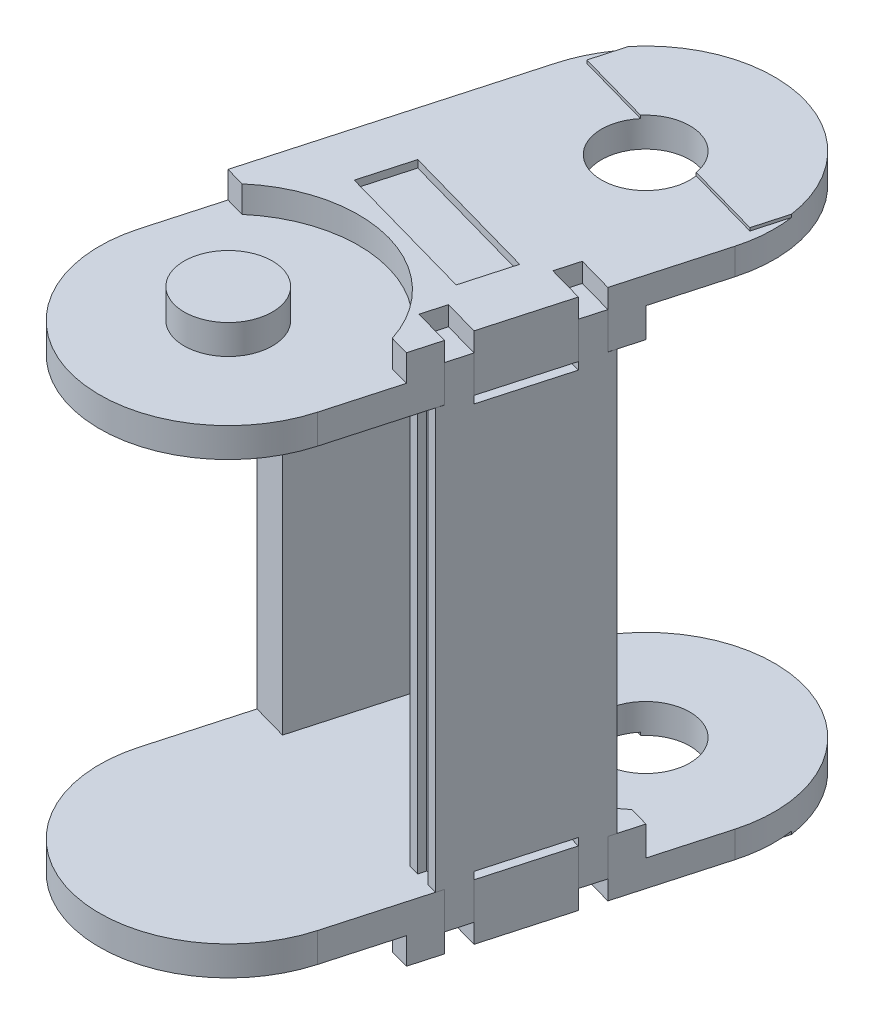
ISO-10303-21;
HEADER;
FILE_DESCRIPTION(('STEP AP214'),'2;1');
FILE_NAME('part.step','',(''),(''),'','','');
FILE_SCHEMA(('AUTOMOTIVE_DESIGN { 1 0 10303 214 1 1 1 1 }'));
ENDSEC;
DATA;
#1=APPLICATION_CONTEXT('core data for automotive mechanical design processes');
#2=APPLICATION_PROTOCOL_DEFINITION('international standard','automotive_design',2000,#1);
#3=PRODUCT_CONTEXT('',#1,'mechanical');
#4=PRODUCT('Part','Part','',(#3));
#5=PRODUCT_RELATED_PRODUCT_CATEGORY('part','',(#4));
#6=PRODUCT_DEFINITION_FORMATION('','',#4);
#7=PRODUCT_DEFINITION_CONTEXT('part definition',#1,'design');
#8=PRODUCT_DEFINITION('design','',#6,#7);
#9=PRODUCT_DEFINITION_SHAPE('','',#8);
#10=(LENGTH_UNIT() NAMED_UNIT(*) SI_UNIT(.MILLI.,.METRE.));
#11=(NAMED_UNIT(*) PLANE_ANGLE_UNIT() SI_UNIT($,.RADIAN.));
#12=(NAMED_UNIT(*) SI_UNIT($,.STERADIAN.) SOLID_ANGLE_UNIT());
#13=UNCERTAINTY_MEASURE_WITH_UNIT(LENGTH_MEASURE(1.E-05),#10,'distance_accuracy_value','');
#14=(GEOMETRIC_REPRESENTATION_CONTEXT(3) GLOBAL_UNCERTAINTY_ASSIGNED_CONTEXT((#13)) GLOBAL_UNIT_ASSIGNED_CONTEXT((#10,
#11,#12)) REPRESENTATION_CONTEXT('',''));
#15=CARTESIAN_POINT('',(0.,0.,0.));
#16=DIRECTION('',(0.,0.,1.));
#17=DIRECTION('',(1.,0.,0.));
#18=AXIS2_PLACEMENT_3D('',#15,#16,#17);
#19=CARTESIAN_POINT('',(-497.992354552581,57.,55.7762997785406));
#20=DIRECTION('',(-0.270270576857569,0.,0.962784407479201));
#21=DIRECTION('',(0.962784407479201,0.,0.270270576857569));
#22=AXIS2_PLACEMENT_3D('',#19,#20,#21);
#23=PLANE('',#22);
#24=DIRECTION('',(0.962784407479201,0.,0.270270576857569));
#25=VECTOR('',#24,1.);
#26=CARTESIAN_POINT('',(-497.992354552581,57.,55.7762997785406));
#27=LINE('',#26,#25);
#28=CARTESIAN_POINT('',(-496.548177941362,57.,56.181705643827));
#29=VERTEX_POINT('',#28);
#30=CARTESIAN_POINT('',(-497.992354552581,57.,55.7762997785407));
#31=VERTEX_POINT('',#30);
#32=EDGE_CURVE('E1071',#29,#31,#27,.F.);
#33=ORIENTED_EDGE('',*,*,#32,.T.);
#34=DIRECTION('',(0.,1.,0.));
#35=VECTOR('',#34,1.);
#36=CARTESIAN_POINT('',(-497.99235455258,57.,55.7762997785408));
#37=LINE('',#36,#35);
#38=CARTESIAN_POINT('',(-497.99235455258,0.,55.7762997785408));
#39=VERTEX_POINT('',#38);
#40=EDGE_CURVE('E798',#39,#31,#37,.T.);
#41=ORIENTED_EDGE('',*,*,#40,.F.);
#42=DIRECTION('',(0.962784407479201,0.,0.270270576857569));
#43=VECTOR('',#42,1.);
#44=CARTESIAN_POINT('',(-497.992354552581,0.,55.7762997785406));
#45=LINE('',#44,#43);
#46=CARTESIAN_POINT('',(-496.548177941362,0.,56.181705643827));
#47=VERTEX_POINT('',#46);
#48=EDGE_CURVE('E1099',#39,#47,#45,.T.);
#49=ORIENTED_EDGE('',*,*,#48,.T.);
#50=DIRECTION('',(0.,1.,0.));
#51=VECTOR('',#50,1.);
#52=CARTESIAN_POINT('',(-496.548177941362,57.,56.181705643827));
#53=LINE('',#52,#51);
#54=EDGE_CURVE('E1166',#29,#47,#53,.F.);
#55=ORIENTED_EDGE('',*,*,#54,.F.);
#56=EDGE_LOOP('',(#33,#41,#49,#55));
#57=FACE_BOUND('',#56,.T.);
#58=ADVANCED_FACE('F16',(#57),#23,.T.);
#59=CARTESIAN_POINT('',(-491.142766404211,57.,36.9260174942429));
#60=DIRECTION('',(0.270270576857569,0.,-0.962784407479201));
#61=DIRECTION('',(-0.962784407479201,0.,-0.270270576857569));
#62=AXIS2_PLACEMENT_3D('',#59,#60,#61);
#63=PLANE('',#62);
#64=DIRECTION('',(-0.962784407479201,0.,-0.270270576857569));
#65=VECTOR('',#64,1.);
#66=CARTESIAN_POINT('',(-491.142766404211,57.,36.9260174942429));
#67=LINE('',#66,#65);
#68=CARTESIAN_POINT('',(-492.586943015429,57.,36.5206116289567));
#69=VERTEX_POINT('',#68);
#70=CARTESIAN_POINT('',(-491.142766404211,57.,36.9260174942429));
#71=VERTEX_POINT('',#70);
#72=EDGE_CURVE('E1070',#69,#71,#67,.F.);
#73=ORIENTED_EDGE('',*,*,#72,.T.);
#74=DIRECTION('',(0.,1.,0.));
#75=VECTOR('',#74,1.);
#76=CARTESIAN_POINT('',(-491.14276640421,57.,36.9260174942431));
#77=LINE('',#76,#75);
#78=CARTESIAN_POINT('',(-491.142766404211,0.,36.926017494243));
#79=VERTEX_POINT('',#78);
#80=EDGE_CURVE('E1178',#79,#71,#77,.T.);
#81=ORIENTED_EDGE('',*,*,#80,.F.);
#82=DIRECTION('',(-0.962784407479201,0.,-0.270270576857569));
#83=VECTOR('',#82,1.);
#84=CARTESIAN_POINT('',(-491.142766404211,0.,36.9260174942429));
#85=LINE('',#84,#83);
#86=CARTESIAN_POINT('',(-492.586943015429,0.,36.5206116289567));
#87=VERTEX_POINT('',#86);
#88=EDGE_CURVE('E1068',#79,#87,#85,.T.);
#89=ORIENTED_EDGE('',*,*,#88,.T.);
#90=DIRECTION('',(0.,1.,0.));
#91=VECTOR('',#90,1.);
#92=CARTESIAN_POINT('',(-492.586943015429,57.,36.5206116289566));
#93=LINE('',#92,#91);
#94=EDGE_CURVE('E834',#69,#87,#93,.F.);
#95=ORIENTED_EDGE('',*,*,#94,.F.);
#96=EDGE_LOOP('',(#73,#81,#89,#95));
#97=FACE_BOUND('',#96,.T.);
#98=ADVANCED_FACE('F2809',(#97),#63,.T.);
#99=CARTESIAN_POINT('',(-487.773020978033,57.,37.8719645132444));
#100=DIRECTION('',(0.270270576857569,0.,-0.962784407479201));
#101=DIRECTION('',(-0.962784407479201,0.,-0.270270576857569));
#102=AXIS2_PLACEMENT_3D('',#99,#100,#101);
#103=PLANE('',#102);
#104=DIRECTION('',(0.962784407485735,0.,0.270270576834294));
#105=VECTOR('',#104,1.);
#106=CARTESIAN_POINT('',(-487.782648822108,57.,37.869261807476));
#107=LINE('',#106,#105);
#108=CARTESIAN_POINT('',(-487.782648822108,57.,37.8692618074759));
#109=VERTEX_POINT('',#108);
#110=CARTESIAN_POINT('',(-487.773020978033,57.,37.8719645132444));
#111=VERTEX_POINT('',#110);
#112=EDGE_CURVE('E737',#109,#111,#107,.T.);
#113=ORIENTED_EDGE('',*,*,#112,.T.);
#114=DIRECTION('',(0.,1.,0.));
#115=VECTOR('',#114,1.);
#116=CARTESIAN_POINT('',(-487.773020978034,57.,37.8719645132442));
#117=LINE('',#116,#115);
#118=CARTESIAN_POINT('',(-487.773020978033,0.,37.8719645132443));
#119=VERTEX_POINT('',#118);
#120=EDGE_CURVE('E680',#119,#111,#117,.T.);
#121=ORIENTED_EDGE('',*,*,#120,.F.);
#122=DIRECTION('',(0.962784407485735,0.,0.270270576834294));
#123=VECTOR('',#122,1.);
#124=CARTESIAN_POINT('',(-487.782648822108,0.,37.869261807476));
#125=LINE('',#124,#123);
#126=CARTESIAN_POINT('',(-487.782648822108,0.,37.869261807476));
#127=VERTEX_POINT('',#126);
#128=EDGE_CURVE('E878',#127,#119,#125,.T.);
#129=ORIENTED_EDGE('',*,*,#128,.F.);
#130=DIRECTION('',(-0.962784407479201,0.,-0.270270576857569));
#131=VECTOR('',#130,1.);
#132=CARTESIAN_POINT('',(-487.773020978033,0.,37.8719645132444));
#133=LINE('',#132,#131);
#134=CARTESIAN_POINT('',(-489.217197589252,0.,37.466558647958));
#135=VERTEX_POINT('',#134);
#136=EDGE_CURVE('E1030',#127,#135,#133,.T.);
#137=ORIENTED_EDGE('',*,*,#136,.T.);
#138=DIRECTION('',(0.,1.,0.));
#139=VECTOR('',#138,1.);
#140=CARTESIAN_POINT('',(-489.217197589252,57.,37.4665586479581));
#141=LINE('',#140,#139);
#142=CARTESIAN_POINT('',(-489.217197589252,57.,37.4665586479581));
#143=VERTEX_POINT('',#142);
#144=EDGE_CURVE('E732',#143,#135,#141,.F.);
#145=ORIENTED_EDGE('',*,*,#144,.F.);
#146=DIRECTION('',(-0.962784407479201,0.,-0.270270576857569));
#147=VECTOR('',#146,1.);
#148=CARTESIAN_POINT('',(-487.773020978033,57.,37.8719645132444));
#149=LINE('',#148,#147);
#150=EDGE_CURVE('E1026',#143,#109,#149,.F.);
#151=ORIENTED_EDGE('',*,*,#150,.T.);
#152=EDGE_LOOP('',(#113,#121,#129,#137,#145,#151));
#153=FACE_BOUND('',#152,.T.);
#154=ADVANCED_FACE('F2800',(#153),#103,.T.);
#155=CARTESIAN_POINT('',(-494.622609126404,57.,56.7222467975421));
#156=DIRECTION('',(-0.270270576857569,0.,0.962784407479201));
#157=DIRECTION('',(0.962784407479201,0.,0.270270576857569));
#158=AXIS2_PLACEMENT_3D('',#155,#156,#157);
#159=PLANE('',#158);
#160=DIRECTION('',(0.962784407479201,0.,0.270270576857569));
#161=VECTOR('',#160,1.);
#162=CARTESIAN_POINT('',(-494.622609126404,57.,56.7222467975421));
#163=LINE('',#162,#161);
#164=CARTESIAN_POINT('',(-493.188060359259,57.,57.1249499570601));
#165=VERTEX_POINT('',#164);
#166=CARTESIAN_POINT('',(-494.622609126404,57.,56.7222467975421));
#167=VERTEX_POINT('',#166);
#168=EDGE_CURVE('E1012',#165,#167,#163,.F.);
#169=ORIENTED_EDGE('',*,*,#168,.T.);
#170=DIRECTION('',(0.,1.,0.));
#171=VECTOR('',#170,1.);
#172=CARTESIAN_POINT('',(-494.622609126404,57.,56.7222467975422));
#173=LINE('',#172,#171);
#174=CARTESIAN_POINT('',(-494.622609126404,0.,56.7222467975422));
#175=VERTEX_POINT('',#174);
#176=EDGE_CURVE('E1155',#175,#167,#173,.T.);
#177=ORIENTED_EDGE('',*,*,#176,.F.);
#178=DIRECTION('',(0.962784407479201,0.,0.270270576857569));
#179=VECTOR('',#178,1.);
#180=CARTESIAN_POINT('',(-494.622609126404,0.,56.7222467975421));
#181=LINE('',#180,#179);
#182=CARTESIAN_POINT('',(-493.188060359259,0.,57.1249499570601));
#183=VERTEX_POINT('',#182);
#184=EDGE_CURVE('E1029',#175,#183,#181,.T.);
#185=ORIENTED_EDGE('',*,*,#184,.T.);
#186=DIRECTION('',(-0.962784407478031,0.,-0.270270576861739));
#187=VECTOR('',#186,1.);
#188=CARTESIAN_POINT('',(-493.178432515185,0.,57.1276526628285));
#189=LINE('',#188,#187);
#190=CARTESIAN_POINT('',(-493.178432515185,0.,57.1276526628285));
#191=VERTEX_POINT('',#190);
#192=EDGE_CURVE('E882',#191,#183,#189,.T.);
#193=ORIENTED_EDGE('',*,*,#192,.F.);
#194=DIRECTION('',(0.,1.,0.));
#195=VECTOR('',#194,1.);
#196=CARTESIAN_POINT('',(-493.178432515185,57.,57.1276526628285));
#197=LINE('',#196,#195);
#198=CARTESIAN_POINT('',(-493.178432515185,57.,57.1276526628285));
#199=VERTEX_POINT('',#198);
#200=EDGE_CURVE('E1045',#199,#191,#197,.F.);
#201=ORIENTED_EDGE('',*,*,#200,.F.);
#202=DIRECTION('',(-0.962784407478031,0.,-0.270270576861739));
#203=VECTOR('',#202,1.);
#204=CARTESIAN_POINT('',(-493.178432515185,57.,57.1276526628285));
#205=LINE('',#204,#203);
#206=EDGE_CURVE('E746',#199,#165,#205,.T.);
#207=ORIENTED_EDGE('',*,*,#206,.T.);
#208=EDGE_LOOP('',(#169,#177,#185,#193,#201,#207));
#209=FACE_BOUND('',#208,.T.);
#210=ADVANCED_FACE('F2791',(#209),#159,.T.);
#211=CARTESIAN_POINT('',(-513.550304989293,-8.,64.9114121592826));
#212=DIRECTION('',(0.,-1.,0.));
#213=DIRECTION('',(0.,0.,-1.));
#214=AXIS2_PLACEMENT_3D('',#211,#212,#213);
#215=PLANE('',#214);
#216=CARTESIAN_POINT('',(-513.550304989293,-8.,64.9114121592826));
#217=DIRECTION('',(0.,1.,0.));
#218=DIRECTION('',(0.,0.,1.));
#219=AXIS2_PLACEMENT_3D('',#216,#217,#218);
#220=CIRCLE('',#219,6.);
#221=CARTESIAN_POINT('',(-513.550304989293,-8.,70.9114121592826));
#222=VERTEX_POINT('',#221);
#223=EDGE_CURVE('E19',#222,#222,#220,.T.);
#224=ORIENTED_EDGE('',*,*,#223,.F.);
#225=EDGE_LOOP('',(#224));
#226=FACE_BOUND('',#225,.T.);
#227=ADVANCED_FACE('F2782',(#226),#215,.T.);
#228=CARTESIAN_POINT('',(-507.33408172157,-6.6,42.767370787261));
#229=DIRECTION('',(0.,1.,0.));
#230=DIRECTION('',(0.,0.,1.));
#231=AXIS2_PLACEMENT_3D('',#228,#229,#230);
#232=PLANE('',#231);
#233=DIRECTION('',(0.270270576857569,0.,-0.962784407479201));
#234=VECTOR('',#233,1.);
#235=CARTESIAN_POINT('',(-516.961925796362,-6.6,40.0646650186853));
#236=LINE('',#235,#234);
#237=CARTESIAN_POINT('',(-516.01597877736,-6.6,36.6949195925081));
#238=VERTEX_POINT('',#237);
#239=CARTESIAN_POINT('',(-517.907872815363,-6.6,43.4344104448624));
#240=VERTEX_POINT('',#239);
#241=EDGE_CURVE('E648',#238,#240,#236,.F.);
#242=ORIENTED_EDGE('',*,*,#241,.F.);
#243=DIRECTION('',(0.962784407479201,0.,0.270270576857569));
#244=VECTOR('',#243,1.);
#245=CARTESIAN_POINT('',(-506.388134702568,-6.6,39.3976253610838));
#246=LINE('',#245,#244);
#247=CARTESIAN_POINT('',(-496.760290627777,-6.6,42.1003311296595));
#248=VERTEX_POINT('',#247);
#249=EDGE_CURVE('E633',#248,#238,#246,.F.);
#250=ORIENTED_EDGE('',*,*,#249,.F.);
#251=DIRECTION('',(-0.270270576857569,0.,0.962784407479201));
#252=VECTOR('',#251,1.);
#253=CARTESIAN_POINT('',(-497.706237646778,-6.6,45.4700765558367));
#254=LINE('',#253,#252);
#255=CARTESIAN_POINT('',(-498.652184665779,-6.6,48.8398219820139));
#256=VERTEX_POINT('',#255);
#257=EDGE_CURVE('E638',#256,#248,#254,.F.);
#258=ORIENTED_EDGE('',*,*,#257,.F.);
#259=DIRECTION('',(-0.962784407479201,0.,-0.270270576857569));
#260=VECTOR('',#259,1.);
#261=CARTESIAN_POINT('',(-508.280028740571,-6.6,46.1371162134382));
#262=LINE('',#261,#260);
#263=EDGE_CURVE('E643',#240,#256,#262,.F.);
#264=ORIENTED_EDGE('',*,*,#263,.F.);
#265=EDGE_LOOP('',(#242,#250,#258,#264));
#266=FACE_BOUND('',#265,.T.);
#267=ADVANCED_FACE('F2773',(#266),#232,.F.);
#268=CARTESIAN_POINT('',(-490.889442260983,-5.,39.7235971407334));
#269=DIRECTION('',(0.,1.,0.));
#270=DIRECTION('',(0.,0.,1.));
#271=AXIS2_PLACEMENT_3D('',#268,#269,#270);
#272=PLANE('',#271);
#273=DIRECTION('',(-0.962784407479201,0.,-0.270270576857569));
#274=VECTOR('',#273,1.);
#275=CARTESIAN_POINT('',(-489.48746816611,-5.00000000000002,38.4293430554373));
#276=LINE('',#275,#274);
#277=CARTESIAN_POINT('',(-488.043291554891,-5.00000000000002,38.8347489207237));
#278=VERTEX_POINT('',#277);
#279=CARTESIAN_POINT('',(-488.052919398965,-5.,38.8320462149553));
#280=VERTEX_POINT('',#279);
#281=EDGE_CURVE('E818',#278,#280,#276,.T.);
#282=ORIENTED_EDGE('',*,*,#281,.F.);
#283=DIRECTION('',(0.270270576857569,0.,-0.962784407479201));
#284=VECTOR('',#283,1.);
#285=CARTESIAN_POINT('',(-493.178432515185,-5.00000000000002,57.1276526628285));
#286=LINE('',#285,#284);
#287=CARTESIAN_POINT('',(-488.921670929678,-5.00000000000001,41.963798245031));
#288=VERTEX_POINT('',#287);
#289=EDGE_CURVE('E1080',#288,#278,#286,.T.);
#290=ORIENTED_EDGE('',*,*,#289,.F.);
#291=DIRECTION('',(0.962784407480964,0.,0.27027057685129));
#292=VECTOR('',#291,1.);
#293=CARTESIAN_POINT('',(-488.931298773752,-5.,41.9610955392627));
#294=LINE('',#293,#292);
#295=CARTESIAN_POINT('',(-488.931298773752,-5.,41.9610955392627));
#296=VERTEX_POINT('',#295);
#297=EDGE_CURVE('E993',#296,#288,#294,.T.);
#298=ORIENTED_EDGE('',*,*,#297,.F.);
#299=DIRECTION('',(-0.962784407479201,0.,-0.270270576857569));
#300=VECTOR('',#299,1.);
#301=CARTESIAN_POINT('',(-491.338259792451,-5.,41.2854190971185));
#302=LINE('',#301,#300);
#303=CARTESIAN_POINT('',(-493.735592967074,-5.00000000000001,40.6124453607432));
#304=VERTEX_POINT('',#303);
#305=EDGE_CURVE('E862',#304,#296,#302,.F.);
#306=ORIENTED_EDGE('',*,*,#305,.F.);
#307=DIRECTION('',(-0.270270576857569,0.,0.962784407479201));
#308=VECTOR('',#307,1.);
#309=CARTESIAN_POINT('',(-492.586943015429,-5.00000000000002,36.5206116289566));
#310=LINE('',#309,#308);
#311=CARTESIAN_POINT('',(-492.857213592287,-5.00000000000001,37.4833960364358));
#312=VERTEX_POINT('',#311);
#313=EDGE_CURVE('E784',#312,#304,#310,.T.);
#314=ORIENTED_EDGE('',*,*,#313,.F.);
#315=DIRECTION('',(0.962784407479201,0.,0.270270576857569));
#316=VECTOR('',#315,1.);
#317=CARTESIAN_POINT('',(-490.459880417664,-5.,38.1563697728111));
#318=LINE('',#317,#316);
#319=EDGE_CURVE('E859',#280,#312,#318,.F.);
#320=ORIENTED_EDGE('',*,*,#319,.F.);
#321=EDGE_LOOP('',(#282,#290,#298,#306,#314,#320));
#322=FACE_BOUND('',#321,.T.);
#323=ADVANCED_FACE('F2764',(#322),#272,.F.);
#324=CARTESIAN_POINT('',(-494.875933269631,-5.,53.9246671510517));
#325=DIRECTION('',(0.,1.,0.));
#326=DIRECTION('',(0.,0.,1.));
#327=AXIS2_PLACEMENT_3D('',#324,#325,#326);
#328=PLANE('',#327);
#329=DIRECTION('',(-0.962784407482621,0.,-0.270270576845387));
#330=VECTOR('',#329,1.);
#331=CARTESIAN_POINT('',(-492.02978256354,-5.,53.0358189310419));
#332=LINE('',#331,#330);
#333=CARTESIAN_POINT('',(-492.02978256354,-5.00000000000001,53.0358189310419));
#334=VERTEX_POINT('',#333);
#335=CARTESIAN_POINT('',(-492.039410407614,-5.,53.0331162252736));
#336=VERTEX_POINT('',#335);
#337=EDGE_CURVE('E967',#334,#336,#332,.T.);
#338=ORIENTED_EDGE('',*,*,#337,.F.);
#339=DIRECTION('',(0.270270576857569,0.,-0.962784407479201));
#340=VECTOR('',#339,1.);
#341=CARTESIAN_POINT('',(-493.178432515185,-5.00000000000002,57.1276526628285));
#342=LINE('',#341,#340);
#343=CARTESIAN_POINT('',(-492.908161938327,-5.00000000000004,56.1648682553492));
#344=VERTEX_POINT('',#343);
#345=EDGE_CURVE('E671',#344,#334,#342,.T.);
#346=ORIENTED_EDGE('',*,*,#345,.F.);
#347=DIRECTION('',(0.962784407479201,0.,0.270270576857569));
#348=VECTOR('',#347,1.);
#349=CARTESIAN_POINT('',(-496.277907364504,-5.00000000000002,55.2189212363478));
#350=LINE('',#349,#348);
#351=CARTESIAN_POINT('',(-492.917789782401,-5.00000000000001,56.162165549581));
#352=VERTEX_POINT('',#351);
#353=EDGE_CURVE('E957',#352,#344,#350,.T.);
#354=ORIENTED_EDGE('',*,*,#353,.F.);
#355=DIRECTION('',(-0.962784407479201,0.,-0.270270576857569));
#356=VECTOR('',#355,1.);
#357=CARTESIAN_POINT('',(-495.3247508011,-5.,55.4864891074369));
#358=LINE('',#357,#356);
#359=CARTESIAN_POINT('',(-497.722083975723,-5.00000000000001,54.8135153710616));
#360=VERTEX_POINT('',#359);
#361=EDGE_CURVE('E938',#360,#352,#358,.F.);
#362=ORIENTED_EDGE('',*,*,#361,.F.);
#363=DIRECTION('',(-0.270270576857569,0.,0.962784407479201));
#364=VECTOR('',#363,1.);
#365=CARTESIAN_POINT('',(-492.586943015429,-5.00000000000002,36.5206116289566));
#366=LINE('',#365,#364);
#367=CARTESIAN_POINT('',(-496.843704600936,-5.00000000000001,51.6844660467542));
#368=VERTEX_POINT('',#367);
#369=EDGE_CURVE('E793',#368,#360,#366,.T.);
#370=ORIENTED_EDGE('',*,*,#369,.F.);
#371=DIRECTION('',(0.962784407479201,0.,0.270270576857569));
#372=VECTOR('',#371,1.);
#373=CARTESIAN_POINT('',(-494.446371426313,-5.,52.3574397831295));
#374=LINE('',#373,#372);
#375=EDGE_CURVE('E912',#336,#368,#374,.F.);
#376=ORIENTED_EDGE('',*,*,#375,.F.);
#377=EDGE_LOOP('',(#338,#346,#354,#362,#370,#376));
#378=FACE_BOUND('',#377,.T.);
#379=ADVANCED_FACE('F2755',(#378),#328,.F.);
#380=CARTESIAN_POINT('',(-496.277907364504,57.,55.2189212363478));
#381=DIRECTION('',(-0.270270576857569,0.,0.962784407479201));
#382=DIRECTION('',(0.962784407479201,0.,0.270270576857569));
#383=AXIS2_PLACEMENT_3D('',#380,#381,#382);
#384=PLANE('',#383);
#385=DIRECTION('',(0.,1.,0.));
#386=VECTOR('',#385,1.);
#387=CARTESIAN_POINT('',(-492.908161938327,57.,56.1648682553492));
#388=LINE('',#387,#386);
#389=CARTESIAN_POINT('',(-492.908161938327,0.,56.1648682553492));
#390=VERTEX_POINT('',#389);
#391=EDGE_CURVE('E1134',#390,#344,#388,.F.);
#392=ORIENTED_EDGE('',*,*,#391,.F.);
#393=DIRECTION('',(0.962784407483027,0.,0.270270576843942));
#394=VECTOR('',#393,1.);
#395=CARTESIAN_POINT('',(-492.917789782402,0.,56.1621655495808));
#396=LINE('',#395,#394);
#397=CARTESIAN_POINT('',(-492.917789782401,0.,56.1621655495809));
#398=VERTEX_POINT('',#397);
#399=EDGE_CURVE('E953',#398,#390,#396,.T.);
#400=ORIENTED_EDGE('',*,*,#399,.F.);
#401=DIRECTION('',(0.,1.,0.));
#402=VECTOR('',#401,1.);
#403=CARTESIAN_POINT('',(-492.917789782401,-8.,56.1621655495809));
#404=LINE('',#403,#402);
#405=EDGE_CURVE('E960',#352,#398,#404,.T.);
#406=ORIENTED_EDGE('',*,*,#405,.F.);
#407=ORIENTED_EDGE('',*,*,#353,.T.);
#408=EDGE_LOOP('',(#392,#400,#406,#407));
#409=FACE_BOUND('',#408,.T.);
#410=ADVANCED_FACE('F2746',(#409),#384,.T.);
#411=CARTESIAN_POINT('',(-492.882687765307,0.,46.8241321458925));
#412=DIRECTION('',(0.,-1.,0.));
#413=DIRECTION('',(0.,0.,-1.));
#414=AXIS2_PLACEMENT_3D('',#411,#412,#413);
#415=PLANE('',#414);
#416=DIRECTION('',(0.270270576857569,0.,-0.962784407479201));
#417=VECTOR('',#416,1.);
#418=CARTESIAN_POINT('',(-493.178432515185,0.,57.1276526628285));
#419=LINE('',#418,#417);
#420=EDGE_CURVE('E1050',#191,#390,#419,.T.);
#421=ORIENTED_EDGE('',*,*,#420,.F.);
#422=ORIENTED_EDGE('',*,*,#192,.T.);
#423=DIRECTION('',(0.270270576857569,0.,-0.962784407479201));
#424=VECTOR('',#423,1.);
#425=CARTESIAN_POINT('',(-484.269131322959,0.,25.3530645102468));
#426=LINE('',#425,#424);
#427=EDGE_CURVE('E962',#398,#183,#426,.F.);
#428=ORIENTED_EDGE('',*,*,#427,.F.);
#429=ORIENTED_EDGE('',*,*,#399,.T.);
#430=EDGE_LOOP('',(#421,#422,#428,#429));
#431=FACE_BOUND('',#430,.T.);
#432=ADVANCED_FACE('F2737',(#431),#415,.T.);
#433=CARTESIAN_POINT('',(-492.882687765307,1.,46.8241321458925));
#434=DIRECTION('',(0.,-1.,0.));
#435=DIRECTION('',(0.,0.,-1.));
#436=AXIS2_PLACEMENT_3D('',#433,#434,#435);
#437=PLANE('',#436);
#438=DIRECTION('',(-0.962784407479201,0.,-0.270270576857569));
#439=VECTOR('',#438,1.);
#440=CARTESIAN_POINT('',(-491.328631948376,1.,41.2881218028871));
#441=LINE('',#440,#439);
#442=CARTESIAN_POINT('',(-493.735592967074,0.999999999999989,40.6124453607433));
#443=VERTEX_POINT('',#442);
#444=CARTESIAN_POINT('',(-488.921670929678,0.999999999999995,41.9637982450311));
#445=VERTEX_POINT('',#444);
#446=EDGE_CURVE('E1003',#443,#445,#441,.F.);
#447=ORIENTED_EDGE('',*,*,#446,.T.);
#448=DIRECTION('',(0.270270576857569,0.,-0.962784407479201));
#449=VECTOR('',#448,1.);
#450=CARTESIAN_POINT('',(-493.178432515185,0.999999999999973,57.1276526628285));
#451=LINE('',#450,#449);
#452=CARTESIAN_POINT('',(-492.02978256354,0.999999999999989,53.0358189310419));
#453=VERTEX_POINT('',#452);
#454=EDGE_CURVE('E669',#453,#445,#451,.T.);
#455=ORIENTED_EDGE('',*,*,#454,.F.);
#456=DIRECTION('',(0.962784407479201,0.,0.270270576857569));
#457=VECTOR('',#456,1.);
#458=CARTESIAN_POINT('',(-494.436743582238,1.,52.360142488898));
#459=LINE('',#458,#457);
#460=CARTESIAN_POINT('',(-496.843704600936,0.99999999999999,51.684466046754));
#461=VERTEX_POINT('',#460);
#462=EDGE_CURVE('E986',#453,#461,#459,.F.);
#463=ORIENTED_EDGE('',*,*,#462,.T.);
#464=DIRECTION('',(-0.270270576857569,0.,0.962784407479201));
#465=VECTOR('',#464,1.);
#466=CARTESIAN_POINT('',(-492.586943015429,0.999999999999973,36.5206116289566));
#467=LINE('',#466,#465);
#468=EDGE_CURVE('E791',#443,#461,#467,.T.);
#469=ORIENTED_EDGE('',*,*,#468,.F.);
#470=EDGE_LOOP('',(#447,#455,#463,#469));
#471=FACE_BOUND('',#470,.T.);
#472=ADVANCED_FACE('F2728',(#471),#437,.T.);
#473=CARTESIAN_POINT('',(-492.882687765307,0.,46.8241321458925));
#474=DIRECTION('',(0.,-1.,0.));
#475=DIRECTION('',(0.,0.,-1.));
#476=AXIS2_PLACEMENT_3D('',#473,#474,#475);
#477=PLANE('',#476);
#478=DIRECTION('',(0.270270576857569,0.,-0.962784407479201));
#479=VECTOR('',#478,1.);
#480=CARTESIAN_POINT('',(-493.178432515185,0.,57.1276526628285));
#481=LINE('',#480,#479);
#482=CARTESIAN_POINT('',(-488.043291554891,0.,38.8347489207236));
#483=VERTEX_POINT('',#482);
#484=EDGE_CURVE('E1116',#483,#119,#481,.T.);
#485=ORIENTED_EDGE('',*,*,#484,.F.);
#486=DIRECTION('',(-0.962784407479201,0.,-0.270270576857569));
#487=VECTOR('',#486,1.);
#488=CARTESIAN_POINT('',(-489.48746816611,0.,38.4293430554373));
#489=LINE('',#488,#487);
#490=CARTESIAN_POINT('',(-488.052919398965,0.,38.8320462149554));
#491=VERTEX_POINT('',#490);
#492=EDGE_CURVE('E874',#491,#483,#489,.F.);
#493=ORIENTED_EDGE('',*,*,#492,.F.);
#494=DIRECTION('',(0.270270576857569,0.,-0.962784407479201));
#495=VECTOR('',#494,1.);
#496=CARTESIAN_POINT('',(-484.269131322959,0.,25.3530645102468));
#497=LINE('',#496,#495);
#498=EDGE_CURVE('E870',#127,#491,#497,.F.);
#499=ORIENTED_EDGE('',*,*,#498,.F.);
#500=ORIENTED_EDGE('',*,*,#128,.T.);
#501=EDGE_LOOP('',(#485,#493,#499,#500));
#502=FACE_BOUND('',#501,.T.);
#503=ADVANCED_FACE('F2719',(#502),#477,.T.);
#504=CARTESIAN_POINT('',(-489.48746816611,57.,38.4293430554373));
#505=DIRECTION('',(0.270270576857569,0.,-0.962784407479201));
#506=DIRECTION('',(-0.962784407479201,0.,-0.270270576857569));
#507=AXIS2_PLACEMENT_3D('',#504,#505,#506);
#508=PLANE('',#507);
#509=DIRECTION('',(0.,1.,0.));
#510=VECTOR('',#509,1.);
#511=CARTESIAN_POINT('',(-488.043291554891,57.,38.8347489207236));
#512=LINE('',#511,#510);
#513=EDGE_CURVE('E1111',#278,#483,#512,.T.);
#514=ORIENTED_EDGE('',*,*,#513,.F.);
#515=ORIENTED_EDGE('',*,*,#281,.T.);
#516=DIRECTION('',(0.,1.,0.));
#517=VECTOR('',#516,1.);
#518=CARTESIAN_POINT('',(-488.052919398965,-8.,38.8320462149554));
#519=LINE('',#518,#517);
#520=EDGE_CURVE('E866',#491,#280,#519,.F.);
#521=ORIENTED_EDGE('',*,*,#520,.F.);
#522=ORIENTED_EDGE('',*,*,#492,.T.);
#523=EDGE_LOOP('',(#514,#515,#521,#522));
#524=FACE_BOUND('',#523,.T.);
#525=ADVANCED_FACE('F2710',(#524),#508,.T.);
#526=CARTESIAN_POINT('',(-507.33408172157,63.6,42.7673707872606));
#527=DIRECTION('',(0.,-1.,0.));
#528=DIRECTION('',(0.,0.,-1.));
#529=AXIS2_PLACEMENT_3D('',#526,#527,#528);
#530=PLANE('',#529);
#531=DIRECTION('',(-0.270270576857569,0.,0.962784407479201));
#532=VECTOR('',#531,1.);
#533=CARTESIAN_POINT('',(-497.706237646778,63.6,45.4700765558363));
#534=LINE('',#533,#532);
#535=CARTESIAN_POINT('',(-496.760290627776,63.6,42.1003311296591));
#536=VERTEX_POINT('',#535);
#537=CARTESIAN_POINT('',(-498.652184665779,63.6,48.8398219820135));
#538=VERTEX_POINT('',#537);
#539=EDGE_CURVE('E1326',#536,#538,#534,.T.);
#540=ORIENTED_EDGE('',*,*,#539,.F.);
#541=DIRECTION('',(0.962784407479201,0.,0.270270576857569));
#542=VECTOR('',#541,1.);
#543=CARTESIAN_POINT('',(-506.388134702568,63.6,39.3976253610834));
#544=LINE('',#543,#542);
#545=CARTESIAN_POINT('',(-516.01597877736,63.6,36.6949195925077));
#546=VERTEX_POINT('',#545);
#547=EDGE_CURVE('E1341',#546,#536,#544,.T.);
#548=ORIENTED_EDGE('',*,*,#547,.F.);
#549=DIRECTION('',(0.270270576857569,0.,-0.962784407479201));
#550=VECTOR('',#549,1.);
#551=CARTESIAN_POINT('',(-516.961925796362,63.6,40.0646650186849));
#552=LINE('',#551,#550);
#553=CARTESIAN_POINT('',(-517.907872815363,63.6,43.4344104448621));
#554=VERTEX_POINT('',#553);
#555=EDGE_CURVE('E1339',#554,#546,#552,.T.);
#556=ORIENTED_EDGE('',*,*,#555,.F.);
#557=DIRECTION('',(-0.962784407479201,0.,-0.270270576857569));
#558=VECTOR('',#557,1.);
#559=CARTESIAN_POINT('',(-508.280028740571,63.6,46.1371162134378));
#560=LINE('',#559,#558);
#561=EDGE_CURVE('E1334',#538,#554,#560,.T.);
#562=ORIENTED_EDGE('',*,*,#561,.F.);
#563=EDGE_LOOP('',(#540,#548,#556,#562));
#564=FACE_BOUND('',#563,.T.);
#565=ADVANCED_FACE('F2701',(#564),#530,.F.);
#566=CARTESIAN_POINT('',(-490.889442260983,62.,39.7235971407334));
#567=DIRECTION('',(0.,-1.,0.));
#568=DIRECTION('',(0.,0.,-1.));
#569=AXIS2_PLACEMENT_3D('',#566,#567,#568);
#570=PLANE('',#569);
#571=DIRECTION('',(-0.962784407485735,0.,-0.270270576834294));
#572=VECTOR('',#571,1.);
#573=CARTESIAN_POINT('',(-488.921670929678,62.,41.963798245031));
#574=LINE('',#573,#572);
#575=CARTESIAN_POINT('',(-488.921670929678,62.,41.963798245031));
#576=VERTEX_POINT('',#575);
#577=CARTESIAN_POINT('',(-488.931298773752,62.,41.9610955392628));
#578=VERTEX_POINT('',#577);
#579=EDGE_CURVE('E794',#576,#578,#574,.T.);
#580=ORIENTED_EDGE('',*,*,#579,.F.);
#581=DIRECTION('',(0.270270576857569,0.,-0.962784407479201));
#582=VECTOR('',#581,1.);
#583=CARTESIAN_POINT('',(-493.178432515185,62.,57.1276526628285));
#584=LINE('',#583,#582);
#585=CARTESIAN_POINT('',(-488.043291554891,62.,38.8347489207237));
#586=VERTEX_POINT('',#585);
#587=EDGE_CURVE('E675',#586,#576,#584,.F.);
#588=ORIENTED_EDGE('',*,*,#587,.F.);
#589=DIRECTION('',(-0.962784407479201,0.,-0.270270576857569));
#590=VECTOR('',#589,1.);
#591=CARTESIAN_POINT('',(-489.48746816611,62.,38.4293430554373));
#592=LINE('',#591,#590);
#593=CARTESIAN_POINT('',(-488.052919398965,62.,38.8320462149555));
#594=VERTEX_POINT('',#593);
#595=EDGE_CURVE('E740',#594,#586,#592,.F.);
#596=ORIENTED_EDGE('',*,*,#595,.F.);
#597=DIRECTION('',(0.962784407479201,0.,0.270270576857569));
#598=VECTOR('',#597,1.);
#599=CARTESIAN_POINT('',(-490.459880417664,62.,38.1563697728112));
#600=LINE('',#599,#598);
#601=CARTESIAN_POINT('',(-492.857213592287,62.,37.4833960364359));
#602=VERTEX_POINT('',#601);
#603=EDGE_CURVE('E718',#602,#594,#600,.T.);
#604=ORIENTED_EDGE('',*,*,#603,.F.);
#605=DIRECTION('',(-0.270270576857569,0.,0.962784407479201));
#606=VECTOR('',#605,1.);
#607=CARTESIAN_POINT('',(-492.586943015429,62.,36.5206116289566));
#608=LINE('',#607,#606);
#609=CARTESIAN_POINT('',(-493.735592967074,62.,40.6124453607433));
#610=VERTEX_POINT('',#609);
#611=EDGE_CURVE('E825',#610,#602,#608,.F.);
#612=ORIENTED_EDGE('',*,*,#611,.F.);
#613=DIRECTION('',(-0.962784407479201,0.,-0.270270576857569));
#614=VECTOR('',#613,1.);
#615=CARTESIAN_POINT('',(-491.338259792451,62.,41.2854190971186));
#616=LINE('',#615,#614);
#617=EDGE_CURVE('E681',#578,#610,#616,.T.);
#618=ORIENTED_EDGE('',*,*,#617,.F.);
#619=EDGE_LOOP('',(#580,#588,#596,#604,#612,#618));
#620=FACE_BOUND('',#619,.T.);
#621=ADVANCED_FACE('F2692',(#620),#570,.F.);
#622=CARTESIAN_POINT('',(-492.586943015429,57.,36.5206116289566));
#623=DIRECTION('',(-0.962784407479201,0.,-0.270270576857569));
#624=DIRECTION('',(-0.270270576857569,0.,0.962784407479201));
#625=AXIS2_PLACEMENT_3D('',#622,#623,#624);
#626=PLANE('',#625);
#627=DIRECTION('',(0.,1.,0.));
#628=VECTOR('',#627,1.);
#629=CARTESIAN_POINT('',(-492.857213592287,-4.,37.4833960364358));
#630=LINE('',#629,#628);
#631=CARTESIAN_POINT('',(-492.857213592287,0.,37.4833960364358));
#632=VERTEX_POINT('',#631);
#633=EDGE_CURVE('E898',#312,#632,#630,.T.);
#634=ORIENTED_EDGE('',*,*,#633,.F.);
#635=ORIENTED_EDGE('',*,*,#313,.T.);
#636=DIRECTION('',(0.,1.,0.));
#637=VECTOR('',#636,1.);
#638=CARTESIAN_POINT('',(-493.735592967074,-4.,40.6124453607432));
#639=LINE('',#638,#637);
#640=CARTESIAN_POINT('',(-493.735592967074,0.,40.6124453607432));
#641=VERTEX_POINT('',#640);
#642=EDGE_CURVE('E887',#641,#304,#639,.F.);
#643=ORIENTED_EDGE('',*,*,#642,.F.);
#644=DIRECTION('',(0.,1.,0.));
#645=VECTOR('',#644,1.);
#646=CARTESIAN_POINT('',(-493.735592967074,-2.5,40.6124453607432));
#647=LINE('',#646,#645);
#648=EDGE_CURVE('E1000',#641,#443,#647,.T.);
#649=ORIENTED_EDGE('',*,*,#648,.T.);
#650=ORIENTED_EDGE('',*,*,#468,.T.);
#651=DIRECTION('',(0.,1.,0.));
#652=VECTOR('',#651,1.);
#653=CARTESIAN_POINT('',(-496.843704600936,-2.5,51.6844660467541));
#654=LINE('',#653,#652);
#655=CARTESIAN_POINT('',(-496.843704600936,0.,51.6844660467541));
#656=VERTEX_POINT('',#655);
#657=EDGE_CURVE('E921',#461,#656,#654,.F.);
#658=ORIENTED_EDGE('',*,*,#657,.T.);
#659=DIRECTION('',(0.,1.,0.));
#660=VECTOR('',#659,1.);
#661=CARTESIAN_POINT('',(-496.843704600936,-4.,51.6844660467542));
#662=LINE('',#661,#660);
#663=EDGE_CURVE('E914',#368,#656,#662,.T.);
#664=ORIENTED_EDGE('',*,*,#663,.F.);
#665=ORIENTED_EDGE('',*,*,#369,.T.);
#666=DIRECTION('',(0.,1.,0.));
#667=VECTOR('',#666,1.);
#668=CARTESIAN_POINT('',(-497.722083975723,-4.,54.8135153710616));
#669=LINE('',#668,#667);
#670=CARTESIAN_POINT('',(-497.722083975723,0.,54.8135153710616));
#671=VERTEX_POINT('',#670);
#672=EDGE_CURVE('E948',#671,#360,#669,.F.);
#673=ORIENTED_EDGE('',*,*,#672,.F.);
#674=DIRECTION('',(-0.270270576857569,0.,0.962784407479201));
#675=VECTOR('',#674,1.);
#676=CARTESIAN_POINT('',(-492.586943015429,0.,36.5206116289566));
#677=LINE('',#676,#675);
#678=EDGE_CURVE('E977',#671,#39,#677,.T.);
#679=ORIENTED_EDGE('',*,*,#678,.T.);
#680=ORIENTED_EDGE('',*,*,#40,.T.);
#681=DIRECTION('',(-0.270270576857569,0.,0.962784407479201));
#682=VECTOR('',#681,1.);
#683=CARTESIAN_POINT('',(-492.586943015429,57.,36.5206116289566));
#684=LINE('',#683,#682);
#685=CARTESIAN_POINT('',(-497.722083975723,57.,54.8135153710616));
#686=VERTEX_POINT('',#685);
#687=EDGE_CURVE('E795',#31,#686,#684,.F.);
#688=ORIENTED_EDGE('',*,*,#687,.T.);
#689=DIRECTION('',(0.,1.,0.));
#690=VECTOR('',#689,1.);
#691=CARTESIAN_POINT('',(-497.722083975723,61.,54.8135153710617));
#692=LINE('',#691,#690);
#693=CARTESIAN_POINT('',(-497.722083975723,62.,54.8135153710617));
#694=VERTEX_POINT('',#693);
#695=EDGE_CURVE('E666',#694,#686,#692,.F.);
#696=ORIENTED_EDGE('',*,*,#695,.F.);
#697=DIRECTION('',(0.270270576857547,0.,-0.962784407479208));
#698=VECTOR('',#697,1.);
#699=CARTESIAN_POINT('',(-497.722083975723,62.,54.8135153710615));
#700=LINE('',#699,#698);
#701=CARTESIAN_POINT('',(-496.843704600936,62.,51.6844660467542));
#702=VERTEX_POINT('',#701);
#703=EDGE_CURVE('E781',#694,#702,#700,.T.);
#704=ORIENTED_EDGE('',*,*,#703,.T.);
#705=DIRECTION('',(0.,1.,0.));
#706=VECTOR('',#705,1.);
#707=CARTESIAN_POINT('',(-496.843704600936,61.,51.6844660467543));
#708=LINE('',#707,#706);
#709=CARTESIAN_POINT('',(-496.843704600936,57.,51.6844660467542));
#710=VERTEX_POINT('',#709);
#711=EDGE_CURVE('E652',#710,#702,#708,.T.);
#712=ORIENTED_EDGE('',*,*,#711,.F.);
#713=DIRECTION('',(0.,1.,0.));
#714=VECTOR('',#713,1.);
#715=CARTESIAN_POINT('',(-496.843704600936,57.,51.6844660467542));
#716=LINE('',#715,#714);
#717=CARTESIAN_POINT('',(-496.843704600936,56.,51.6844660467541));
#718=VERTEX_POINT('',#717);
#719=EDGE_CURVE('E797',#710,#718,#716,.F.);
#720=ORIENTED_EDGE('',*,*,#719,.T.);
#721=DIRECTION('',(0.270270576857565,0.,-0.962784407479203));
#722=VECTOR('',#721,1.);
#723=CARTESIAN_POINT('',(-496.843704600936,56.,51.684466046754));
#724=LINE('',#723,#722);
#725=CARTESIAN_POINT('',(-493.735592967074,56.,40.6124453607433));
#726=VERTEX_POINT('',#725);
#727=EDGE_CURVE('E1077',#718,#726,#724,.T.);
#728=ORIENTED_EDGE('',*,*,#727,.T.);
#729=DIRECTION('',(0.,1.,0.));
#730=VECTOR('',#729,1.);
#731=CARTESIAN_POINT('',(-493.735592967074,57.,40.6124453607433));
#732=LINE('',#731,#730);
#733=CARTESIAN_POINT('',(-493.735592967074,57.,40.6124453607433));
#734=VERTEX_POINT('',#733);
#735=EDGE_CURVE('E806',#726,#734,#732,.T.);
#736=ORIENTED_EDGE('',*,*,#735,.T.);
#737=DIRECTION('',(0.,1.,0.));
#738=VECTOR('',#737,1.);
#739=CARTESIAN_POINT('',(-493.735592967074,61.,40.6124453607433));
#740=LINE('',#739,#738);
#741=EDGE_CURVE('E727',#610,#734,#740,.F.);
#742=ORIENTED_EDGE('',*,*,#741,.F.);
#743=ORIENTED_EDGE('',*,*,#611,.T.);
#744=DIRECTION('',(0.,1.,0.));
#745=VECTOR('',#744,1.);
#746=CARTESIAN_POINT('',(-492.857213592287,61.,37.4833960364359));
#747=LINE('',#746,#745);
#748=CARTESIAN_POINT('',(-492.857213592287,57.,37.4833960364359));
#749=VERTEX_POINT('',#748);
#750=EDGE_CURVE('E717',#749,#602,#747,.T.);
#751=ORIENTED_EDGE('',*,*,#750,.F.);
#752=DIRECTION('',(-0.270270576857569,0.,0.962784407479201));
#753=VECTOR('',#752,1.);
#754=CARTESIAN_POINT('',(-492.586943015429,57.,36.5206116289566));
#755=LINE('',#754,#753);
#756=EDGE_CURVE('E827',#749,#69,#755,.F.);
#757=ORIENTED_EDGE('',*,*,#756,.T.);
#758=ORIENTED_EDGE('',*,*,#94,.T.);
#759=DIRECTION('',(-0.270270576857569,0.,0.962784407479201));
#760=VECTOR('',#759,1.);
#761=CARTESIAN_POINT('',(-492.586943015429,0.,36.5206116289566));
#762=LINE('',#761,#760);
#763=EDGE_CURVE('E1016',#87,#632,#762,.T.);
#764=ORIENTED_EDGE('',*,*,#763,.T.);
#765=EDGE_LOOP('',(#634,#635,#643,#649,#650,#658,#664,#665,#673,#679,#680,#688,#696,#704,#712,
#720,#728,#736,#742,#743,#751,#757,#758,#764));
#766=FACE_BOUND('',#765,.T.);
#767=ADVANCED_FACE('F2683',(#766),#626,.T.);
#768=CARTESIAN_POINT('',(-494.875933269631,62.,53.9246671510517));
#769=DIRECTION('',(0.,-1.,0.));
#770=DIRECTION('',(0.,0.,-1.));
#771=AXIS2_PLACEMENT_3D('',#768,#769,#770);
#772=PLANE('',#771);
#773=DIRECTION('',(0.962784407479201,0.,0.270270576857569));
#774=VECTOR('',#773,1.);
#775=CARTESIAN_POINT('',(-496.277907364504,62.,55.2189212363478));
#776=LINE('',#775,#774);
#777=CARTESIAN_POINT('',(-492.908161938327,62.,56.1648682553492));
#778=VERTEX_POINT('',#777);
#779=CARTESIAN_POINT('',(-492.917789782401,62.,56.162165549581));
#780=VERTEX_POINT('',#779);
#781=EDGE_CURVE('E762',#778,#780,#776,.F.);
#782=ORIENTED_EDGE('',*,*,#781,.F.);
#783=DIRECTION('',(0.270270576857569,0.,-0.962784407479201));
#784=VECTOR('',#783,1.);
#785=CARTESIAN_POINT('',(-493.178432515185,62.,57.1276526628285));
#786=LINE('',#785,#784);
#787=CARTESIAN_POINT('',(-492.02978256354,62.,53.0358189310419));
#788=VERTEX_POINT('',#787);
#789=EDGE_CURVE('E674',#788,#778,#786,.F.);
#790=ORIENTED_EDGE('',*,*,#789,.F.);
#791=DIRECTION('',(0.962784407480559,0.,0.270270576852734));
#792=VECTOR('',#791,1.);
#793=CARTESIAN_POINT('',(-492.039410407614,62.,53.0331162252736));
#794=LINE('',#793,#792);
#795=CARTESIAN_POINT('',(-492.039410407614,62.,53.0331162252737));
#796=VERTEX_POINT('',#795);
#797=EDGE_CURVE('E783',#796,#788,#794,.T.);
#798=ORIENTED_EDGE('',*,*,#797,.F.);
#799=DIRECTION('',(0.962784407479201,0.,0.270270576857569));
#800=VECTOR('',#799,1.);
#801=CARTESIAN_POINT('',(-494.446371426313,62.,52.3574397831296));
#802=LINE('',#801,#800);
#803=EDGE_CURVE('E653',#702,#796,#802,.T.);
#804=ORIENTED_EDGE('',*,*,#803,.F.);
#805=ORIENTED_EDGE('',*,*,#703,.F.);
#806=DIRECTION('',(-0.962784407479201,0.,-0.270270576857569));
#807=VECTOR('',#806,1.);
#808=CARTESIAN_POINT('',(-495.3247508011,62.,55.486489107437));
#809=LINE('',#808,#807);
#810=EDGE_CURVE('E665',#780,#694,#809,.T.);
#811=ORIENTED_EDGE('',*,*,#810,.F.);
#812=EDGE_LOOP('',(#782,#790,#798,#804,#805,#811));
#813=FACE_BOUND('',#812,.T.);
#814=ADVANCED_FACE('F2674',(#813),#772,.F.);
#815=CARTESIAN_POINT('',(-513.550304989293,65.,64.9114121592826));
#816=DIRECTION('',(0.,1.,0.));
#817=DIRECTION('',(0.,0.,1.));
#818=AXIS2_PLACEMENT_3D('',#815,#816,#817);
#819=PLANE('',#818);
#820=CARTESIAN_POINT('',(-513.550304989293,65.,64.9114121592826));
#821=DIRECTION('',(0.,-1.,0.));
#822=DIRECTION('',(0.,0.,-1.));
#823=AXIS2_PLACEMENT_3D('',#820,#821,#822);
#824=CIRCLE('',#823,6.);
#825=CARTESIAN_POINT('',(-513.550304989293,65.,58.9114121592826));
#826=VERTEX_POINT('',#825);
#827=EDGE_CURVE('E774',#826,#826,#824,.T.);
#828=ORIENTED_EDGE('',*,*,#827,.F.);
#829=EDGE_LOOP('',(#828));
#830=FACE_BOUND('',#829,.T.);
#831=ADVANCED_FACE('F2665',(#830),#819,.T.);
#832=CARTESIAN_POINT('',(-496.548177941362,57.,56.181705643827));
#833=DIRECTION('',(0.962784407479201,0.,0.270270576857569));
#834=DIRECTION('',(0.270270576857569,0.,-0.962784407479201));
#835=AXIS2_PLACEMENT_3D('',#832,#833,#834);
#836=PLANE('',#835);
#837=DIRECTION('',(0.270270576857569,0.,-0.962784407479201));
#838=VECTOR('',#837,1.);
#839=CARTESIAN_POINT('',(-496.548177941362,57.,56.181705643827));
#840=LINE('',#839,#838);
#841=CARTESIAN_POINT('',(-496.277907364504,57.,55.2189212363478));
#842=VERTEX_POINT('',#841);
#843=EDGE_CURVE('E1190',#842,#29,#840,.F.);
#844=ORIENTED_EDGE('',*,*,#843,.T.);
#845=ORIENTED_EDGE('',*,*,#54,.T.);
#846=DIRECTION('',(0.270270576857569,0.,-0.962784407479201));
#847=VECTOR('',#846,1.);
#848=CARTESIAN_POINT('',(-496.548177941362,0.,56.181705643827));
#849=LINE('',#848,#847);
#850=CARTESIAN_POINT('',(-496.277907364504,0.,55.2189212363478));
#851=VERTEX_POINT('',#850);
#852=EDGE_CURVE('E814',#47,#851,#849,.T.);
#853=ORIENTED_EDGE('',*,*,#852,.T.);
#854=DIRECTION('',(0.,1.,0.));
#855=VECTOR('',#854,1.);
#856=CARTESIAN_POINT('',(-496.277907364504,57.,55.2189212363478));
#857=LINE('',#856,#855);
#858=EDGE_CURVE('E1586',#842,#851,#857,.F.);
#859=ORIENTED_EDGE('',*,*,#858,.F.);
#860=EDGE_LOOP('',(#844,#845,#853,#859));
#861=FACE_BOUND('',#860,.T.);
#862=ADVANCED_FACE('F2656',(#861),#836,.T.);
#863=CARTESIAN_POINT('',(-494.352338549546,57.,55.7594623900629));
#864=DIRECTION('',(-0.962784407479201,0.,-0.270270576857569));
#865=DIRECTION('',(-0.270270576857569,0.,0.962784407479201));
#866=AXIS2_PLACEMENT_3D('',#863,#864,#865);
#867=PLANE('',#866);
#868=DIRECTION('',(-0.270270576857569,0.,0.962784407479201));
#869=VECTOR('',#868,1.);
#870=CARTESIAN_POINT('',(-494.352338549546,57.,55.7594623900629));
#871=LINE('',#870,#869);
#872=CARTESIAN_POINT('',(-494.352338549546,57.,55.7594623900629));
#873=VERTEX_POINT('',#872);
#874=EDGE_CURVE('E778',#167,#873,#871,.F.);
#875=ORIENTED_EDGE('',*,*,#874,.T.);
#876=DIRECTION('',(0.,1.,0.));
#877=VECTOR('',#876,1.);
#878=CARTESIAN_POINT('',(-494.352338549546,57.,55.7594623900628));
#879=LINE('',#878,#877);
#880=CARTESIAN_POINT('',(-494.352338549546,0.,55.7594623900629));
#881=VERTEX_POINT('',#880);
#882=EDGE_CURVE('E769',#881,#873,#879,.T.);
#883=ORIENTED_EDGE('',*,*,#882,.F.);
#884=DIRECTION('',(-0.270270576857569,0.,0.962784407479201));
#885=VECTOR('',#884,1.);
#886=CARTESIAN_POINT('',(-494.352338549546,0.,55.7594623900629));
#887=LINE('',#886,#885);
#888=EDGE_CURVE('E1158',#881,#175,#887,.T.);
#889=ORIENTED_EDGE('',*,*,#888,.T.);
#890=ORIENTED_EDGE('',*,*,#176,.T.);
#891=EDGE_LOOP('',(#875,#883,#889,#890));
#892=FACE_BOUND('',#891,.T.);
#893=ADVANCED_FACE('F2647',(#892),#867,.T.);
#894=CARTESIAN_POINT('',(-496.277907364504,57.,55.2189212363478));
#895=DIRECTION('',(-0.270270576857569,0.,0.962784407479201));
#896=DIRECTION('',(0.962784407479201,0.,0.270270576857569));
#897=AXIS2_PLACEMENT_3D('',#894,#895,#896);
#898=PLANE('',#897);
#899=DIRECTION('',(0.,1.,0.));
#900=VECTOR('',#899,1.);
#901=CARTESIAN_POINT('',(-492.908161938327,57.,56.1648682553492));
#902=LINE('',#901,#900);
#903=CARTESIAN_POINT('',(-492.908161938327,57.,56.1648682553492));
#904=VERTEX_POINT('',#903);
#905=EDGE_CURVE('E1046',#778,#904,#902,.F.);
#906=ORIENTED_EDGE('',*,*,#905,.F.);
#907=ORIENTED_EDGE('',*,*,#781,.T.);
#908=DIRECTION('',(0.,1.,0.));
#909=VECTOR('',#908,1.);
#910=CARTESIAN_POINT('',(-492.917789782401,65.,56.1621655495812));
#911=LINE('',#910,#909);
#912=CARTESIAN_POINT('',(-492.917789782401,57.,56.1621655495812));
#913=VERTEX_POINT('',#912);
#914=EDGE_CURVE('E765',#913,#780,#911,.T.);
#915=ORIENTED_EDGE('',*,*,#914,.F.);
#916=DIRECTION('',(0.962784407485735,0.,0.270270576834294));
#917=VECTOR('',#916,1.);
#918=CARTESIAN_POINT('',(-492.917789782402,57.,56.1621655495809));
#919=LINE('',#918,#917);
#920=EDGE_CURVE('E757',#913,#904,#919,.T.);
#921=ORIENTED_EDGE('',*,*,#920,.T.);
#922=EDGE_LOOP('',(#906,#907,#915,#921));
#923=FACE_BOUND('',#922,.T.);
#924=ADVANCED_FACE('F2638',(#923),#898,.T.);
#925=CARTESIAN_POINT('',(-492.882687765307,57.,46.8241321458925));
#926=DIRECTION('',(0.,-1.,0.));
#927=DIRECTION('',(0.,0.,-1.));
#928=AXIS2_PLACEMENT_3D('',#925,#926,#927);
#929=PLANE('',#928);
#930=ORIENTED_EDGE('',*,*,#206,.F.);
#931=DIRECTION('',(0.270270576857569,0.,-0.962784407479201));
#932=VECTOR('',#931,1.);
#933=CARTESIAN_POINT('',(-493.178432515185,57.,57.1276526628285));
#934=LINE('',#933,#932);
#935=EDGE_CURVE('E1042',#904,#199,#934,.F.);
#936=ORIENTED_EDGE('',*,*,#935,.F.);
#937=ORIENTED_EDGE('',*,*,#920,.F.);
#938=DIRECTION('',(0.270270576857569,0.,-0.962784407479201));
#939=VECTOR('',#938,1.);
#940=CARTESIAN_POINT('',(-496.701577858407,57.,69.64114725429));
#941=LINE('',#940,#939);
#942=EDGE_CURVE('E1578',#165,#913,#941,.T.);
#943=ORIENTED_EDGE('',*,*,#942,.F.);
#944=EDGE_LOOP('',(#930,#936,#937,#943));
#945=FACE_BOUND('',#944,.T.);
#946=ADVANCED_FACE('F2629',(#945),#929,.F.);
#947=CARTESIAN_POINT('',(-489.48746816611,57.,38.4293430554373));
#948=DIRECTION('',(0.270270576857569,0.,-0.962784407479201));
#949=DIRECTION('',(-0.962784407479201,0.,-0.270270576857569));
#950=AXIS2_PLACEMENT_3D('',#947,#948,#949);
#951=PLANE('',#950);
#952=DIRECTION('',(0.,1.,0.));
#953=VECTOR('',#952,1.);
#954=CARTESIAN_POINT('',(-488.043291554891,57.,38.8347489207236));
#955=LINE('',#954,#953);
#956=CARTESIAN_POINT('',(-488.043291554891,57.,38.8347489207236));
#957=VERTEX_POINT('',#956);
#958=EDGE_CURVE('E679',#957,#586,#955,.T.);
#959=ORIENTED_EDGE('',*,*,#958,.F.);
#960=DIRECTION('',(-0.962784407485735,0.,-0.270270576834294));
#961=VECTOR('',#960,1.);
#962=CARTESIAN_POINT('',(-488.043291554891,57.,38.8347489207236));
#963=LINE('',#962,#961);
#964=CARTESIAN_POINT('',(-488.052919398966,57.,38.8320462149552));
#965=VERTEX_POINT('',#964);
#966=EDGE_CURVE('E734',#957,#965,#963,.T.);
#967=ORIENTED_EDGE('',*,*,#966,.T.);
#968=DIRECTION('',(0.,1.,0.));
#969=VECTOR('',#968,1.);
#970=CARTESIAN_POINT('',(-488.052919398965,65.,38.8320462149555));
#971=LINE('',#970,#969);
#972=EDGE_CURVE('E749',#594,#965,#971,.F.);
#973=ORIENTED_EDGE('',*,*,#972,.F.);
#974=ORIENTED_EDGE('',*,*,#595,.T.);
#975=EDGE_LOOP('',(#959,#967,#973,#974));
#976=FACE_BOUND('',#975,.T.);
#977=ADVANCED_FACE('F2620',(#976),#951,.T.);
#978=CARTESIAN_POINT('',(-492.882687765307,57.,46.8241321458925));
#979=DIRECTION('',(0.,-1.,0.));
#980=DIRECTION('',(0.,0.,-1.));
#981=AXIS2_PLACEMENT_3D('',#978,#979,#980);
#982=PLANE('',#981);
#983=ORIENTED_EDGE('',*,*,#966,.F.);
#984=DIRECTION('',(0.270270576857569,0.,-0.962784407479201));
#985=VECTOR('',#984,1.);
#986=CARTESIAN_POINT('',(-493.178432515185,57.,57.1276526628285));
#987=LINE('',#986,#985);
#988=EDGE_CURVE('E676',#111,#957,#987,.F.);
#989=ORIENTED_EDGE('',*,*,#988,.F.);
#990=ORIENTED_EDGE('',*,*,#112,.F.);
#991=DIRECTION('',(0.270270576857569,0.,-0.962784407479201));
#992=VECTOR('',#991,1.);
#993=CARTESIAN_POINT('',(-496.701577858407,57.,69.64114725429));
#994=LINE('',#993,#992);
#995=EDGE_CURVE('E751',#965,#109,#994,.T.);
#996=ORIENTED_EDGE('',*,*,#995,.F.);
#997=EDGE_LOOP('',(#983,#989,#990,#996));
#998=FACE_BOUND('',#997,.T.);
#999=ADVANCED_FACE('F2611',(#998),#982,.F.);
#1000=CARTESIAN_POINT('',(-489.217197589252,57.,37.4665586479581));
#1001=DIRECTION('',(-0.962784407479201,0.,-0.270270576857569));
#1002=DIRECTION('',(-0.270270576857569,0.,0.962784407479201));
#1003=AXIS2_PLACEMENT_3D('',#1000,#1001,#1002);
#1004=PLANE('',#1003);
#1005=DIRECTION('',(-0.270270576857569,0.,0.962784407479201));
#1006=VECTOR('',#1005,1.);
#1007=CARTESIAN_POINT('',(-489.217197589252,57.,37.4665586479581));
#1008=LINE('',#1007,#1006);
#1009=CARTESIAN_POINT('',(-489.48746816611,57.,38.4293430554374));
#1010=VERTEX_POINT('',#1009);
#1011=EDGE_CURVE('E730',#1010,#143,#1008,.F.);
#1012=ORIENTED_EDGE('',*,*,#1011,.T.);
#1013=ORIENTED_EDGE('',*,*,#144,.T.);
#1014=DIRECTION('',(-0.270270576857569,0.,0.962784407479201));
#1015=VECTOR('',#1014,1.);
#1016=CARTESIAN_POINT('',(-489.217197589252,0.,37.4665586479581));
#1017=LINE('',#1016,#1015);
#1018=CARTESIAN_POINT('',(-489.48746816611,0.,38.4293430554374));
#1019=VERTEX_POINT('',#1018);
#1020=EDGE_CURVE('E733',#135,#1019,#1017,.T.);
#1021=ORIENTED_EDGE('',*,*,#1020,.T.);
#1022=DIRECTION('',(0.,1.,0.));
#1023=VECTOR('',#1022,1.);
#1024=CARTESIAN_POINT('',(-489.48746816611,57.,38.4293430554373));
#1025=LINE('',#1024,#1023);
#1026=EDGE_CURVE('E1550',#1010,#1019,#1025,.F.);
#1027=ORIENTED_EDGE('',*,*,#1026,.F.);
#1028=EDGE_LOOP('',(#1012,#1013,#1021,#1027));
#1029=FACE_BOUND('',#1028,.T.);
#1030=ADVANCED_FACE('F2602',(#1029),#1004,.T.);
#1031=CARTESIAN_POINT('',(-491.413036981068,57.,37.8888019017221));
#1032=DIRECTION('',(0.962784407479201,0.,0.270270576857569));
#1033=DIRECTION('',(0.270270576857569,0.,-0.962784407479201));
#1034=AXIS2_PLACEMENT_3D('',#1031,#1032,#1033);
#1035=PLANE('',#1034);
#1036=DIRECTION('',(0.270270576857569,0.,-0.962784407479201));
#1037=VECTOR('',#1036,1.);
#1038=CARTESIAN_POINT('',(-491.413036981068,57.,37.8888019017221));
#1039=LINE('',#1038,#1037);
#1040=CARTESIAN_POINT('',(-491.413036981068,57.,37.8888019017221));
#1041=VERTEX_POINT('',#1040);
#1042=EDGE_CURVE('E1081',#71,#1041,#1039,.F.);
#1043=ORIENTED_EDGE('',*,*,#1042,.T.);
#1044=DIRECTION('',(0.,1.,0.));
#1045=VECTOR('',#1044,1.);
#1046=CARTESIAN_POINT('',(-491.413036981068,57.,37.8888019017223));
#1047=LINE('',#1046,#1045);
#1048=CARTESIAN_POINT('',(-491.413036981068,0.,37.8888019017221));
#1049=VERTEX_POINT('',#1048);
#1050=EDGE_CURVE('E1546',#1049,#1041,#1047,.T.);
#1051=ORIENTED_EDGE('',*,*,#1050,.F.);
#1052=DIRECTION('',(0.270270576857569,0.,-0.962784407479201));
#1053=VECTOR('',#1052,1.);
#1054=CARTESIAN_POINT('',(-491.413036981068,0.,37.8888019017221));
#1055=LINE('',#1054,#1053);
#1056=EDGE_CURVE('E1171',#1049,#79,#1055,.T.);
#1057=ORIENTED_EDGE('',*,*,#1056,.T.);
#1058=ORIENTED_EDGE('',*,*,#80,.T.);
#1059=EDGE_LOOP('',(#1043,#1051,#1057,#1058));
#1060=FACE_BOUND('',#1059,.T.);
#1061=ADVANCED_FACE('F2593',(#1060),#1035,.T.);
#1062=CARTESIAN_POINT('',(-492.882687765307,56.,46.8241321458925));
#1063=DIRECTION('',(0.,-1.,0.));
#1064=DIRECTION('',(0.,0.,-1.));
#1065=AXIS2_PLACEMENT_3D('',#1062,#1063,#1064);
#1066=PLANE('',#1065);
#1067=DIRECTION('',(0.270270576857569,0.,-0.962784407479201));
#1068=VECTOR('',#1067,1.);
#1069=CARTESIAN_POINT('',(-493.178432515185,56.,57.1276526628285));
#1070=LINE('',#1069,#1068);
#1071=CARTESIAN_POINT('',(-488.921670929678,56.,41.963798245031));
#1072=VERTEX_POINT('',#1071);
#1073=CARTESIAN_POINT('',(-492.02978256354,56.,53.0358189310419));
#1074=VERTEX_POINT('',#1073);
#1075=EDGE_CURVE('E672',#1072,#1074,#1070,.F.);
#1076=ORIENTED_EDGE('',*,*,#1075,.F.);
#1077=DIRECTION('',(-0.962784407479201,0.,-0.270270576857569));
#1078=VECTOR('',#1077,1.);
#1079=CARTESIAN_POINT('',(-491.328631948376,56.,41.2881218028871));
#1080=LINE('',#1079,#1078);
#1081=EDGE_CURVE('E1084',#1072,#726,#1080,.T.);
#1082=ORIENTED_EDGE('',*,*,#1081,.T.);
#1083=ORIENTED_EDGE('',*,*,#727,.F.);
#1084=DIRECTION('',(0.962784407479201,0.,0.270270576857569));
#1085=VECTOR('',#1084,1.);
#1086=CARTESIAN_POINT('',(-494.436743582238,56.,52.360142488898));
#1087=LINE('',#1086,#1085);
#1088=EDGE_CURVE('E1061',#718,#1074,#1087,.T.);
#1089=ORIENTED_EDGE('',*,*,#1088,.T.);
#1090=EDGE_LOOP('',(#1076,#1082,#1083,#1089));
#1091=FACE_BOUND('',#1090,.T.);
#1092=ADVANCED_FACE('F2584',(#1091),#1066,.F.);
#1093=CARTESIAN_POINT('',(-493.178432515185,57.,57.1276526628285));
#1094=DIRECTION('',(0.962784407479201,0.,0.270270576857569));
#1095=DIRECTION('',(0.270270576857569,0.,-0.962784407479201));
#1096=AXIS2_PLACEMENT_3D('',#1093,#1094,#1095);
#1097=PLANE('',#1096);
#1098=DIRECTION('',(0.,1.,0.));
#1099=VECTOR('',#1098,1.);
#1100=CARTESIAN_POINT('',(-492.02978256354,-2.5,53.0358189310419));
#1101=LINE('',#1100,#1099);
#1102=EDGE_CURVE('E1145',#334,#453,#1101,.T.);
#1103=ORIENTED_EDGE('',*,*,#1102,.T.);
#1104=ORIENTED_EDGE('',*,*,#454,.T.);
#1105=DIRECTION('',(0.,1.,0.));
#1106=VECTOR('',#1105,1.);
#1107=CARTESIAN_POINT('',(-488.921670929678,-2.5,41.9637982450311));
#1108=LINE('',#1107,#1106);
#1109=EDGE_CURVE('E909',#445,#288,#1108,.F.);
#1110=ORIENTED_EDGE('',*,*,#1109,.T.);
#1111=ORIENTED_EDGE('',*,*,#289,.T.);
#1112=ORIENTED_EDGE('',*,*,#513,.T.);
#1113=ORIENTED_EDGE('',*,*,#484,.T.);
#1114=ORIENTED_EDGE('',*,*,#120,.T.);
#1115=ORIENTED_EDGE('',*,*,#988,.T.);
#1116=ORIENTED_EDGE('',*,*,#958,.T.);
#1117=ORIENTED_EDGE('',*,*,#587,.T.);
#1118=DIRECTION('',(0.,1.,0.));
#1119=VECTOR('',#1118,1.);
#1120=CARTESIAN_POINT('',(-488.921670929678,59.5,41.9637982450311));
#1121=LINE('',#1120,#1119);
#1122=EDGE_CURVE('E1087',#576,#1072,#1121,.F.);
#1123=ORIENTED_EDGE('',*,*,#1122,.T.);
#1124=ORIENTED_EDGE('',*,*,#1075,.T.);
#1125=DIRECTION('',(0.,1.,0.));
#1126=VECTOR('',#1125,1.);
#1127=CARTESIAN_POINT('',(-492.02978256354,59.5,53.0358189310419));
#1128=LINE('',#1127,#1126);
#1129=EDGE_CURVE('E712',#1074,#788,#1128,.T.);
#1130=ORIENTED_EDGE('',*,*,#1129,.T.);
#1131=ORIENTED_EDGE('',*,*,#789,.T.);
#1132=ORIENTED_EDGE('',*,*,#905,.T.);
#1133=ORIENTED_EDGE('',*,*,#935,.T.);
#1134=ORIENTED_EDGE('',*,*,#200,.T.);
#1135=ORIENTED_EDGE('',*,*,#420,.T.);
#1136=ORIENTED_EDGE('',*,*,#391,.T.);
#1137=ORIENTED_EDGE('',*,*,#345,.T.);
#1138=EDGE_LOOP('',(#1103,#1104,#1110,#1111,#1112,#1113,#1114,#1115,#1116,#1117,#1123,#1124,
#1130,#1131,#1132,#1133,#1134,#1135,#1136,#1137));
#1139=FACE_BOUND('',#1138,.T.);
#1140=ADVANCED_FACE('F2575',(#1139),#1097,.T.);
#1141=CARTESIAN_POINT('',(-513.550304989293,-6.,64.9114121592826));
#1142=DIRECTION('',(0.,1.,0.));
#1143=DIRECTION('',(0.,0.,1.));
#1144=AXIS2_PLACEMENT_3D('',#1141,#1142,#1143);
#1145=CYLINDRICAL_SURFACE('',#1144,6.);
#1146=ORIENTED_EDGE('',*,*,#223,.T.);
#1147=EDGE_LOOP('',(#1146));
#1148=FACE_BOUND('',#1147,.T.);
#1149=CARTESIAN_POINT('',(-513.550304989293,-4.,64.9114121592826));
#1150=DIRECTION('',(0.,1.,0.));
#1151=DIRECTION('',(0.,0.,1.));
#1152=AXIS2_PLACEMENT_3D('',#1149,#1150,#1151);
#1153=CIRCLE('',#1152,6.);
#1154=CARTESIAN_POINT('',(-513.550304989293,-4.,70.9114121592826));
#1155=VERTEX_POINT('',#1154);
#1156=EDGE_CURVE('E1297',#1155,#1155,#1153,.F.);
#1157=ORIENTED_EDGE('',*,*,#1156,.T.);
#1158=EDGE_LOOP('',(#1157));
#1159=FACE_BOUND('',#1158,.T.);
#1160=ADVANCED_FACE('F2566',(#1148,#1159),#1145,.T.);
#1161=CARTESIAN_POINT('',(-516.961925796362,-7.1,40.0646650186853));
#1162=DIRECTION('',(0.962784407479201,0.,0.270270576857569));
#1163=DIRECTION('',(0.270270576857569,0.,-0.962784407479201));
#1164=AXIS2_PLACEMENT_3D('',#1161,#1162,#1163);
#1165=PLANE('',#1164);
#1166=DIRECTION('',(0.,1.,0.));
#1167=VECTOR('',#1166,1.);
#1168=CARTESIAN_POINT('',(-517.907872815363,-7.1,43.4344104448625));
#1169=LINE('',#1168,#1167);
#1170=CARTESIAN_POINT('',(-517.907872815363,-7.6,43.4344104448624));
#1171=VERTEX_POINT('',#1170);
#1172=EDGE_CURVE('E645',#1171,#240,#1169,.T.);
#1173=ORIENTED_EDGE('',*,*,#1172,.F.);
#1174=DIRECTION('',(-0.270270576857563,0.,0.962784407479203));
#1175=VECTOR('',#1174,1.);
#1176=CARTESIAN_POINT('',(-516.01597877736,-7.60000000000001,36.6949195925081));
#1177=LINE('',#1176,#1175);
#1178=CARTESIAN_POINT('',(-516.01597877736,-7.6,36.694919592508));
#1179=VERTEX_POINT('',#1178);
#1180=EDGE_CURVE('E1495',#1179,#1171,#1177,.T.);
#1181=ORIENTED_EDGE('',*,*,#1180,.F.);
#1182=DIRECTION('',(0.,1.,0.));
#1183=VECTOR('',#1182,1.);
#1184=CARTESIAN_POINT('',(-516.01597877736,-7.1,36.6949195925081));
#1185=LINE('',#1184,#1183);
#1186=EDGE_CURVE('E630',#238,#1179,#1185,.F.);
#1187=ORIENTED_EDGE('',*,*,#1186,.F.);
#1188=ORIENTED_EDGE('',*,*,#241,.T.);
#1189=EDGE_LOOP('',(#1173,#1181,#1187,#1188));
#1190=FACE_BOUND('',#1189,.T.);
#1191=ADVANCED_FACE('F2557',(#1190),#1165,.T.);
#1192=CARTESIAN_POINT('',(-508.280028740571,-7.1,46.1371162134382));
#1193=DIRECTION('',(0.270270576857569,0.,-0.962784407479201));
#1194=DIRECTION('',(-0.962784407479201,0.,-0.270270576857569));
#1195=AXIS2_PLACEMENT_3D('',#1192,#1193,#1194);
#1196=PLANE('',#1195);
#1197=DIRECTION('',(0.,1.,0.));
#1198=VECTOR('',#1197,1.);
#1199=CARTESIAN_POINT('',(-498.652184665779,-7.1,48.8398219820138));
#1200=LINE('',#1199,#1198);
#1201=CARTESIAN_POINT('',(-498.652184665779,-7.6,48.8398219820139));
#1202=VERTEX_POINT('',#1201);
#1203=EDGE_CURVE('E640',#1202,#256,#1200,.T.);
#1204=ORIENTED_EDGE('',*,*,#1203,.F.);
#1205=DIRECTION('',(0.962784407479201,0.,0.27027057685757));
#1206=VECTOR('',#1205,1.);
#1207=CARTESIAN_POINT('',(-517.907872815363,-7.60000000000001,43.4344104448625));
#1208=LINE('',#1207,#1206);
#1209=EDGE_CURVE('E1492',#1171,#1202,#1208,.T.);
#1210=ORIENTED_EDGE('',*,*,#1209,.F.);
#1211=ORIENTED_EDGE('',*,*,#1172,.T.);
#1212=ORIENTED_EDGE('',*,*,#263,.T.);
#1213=EDGE_LOOP('',(#1204,#1210,#1211,#1212));
#1214=FACE_BOUND('',#1213,.T.);
#1215=ADVANCED_FACE('F2548',(#1214),#1196,.T.);
#1216=CARTESIAN_POINT('',(-497.706237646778,-7.1,45.4700765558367));
#1217=DIRECTION('',(-0.962784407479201,0.,-0.270270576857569));
#1218=DIRECTION('',(-0.270270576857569,0.,0.962784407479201));
#1219=AXIS2_PLACEMENT_3D('',#1216,#1217,#1218);
#1220=PLANE('',#1219);
#1221=DIRECTION('',(0.,1.,0.));
#1222=VECTOR('',#1221,1.);
#1223=CARTESIAN_POINT('',(-496.760290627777,-7.1,42.1003311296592));
#1224=LINE('',#1223,#1222);
#1225=CARTESIAN_POINT('',(-496.760290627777,-7.6,42.1003311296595));
#1226=VERTEX_POINT('',#1225);
#1227=EDGE_CURVE('E635',#1226,#248,#1224,.T.);
#1228=ORIENTED_EDGE('',*,*,#1227,.F.);
#1229=DIRECTION('',(0.270270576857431,0.,-0.96278440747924));
#1230=VECTOR('',#1229,1.);
#1231=CARTESIAN_POINT('',(-498.652184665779,-7.60000000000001,48.8398219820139));
#1232=LINE('',#1231,#1230);
#1233=EDGE_CURVE('E1489',#1202,#1226,#1232,.T.);
#1234=ORIENTED_EDGE('',*,*,#1233,.F.);
#1235=ORIENTED_EDGE('',*,*,#1203,.T.);
#1236=ORIENTED_EDGE('',*,*,#257,.T.);
#1237=EDGE_LOOP('',(#1228,#1234,#1235,#1236));
#1238=FACE_BOUND('',#1237,.T.);
#1239=ADVANCED_FACE('F2539',(#1238),#1220,.T.);
#1240=CARTESIAN_POINT('',(-506.388134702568,-7.1,39.3976253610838));
#1241=DIRECTION('',(-0.270270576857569,0.,0.962784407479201));
#1242=DIRECTION('',(0.962784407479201,0.,0.270270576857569));
#1243=AXIS2_PLACEMENT_3D('',#1240,#1241,#1242);
#1244=PLANE('',#1243);
#1245=ORIENTED_EDGE('',*,*,#1186,.T.);
#1246=DIRECTION('',(-0.962784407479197,0.,-0.270270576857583));
#1247=VECTOR('',#1246,1.);
#1248=CARTESIAN_POINT('',(-496.760290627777,-7.60000000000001,42.1003311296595));
#1249=LINE('',#1248,#1247);
#1250=EDGE_CURVE('E1484',#1226,#1179,#1249,.T.);
#1251=ORIENTED_EDGE('',*,*,#1250,.F.);
#1252=ORIENTED_EDGE('',*,*,#1227,.T.);
#1253=ORIENTED_EDGE('',*,*,#249,.T.);
#1254=EDGE_LOOP('',(#1245,#1251,#1252,#1253));
#1255=FACE_BOUND('',#1254,.T.);
#1256=ADVANCED_FACE('F1895',(#1255),#1244,.T.);
#1257=CARTESIAN_POINT('',(-517.265653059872,-7.8,18.9466573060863));
#1258=DIRECTION('',(-0.962784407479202,0.,-0.270270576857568));
#1259=DIRECTION('',(-0.270270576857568,0.,0.962784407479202));
#1260=AXIS2_PLACEMENT_3D('',#1257,#1258,#1259);
#1261=PLANE('',#1260);
#1262=DIRECTION('',(0.,1.,0.));
#1263=VECTOR('',#1262,1.);
#1264=CARTESIAN_POINT('',(-515.84673253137,-7.8,13.8920391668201));
#1265=LINE('',#1264,#1263);
#1266=CARTESIAN_POINT('',(-515.84673253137,-7.60000000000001,13.8920391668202));
#1267=VERTEX_POINT('',#1266);
#1268=CARTESIAN_POINT('',(-515.84673253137,-8.,13.8920391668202));
#1269=VERTEX_POINT('',#1268);
#1270=EDGE_CURVE('E623',#1267,#1269,#1265,.F.);
#1271=ORIENTED_EDGE('',*,*,#1270,.F.);
#1272=DIRECTION('',(-0.270270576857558,0.,0.962784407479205));
#1273=VECTOR('',#1272,1.);
#1274=CARTESIAN_POINT('',(-514.606535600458,-7.60000000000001,9.47408778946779));
#1275=LINE('',#1274,#1273);
#1276=CARTESIAN_POINT('',(-514.606535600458,-7.6,9.47408778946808));
#1277=VERTEX_POINT('',#1276);
#1278=EDGE_CURVE('E1480',#1277,#1267,#1275,.T.);
#1279=ORIENTED_EDGE('',*,*,#1278,.F.);
#1280=DIRECTION('',(0.,1.,0.));
#1281=VECTOR('',#1280,1.);
#1282=CARTESIAN_POINT('',(-514.606535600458,-7.8,9.47408778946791));
#1283=LINE('',#1282,#1281);
#1284=CARTESIAN_POINT('',(-514.606535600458,-8.,9.47408778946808));
#1285=VERTEX_POINT('',#1284);
#1286=EDGE_CURVE('E626',#1277,#1285,#1283,.F.);
#1287=ORIENTED_EDGE('',*,*,#1286,.T.);
#1288=DIRECTION('',(-0.270270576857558,0.,0.962784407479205));
#1289=VECTOR('',#1288,1.);
#1290=CARTESIAN_POINT('',(-514.606535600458,-8.,9.47408778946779));
#1291=LINE('',#1290,#1289);
#1292=EDGE_CURVE('E1381',#1285,#1269,#1291,.T.);
#1293=ORIENTED_EDGE('',*,*,#1292,.T.);
#1294=EDGE_LOOP('',(#1271,#1279,#1287,#1293));
#1295=FACE_BOUND('',#1294,.T.);
#1296=ADVANCED_FACE('F1884',(#1295),#1261,.T.);
#1297=CARTESIAN_POINT('',(-500.442182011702,-7.8,18.2163683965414));
#1298=DIRECTION('',(-0.270270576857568,0.,0.962784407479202));
#1299=DIRECTION('',(0.962784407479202,0.,0.270270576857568));
#1300=AXIS2_PLACEMENT_3D('',#1297,#1298,#1299);
#1301=PLANE('',#1300);
#1302=DIRECTION('',(0.,-1.,0.));
#1303=VECTOR('',#1302,1.);
#1304=CARTESIAN_POINT('',(-505.693550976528,-4.,16.7422164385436));
#1305=LINE('',#1304,#1303);
#1306=CARTESIAN_POINT('',(-505.693550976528,-8.,16.7422164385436));
#1307=VERTEX_POINT('',#1306);
#1308=CARTESIAN_POINT('',(-505.693550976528,-7.6,16.7422164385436));
#1309=VERTEX_POINT('',#1308);
#1310=EDGE_CURVE('E601',#1307,#1309,#1305,.F.);
#1311=ORIENTED_EDGE('',*,*,#1310,.T.);
#1312=DIRECTION('',(0.962784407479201,0.,0.270270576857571));
#1313=VECTOR('',#1312,1.);
#1314=CARTESIAN_POINT('',(-515.84673253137,-7.60000000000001,13.8920391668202));
#1315=LINE('',#1314,#1313);
#1316=EDGE_CURVE('E1288',#1267,#1309,#1315,.T.);
#1317=ORIENTED_EDGE('',*,*,#1316,.F.);
#1318=ORIENTED_EDGE('',*,*,#1270,.T.);
#1319=DIRECTION('',(0.962784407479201,0.,0.270270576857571));
#1320=VECTOR('',#1319,1.);
#1321=CARTESIAN_POINT('',(-515.84673253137,-8.,13.8920391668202));
#1322=LINE('',#1321,#1320);
#1323=EDGE_CURVE('E589',#1269,#1307,#1322,.T.);
#1324=ORIENTED_EDGE('',*,*,#1323,.T.);
#1325=EDGE_LOOP('',(#1311,#1317,#1318,#1324));
#1326=FACE_BOUND('',#1325,.T.);
#1327=ADVANCED_FACE('F1886',(#1326),#1301,.T.);
#1328=CARTESIAN_POINT('',(-500.442182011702,-7.8,18.2163683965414));
#1329=DIRECTION('',(-0.270270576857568,0.,0.962784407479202));
#1330=DIRECTION('',(0.962784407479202,0.,0.270270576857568));
#1331=AXIS2_PLACEMENT_3D('',#1328,#1329,#1330);
#1332=PLANE('',#1331);
#1333=DIRECTION('',(0.,-1.,0.));
#1334=VECTOR('',#1333,1.);
#1335=CARTESIAN_POINT('',(-495.190813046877,-4.,19.6905203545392));
#1336=LINE('',#1335,#1334);
#1337=CARTESIAN_POINT('',(-495.190813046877,-7.6,19.6905203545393));
#1338=VERTEX_POINT('',#1337);
#1339=CARTESIAN_POINT('',(-495.190813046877,-8.,19.6905203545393));
#1340=VERTEX_POINT('',#1339);
#1341=EDGE_CURVE('E599',#1338,#1340,#1336,.T.);
#1342=ORIENTED_EDGE('',*,*,#1341,.T.);
#1343=DIRECTION('',(0.962784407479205,0.,0.270270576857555));
#1344=VECTOR('',#1343,1.);
#1345=CARTESIAN_POINT('',(-495.190813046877,-8.,19.6905203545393));
#1346=LINE('',#1345,#1344);
#1347=CARTESIAN_POINT('',(-485.037631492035,-8.,22.5406976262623));
#1348=VERTEX_POINT('',#1347);
#1349=EDGE_CURVE('E605',#1340,#1348,#1346,.T.);
#1350=ORIENTED_EDGE('',*,*,#1349,.T.);
#1351=DIRECTION('',(0.,1.,0.));
#1352=VECTOR('',#1351,1.);
#1353=CARTESIAN_POINT('',(-485.037631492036,-7.80000000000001,22.5406976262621));
#1354=LINE('',#1353,#1352);
#1355=CARTESIAN_POINT('',(-485.037631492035,-7.60000000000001,22.5406976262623));
#1356=VERTEX_POINT('',#1355);
#1357=EDGE_CURVE('E625',#1356,#1348,#1354,.F.);
#1358=ORIENTED_EDGE('',*,*,#1357,.F.);
#1359=DIRECTION('',(0.962784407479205,0.,0.270270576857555));
#1360=VECTOR('',#1359,1.);
#1361=CARTESIAN_POINT('',(-495.190813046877,-7.60000000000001,19.6905203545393));
#1362=LINE('',#1361,#1360);
#1363=EDGE_CURVE('E614',#1338,#1356,#1362,.T.);
#1364=ORIENTED_EDGE('',*,*,#1363,.F.);
#1365=EDGE_LOOP('',(#1342,#1350,#1358,#1364));
#1366=FACE_BOUND('',#1365,.T.);
#1367=ADVANCED_FACE('F613',(#1366),#1332,.T.);
#1368=CARTESIAN_POINT('',(-486.456552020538,-7.80000000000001,27.5953157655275));
#1369=DIRECTION('',(0.962784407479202,0.,0.270270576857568));
#1370=DIRECTION('',(0.270270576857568,0.,-0.962784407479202));
#1371=AXIS2_PLACEMENT_3D('',#1368,#1369,#1370);
#1372=PLANE('',#1371);
#1373=ORIENTED_EDGE('',*,*,#1357,.T.);
#1374=DIRECTION('',(0.270270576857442,0.,-0.962784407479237));
#1375=VECTOR('',#1374,1.);
#1376=CARTESIAN_POINT('',(-485.037631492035,-8.,22.5406976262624));
#1377=LINE('',#1376,#1375);
#1378=CARTESIAN_POINT('',(-483.797434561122,-8.00000000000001,18.1227462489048));
#1379=VERTEX_POINT('',#1378);
#1380=EDGE_CURVE('E608',#1348,#1379,#1377,.T.);
#1381=ORIENTED_EDGE('',*,*,#1380,.T.);
#1382=DIRECTION('',(0.,-1.,0.));
#1383=VECTOR('',#1382,1.);
#1384=CARTESIAN_POINT('',(-483.797434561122,-8.,18.1227462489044));
#1385=LINE('',#1384,#1383);
#1386=CARTESIAN_POINT('',(-483.797434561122,-7.6,18.1227462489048));
#1387=VERTEX_POINT('',#1386);
#1388=EDGE_CURVE('E622',#1387,#1379,#1385,.T.);
#1389=ORIENTED_EDGE('',*,*,#1388,.F.);
#1390=DIRECTION('',(0.270270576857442,0.,-0.962784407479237));
#1391=VECTOR('',#1390,1.);
#1392=CARTESIAN_POINT('',(-485.037631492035,-7.60000000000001,22.5406976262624));
#1393=LINE('',#1392,#1391);
#1394=EDGE_CURVE('E1285',#1356,#1387,#1393,.T.);
#1395=ORIENTED_EDGE('',*,*,#1394,.F.);
#1396=EDGE_LOOP('',(#1373,#1381,#1389,#1395));
#1397=FACE_BOUND('',#1396,.T.);
#1398=ADVANCED_FACE('F1464',(#1397),#1372,.T.);
#1399=CARTESIAN_POINT('',(-490.459880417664,-4.,38.1563697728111));
#1400=DIRECTION('',(-0.270270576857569,0.,0.962784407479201));
#1401=DIRECTION('',(0.962784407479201,0.,0.270270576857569));
#1402=AXIS2_PLACEMENT_3D('',#1399,#1400,#1401);
#1403=PLANE('',#1402);
#1404=DIRECTION('',(0.,1.,0.));
#1405=VECTOR('',#1404,1.);
#1406=CARTESIAN_POINT('',(-488.052919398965,-8.,38.8320462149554));
#1407=LINE('',#1406,#1405);
#1408=CARTESIAN_POINT('',(-488.052919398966,-7.60000000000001,38.8320462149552));
#1409=VERTEX_POINT('',#1408);
#1410=EDGE_CURVE('E869',#280,#1409,#1407,.F.);
#1411=ORIENTED_EDGE('',*,*,#1410,.F.);
#1412=ORIENTED_EDGE('',*,*,#319,.T.);
#1413=ORIENTED_EDGE('',*,*,#633,.T.);
#1414=DIRECTION('',(0.962784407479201,0.,0.270270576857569));
#1415=VECTOR('',#1414,1.);
#1416=CARTESIAN_POINT('',(-490.459880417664,0.,38.1563697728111));
#1417=LINE('',#1416,#1415);
#1418=CARTESIAN_POINT('',(-492.866841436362,0.,37.4806933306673));
#1419=VERTEX_POINT('',#1418);
#1420=EDGE_CURVE('E863',#632,#1419,#1417,.F.);
#1421=ORIENTED_EDGE('',*,*,#1420,.T.);
#1422=DIRECTION('',(0.,1.,0.));
#1423=VECTOR('',#1422,1.);
#1424=CARTESIAN_POINT('',(-492.866841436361,-4.,37.4806933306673));
#1425=LINE('',#1424,#1423);
#1426=CARTESIAN_POINT('',(-492.866841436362,-7.60000000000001,37.4806933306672));
#1427=VERTEX_POINT('',#1426);
#1428=EDGE_CURVE('E908',#1427,#1419,#1425,.T.);
#1429=ORIENTED_EDGE('',*,*,#1428,.F.);
#1430=DIRECTION('',(-0.962784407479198,0.,-0.270270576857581));
#1431=VECTOR('',#1430,1.);
#1432=CARTESIAN_POINT('',(-488.052919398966,-7.60000000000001,38.8320462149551));
#1433=LINE('',#1432,#1431);
#1434=EDGE_CURVE('E1445',#1409,#1427,#1433,.T.);
#1435=ORIENTED_EDGE('',*,*,#1434,.F.);
#1436=EDGE_LOOP('',(#1411,#1412,#1413,#1421,#1429,#1435));
#1437=FACE_BOUND('',#1436,.T.);
#1438=ADVANCED_FACE('F1816',(#1437),#1403,.T.);
#1439=CARTESIAN_POINT('',(-491.338259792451,-4.,41.2854190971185));
#1440=DIRECTION('',(0.270270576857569,0.,-0.962784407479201));
#1441=DIRECTION('',(-0.962784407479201,0.,-0.270270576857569));
#1442=AXIS2_PLACEMENT_3D('',#1439,#1440,#1441);
#1443=PLANE('',#1442);
#1444=DIRECTION('',(-0.962784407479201,0.,-0.270270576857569));
#1445=VECTOR('',#1444,1.);
#1446=CARTESIAN_POINT('',(-491.338259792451,0.,41.2854190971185));
#1447=LINE('',#1446,#1445);
#1448=CARTESIAN_POINT('',(-493.745220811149,0.,40.6097426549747));
#1449=VERTEX_POINT('',#1448);
#1450=EDGE_CURVE('E885',#1449,#641,#1447,.F.);
#1451=ORIENTED_EDGE('',*,*,#1450,.T.);
#1452=ORIENTED_EDGE('',*,*,#642,.T.);
#1453=ORIENTED_EDGE('',*,*,#305,.T.);
#1454=DIRECTION('',(0.,1.,0.));
#1455=VECTOR('',#1454,1.);
#1456=CARTESIAN_POINT('',(-488.931298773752,-8.,41.9610955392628));
#1457=LINE('',#1456,#1455);
#1458=CARTESIAN_POINT('',(-488.931298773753,-7.60000000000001,41.9610955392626));
#1459=VERTEX_POINT('',#1458);
#1460=EDGE_CURVE('E1004',#1459,#296,#1457,.T.);
#1461=ORIENTED_EDGE('',*,*,#1460,.F.);
#1462=DIRECTION('',(0.962784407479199,0.,0.270270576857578));
#1463=VECTOR('',#1462,1.);
#1464=CARTESIAN_POINT('',(-493.745220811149,-7.60000000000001,40.6097426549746));
#1465=LINE('',#1464,#1463);
#1466=CARTESIAN_POINT('',(-493.745220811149,-7.60000000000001,40.6097426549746));
#1467=VERTEX_POINT('',#1466);
#1468=EDGE_CURVE('E1429',#1467,#1459,#1465,.T.);
#1469=ORIENTED_EDGE('',*,*,#1468,.F.);
#1470=DIRECTION('',(0.,1.,0.));
#1471=VECTOR('',#1470,1.);
#1472=CARTESIAN_POINT('',(-493.745220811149,-4.,40.6097426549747));
#1473=LINE('',#1472,#1471);
#1474=EDGE_CURVE('E1361',#1449,#1467,#1473,.F.);
#1475=ORIENTED_EDGE('',*,*,#1474,.F.);
#1476=EDGE_LOOP('',(#1451,#1452,#1453,#1461,#1469,#1475));
#1477=FACE_BOUND('',#1476,.T.);
#1478=ADVANCED_FACE('F1826',(#1477),#1443,.T.);
#1479=CARTESIAN_POINT('',(-494.446371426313,-4.,52.3574397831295));
#1480=DIRECTION('',(-0.270270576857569,0.,0.962784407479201));
#1481=DIRECTION('',(0.962784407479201,0.,0.270270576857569));
#1482=AXIS2_PLACEMENT_3D('',#1479,#1480,#1481);
#1483=PLANE('',#1482);
#1484=DIRECTION('',(-0.962784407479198,0.,-0.270270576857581));
#1485=VECTOR('',#1484,1.);
#1486=CARTESIAN_POINT('',(-492.039410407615,-7.60000000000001,53.0331162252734));
#1487=LINE('',#1486,#1485);
#1488=CARTESIAN_POINT('',(-492.039410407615,-7.60000000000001,53.0331162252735));
#1489=VERTEX_POINT('',#1488);
#1490=CARTESIAN_POINT('',(-496.853332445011,-7.60000000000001,51.6817633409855));
#1491=VERTEX_POINT('',#1490);
#1492=EDGE_CURVE('E1413',#1489,#1491,#1487,.T.);
#1493=ORIENTED_EDGE('',*,*,#1492,.F.);
#1494=DIRECTION('',(0.,1.,0.));
#1495=VECTOR('',#1494,1.);
#1496=CARTESIAN_POINT('',(-492.039410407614,-8.,53.0331162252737));
#1497=LINE('',#1496,#1495);
#1498=EDGE_CURVE('E920',#336,#1489,#1497,.F.);
#1499=ORIENTED_EDGE('',*,*,#1498,.F.);
#1500=ORIENTED_EDGE('',*,*,#375,.T.);
#1501=ORIENTED_EDGE('',*,*,#663,.T.);
#1502=DIRECTION('',(0.962784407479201,0.,0.270270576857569));
#1503=VECTOR('',#1502,1.);
#1504=CARTESIAN_POINT('',(-494.446371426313,0.,52.3574397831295));
#1505=LINE('',#1504,#1503);
#1506=CARTESIAN_POINT('',(-496.853332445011,0.,51.6817633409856));
#1507=VERTEX_POINT('',#1506);
#1508=EDGE_CURVE('E946',#656,#1507,#1505,.F.);
#1509=ORIENTED_EDGE('',*,*,#1508,.T.);
#1510=DIRECTION('',(0.,1.,0.));
#1511=VECTOR('',#1510,1.);
#1512=CARTESIAN_POINT('',(-496.85333244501,-4.,51.6817633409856));
#1513=LINE('',#1512,#1511);
#1514=EDGE_CURVE('E1400',#1491,#1507,#1513,.T.);
#1515=ORIENTED_EDGE('',*,*,#1514,.F.);
#1516=EDGE_LOOP('',(#1493,#1499,#1500,#1501,#1509,#1515));
#1517=FACE_BOUND('',#1516,.T.);
#1518=ADVANCED_FACE('F1836',(#1517),#1483,.T.);
#1519=CARTESIAN_POINT('',(-495.3247508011,-4.,55.4864891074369));
#1520=DIRECTION('',(0.270270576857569,0.,-0.962784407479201));
#1521=DIRECTION('',(-0.962784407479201,0.,-0.270270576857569));
#1522=AXIS2_PLACEMENT_3D('',#1519,#1520,#1521);
#1523=PLANE('',#1522);
#1524=DIRECTION('',(0.,1.,0.));
#1525=VECTOR('',#1524,1.);
#1526=CARTESIAN_POINT('',(-497.731711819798,-4.,54.810812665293));
#1527=LINE('',#1526,#1525);
#1528=CARTESIAN_POINT('',(-497.731711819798,0.,54.810812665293));
#1529=VERTEX_POINT('',#1528);
#1530=CARTESIAN_POINT('',(-497.731711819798,-7.60000000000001,54.8108126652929));
#1531=VERTEX_POINT('',#1530);
#1532=EDGE_CURVE('E1148',#1529,#1531,#1527,.F.);
#1533=ORIENTED_EDGE('',*,*,#1532,.F.);
#1534=DIRECTION('',(-0.962784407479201,0.,-0.270270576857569));
#1535=VECTOR('',#1534,1.);
#1536=CARTESIAN_POINT('',(-495.3247508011,0.,55.4864891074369));
#1537=LINE('',#1536,#1535);
#1538=EDGE_CURVE('E934',#1529,#671,#1537,.F.);
#1539=ORIENTED_EDGE('',*,*,#1538,.T.);
#1540=ORIENTED_EDGE('',*,*,#672,.T.);
#1541=ORIENTED_EDGE('',*,*,#361,.T.);
#1542=DIRECTION('',(0.,1.,0.));
#1543=VECTOR('',#1542,1.);
#1544=CARTESIAN_POINT('',(-492.917789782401,-8.,56.162165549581));
#1545=LINE('',#1544,#1543);
#1546=CARTESIAN_POINT('',(-492.917789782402,-7.60000000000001,56.1621655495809));
#1547=VERTEX_POINT('',#1546);
#1548=EDGE_CURVE('E963',#1547,#352,#1545,.T.);
#1549=ORIENTED_EDGE('',*,*,#1548,.F.);
#1550=DIRECTION('',(0.962784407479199,0.,0.270270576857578));
#1551=VECTOR('',#1550,1.);
#1552=CARTESIAN_POINT('',(-497.731711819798,-7.60000000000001,54.8108126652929));
#1553=LINE('',#1552,#1551);
#1554=EDGE_CURVE('E1396',#1531,#1547,#1553,.T.);
#1555=ORIENTED_EDGE('',*,*,#1554,.F.);
#1556=EDGE_LOOP('',(#1533,#1539,#1540,#1541,#1549,#1555));
#1557=FACE_BOUND('',#1556,.T.);
#1558=ADVANCED_FACE('F1846',(#1557),#1523,.T.);
#1559=CARTESIAN_POINT('',(-510.90165333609,-6.,55.4761249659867));
#1560=DIRECTION('',(-0.270270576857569,0.,0.962784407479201));
#1561=DIRECTION('',(0.962784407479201,0.,0.270270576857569));
#1562=AXIS2_PLACEMENT_3D('',#1559,#1560,#1561);
#1563=PLANE('',#1562);
#1564=DIRECTION('',(-0.96278440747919,0.,-0.270270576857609));
#1565=VECTOR('',#1564,1.);
#1566=CARTESIAN_POINT('',(-494.052926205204,-4.,60.2058600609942));
#1567=LINE('',#1566,#1565);
#1568=CARTESIAN_POINT('',(-494.052926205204,-4.,60.2058600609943));
#1569=VERTEX_POINT('',#1568);
#1570=CARTESIAN_POINT('',(-496.710785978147,-4.,59.4597519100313));
#1571=VERTEX_POINT('',#1570);
#1572=EDGE_CURVE('E1292',#1569,#1571,#1567,.T.);
#1573=ORIENTED_EDGE('',*,*,#1572,.T.);
#1574=DIRECTION('',(0.,1.,0.));
#1575=VECTOR('',#1574,1.);
#1576=CARTESIAN_POINT('',(-496.710785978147,-6.,59.4597519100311));
#1577=LINE('',#1576,#1575);
#1578=CARTESIAN_POINT('',(-496.710785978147,-7.6,59.4597519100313));
#1579=VERTEX_POINT('',#1578);
#1580=EDGE_CURVE('E937',#1571,#1579,#1577,.F.);
#1581=ORIENTED_EDGE('',*,*,#1580,.T.);
#1582=DIRECTION('',(-0.962784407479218,0.,-0.270270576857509));
#1583=VECTOR('',#1582,1.);
#1584=CARTESIAN_POINT('',(-494.052926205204,-7.60000000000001,60.2058600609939));
#1585=LINE('',#1584,#1583);
#1586=CARTESIAN_POINT('',(-494.052926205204,-7.60000000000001,60.2058600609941));
#1587=VERTEX_POINT('',#1586);
#1588=EDGE_CURVE('E1281',#1587,#1579,#1585,.T.);
#1589=ORIENTED_EDGE('',*,*,#1588,.F.);
#1590=DIRECTION('',(0.,1.,0.));
#1591=VECTOR('',#1590,1.);
#1592=CARTESIAN_POINT('',(-494.052926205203,-8.,60.2058600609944));
#1593=LINE('',#1592,#1591);
#1594=EDGE_CURVE('E1370',#1569,#1587,#1593,.F.);
#1595=ORIENTED_EDGE('',*,*,#1594,.F.);
#1596=EDGE_LOOP('',(#1573,#1581,#1589,#1595));
#1597=FACE_BOUND('',#1596,.T.);
#1598=ADVANCED_FACE('F1854',(#1597),#1563,.T.);
#1599=CARTESIAN_POINT('',(-513.550304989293,-6.,64.9114121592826));
#1600=DIRECTION('',(0.,1.,0.));
#1601=DIRECTION('',(0.,0.,1.));
#1602=AXIS2_PLACEMENT_3D('',#1599,#1600,#1601);
#1603=CYLINDRICAL_SURFACE('',#1602,17.7);
#1604=CARTESIAN_POINT('',(-513.550304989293,-4.,64.9114121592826));
#1605=DIRECTION('',(0.,1.,0.));
#1606=DIRECTION('',(0.,0.,1.));
#1607=AXIS2_PLACEMENT_3D('',#1604,#1605,#1606);
#1608=CIRCLE('',#1607,17.7);
#1609=CARTESIAN_POINT('',(-525.092520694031,-4.,51.4924980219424));
#1610=VERTEX_POINT('',#1609);
#1611=EDGE_CURVE('E1289',#1571,#1610,#1608,.T.);
#1612=ORIENTED_EDGE('',*,*,#1611,.T.);
#1613=DIRECTION('',(0.,1.,0.));
#1614=VECTOR('',#1613,1.);
#1615=CARTESIAN_POINT('',(-525.092520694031,-6.,51.4924980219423));
#1616=LINE('',#1615,#1614);
#1617=CARTESIAN_POINT('',(-525.092520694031,-7.60000000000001,51.4924980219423));
#1618=VERTEX_POINT('',#1617);
#1619=EDGE_CURVE('E1291',#1618,#1610,#1616,.T.);
#1620=ORIENTED_EDGE('',*,*,#1619,.F.);
#1621=CARTESIAN_POINT('',(-513.550304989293,-7.6,64.9114121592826));
#1622=DIRECTION('',(0.,1.,0.));
#1623=DIRECTION('',(0.,0.,1.));
#1624=AXIS2_PLACEMENT_3D('',#1621,#1622,#1623);
#1625=CIRCLE('',#1624,17.7);
#1626=EDGE_CURVE('E1279',#1579,#1618,#1625,.T.);
#1627=ORIENTED_EDGE('',*,*,#1626,.F.);
#1628=ORIENTED_EDGE('',*,*,#1580,.F.);
#1629=EDGE_LOOP('',(#1612,#1620,#1627,#1628));
#1630=FACE_BOUND('',#1629,.T.);
#1631=ADVANCED_FACE('F1858',(#1630),#1603,.F.);
#1632=CARTESIAN_POINT('',(-507.334081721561,-8.,42.7673707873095));
#1633=DIRECTION('',(0.,1.,0.));
#1634=DIRECTION('',(0.,0.,1.));
#1635=AXIS2_PLACEMENT_3D('',#1632,#1633,#1634);
#1636=PLANE('',#1635);
#1637=ORIENTED_EDGE('',*,*,#1349,.F.);
#1638=CARTESIAN_POINT('',(-501.117858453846,-8.,20.6233294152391));
#1639=DIRECTION('',(0.,-1.,0.));
#1640=DIRECTION('',(0.,0.,-1.));
#1641=AXIS2_PLACEMENT_3D('',#1638,#1639,#1640);
#1642=CIRCLE('',#1641,6.);
#1643=EDGE_CURVE('E594',#1340,#1307,#1642,.F.);
#1644=ORIENTED_EDGE('',*,*,#1643,.T.);
#1645=ORIENTED_EDGE('',*,*,#1323,.F.);
#1646=ORIENTED_EDGE('',*,*,#1292,.F.);
#1647=CARTESIAN_POINT('',(-501.117858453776,-8.,20.6233294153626));
#1648=DIRECTION('',(0.,-1.,0.));
#1649=DIRECTION('',(0.,0.,-1.));
#1650=AXIS2_PLACEMENT_3D('',#1647,#1648,#1649);
#1651=CIRCLE('',#1650,17.5);
#1652=EDGE_CURVE('E1275',#1379,#1285,#1651,.F.);
#1653=ORIENTED_EDGE('',*,*,#1652,.F.);
#1654=ORIENTED_EDGE('',*,*,#1380,.F.);
#1655=EDGE_LOOP('',(#1637,#1644,#1645,#1646,#1653,#1654));
#1656=FACE_BOUND('',#1655,.T.);
#1657=ADVANCED_FACE('F606',(#1656),#1636,.F.);
#1658=CARTESIAN_POINT('',(-501.117858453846,-4.,20.6233294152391));
#1659=DIRECTION('',(0.,-1.,0.));
#1660=DIRECTION('',(0.,0.,-1.));
#1661=AXIS2_PLACEMENT_3D('',#1658,#1659,#1660);
#1662=CYLINDRICAL_SURFACE('',#1661,6.);
#1663=ORIENTED_EDGE('',*,*,#1643,.F.);
#1664=ORIENTED_EDGE('',*,*,#1341,.F.);
#1665=CARTESIAN_POINT('',(-501.117858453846,-7.6,20.6233294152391));
#1666=DIRECTION('',(0.,-1.,0.));
#1667=DIRECTION('',(0.,0.,-1.));
#1668=AXIS2_PLACEMENT_3D('',#1665,#1666,#1667);
#1669=CIRCLE('',#1668,6.);
#1670=EDGE_CURVE('E1286',#1309,#1338,#1669,.F.);
#1671=ORIENTED_EDGE('',*,*,#1670,.F.);
#1672=ORIENTED_EDGE('',*,*,#1310,.F.);
#1673=EDGE_LOOP('',(#1663,#1664,#1671,#1672));
#1674=FACE_BOUND('',#1673,.T.);
#1675=CARTESIAN_POINT('',(-501.117858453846,-3.999,20.6233294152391));
#1676=DIRECTION('',(0.,-1.,0.));
#1677=DIRECTION('',(0.,0.,-1.));
#1678=AXIS2_PLACEMENT_3D('',#1675,#1676,#1677);
#1679=CIRCLE('',#1678,6.);
#1680=CARTESIAN_POINT('',(-501.117858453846,-3.999,14.6233294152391));
#1681=VERTEX_POINT('',#1680);
#1682=EDGE_CURVE('E1270',#1681,#1681,#1679,.F.);
#1683=ORIENTED_EDGE('',*,*,#1682,.T.);
#1684=EDGE_LOOP('',(#1683));
#1685=FACE_BOUND('',#1684,.T.);
#1686=ADVANCED_FACE('F596',(#1674,#1685),#1662,.F.);
#1687=CARTESIAN_POINT('',(-484.269131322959,-8.,25.3530645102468));
#1688=DIRECTION('',(0.962784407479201,0.,0.270270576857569));
#1689=DIRECTION('',(0.270270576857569,0.,-0.962784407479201));
#1690=AXIS2_PLACEMENT_3D('',#1687,#1688,#1689);
#1691=PLANE('',#1690);
#1692=ORIENTED_EDGE('',*,*,#1594,.T.);
#1693=DIRECTION('',(-0.270270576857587,0.,0.962784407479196));
#1694=VECTOR('',#1693,1.);
#1695=CARTESIAN_POINT('',(-492.917789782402,-7.60000000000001,56.1621655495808));
#1696=LINE('',#1695,#1694);
#1697=EDGE_CURVE('E1393',#1547,#1587,#1696,.T.);
#1698=ORIENTED_EDGE('',*,*,#1697,.F.);
#1699=ORIENTED_EDGE('',*,*,#1548,.T.);
#1700=ORIENTED_EDGE('',*,*,#405,.T.);
#1701=ORIENTED_EDGE('',*,*,#427,.T.);
#1702=DIRECTION('',(0.270270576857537,0.,-0.96278440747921));
#1703=VECTOR('',#1702,1.);
#1704=CARTESIAN_POINT('',(-496.701577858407,0.,69.64114725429));
#1705=LINE('',#1704,#1703);
#1706=CARTESIAN_POINT('',(-496.701577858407,0.,69.6411472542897));
#1707=VERTEX_POINT('',#1706);
#1708=EDGE_CURVE('E1260',#1707,#183,#1705,.T.);
#1709=ORIENTED_EDGE('',*,*,#1708,.F.);
#1710=DIRECTION('',(0.,1.,0.));
#1711=VECTOR('',#1710,1.);
#1712=CARTESIAN_POINT('',(-496.701577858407,-8.,69.64114725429));
#1713=LINE('',#1712,#1711);
#1714=CARTESIAN_POINT('',(-496.701577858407,-4.,69.6411472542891));
#1715=VERTEX_POINT('',#1714);
#1716=EDGE_CURVE('E1368',#1707,#1715,#1713,.F.);
#1717=ORIENTED_EDGE('',*,*,#1716,.T.);
#1718=DIRECTION('',(0.270270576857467,0.,-0.96278440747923));
#1719=VECTOR('',#1718,1.);
#1720=CARTESIAN_POINT('',(-496.701577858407,-4.,69.64114725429));
#1721=LINE('',#1720,#1719);
#1722=EDGE_CURVE('E1296',#1715,#1569,#1721,.T.);
#1723=ORIENTED_EDGE('',*,*,#1722,.T.);
#1724=EDGE_LOOP('',(#1692,#1698,#1699,#1700,#1701,#1709,#1717,#1723));
#1725=FACE_BOUND('',#1724,.T.);
#1726=ADVANCED_FACE('F1851',(#1725),#1691,.T.);
#1727=CARTESIAN_POINT('',(-497.292522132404,-4.,53.2462880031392));
#1728=DIRECTION('',(0.962784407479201,0.,0.270270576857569));
#1729=DIRECTION('',(0.270270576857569,0.,-0.962784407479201));
#1730=AXIS2_PLACEMENT_3D('',#1727,#1728,#1729);
#1731=PLANE('',#1730);
#1732=DIRECTION('',(0.270270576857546,0.,-0.962784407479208));
#1733=VECTOR('',#1732,1.);
#1734=CARTESIAN_POINT('',(-497.731711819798,0.,54.8108126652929));
#1735=LINE('',#1734,#1733);
#1736=EDGE_CURVE('E927',#1529,#1507,#1735,.T.);
#1737=ORIENTED_EDGE('',*,*,#1736,.F.);
#1738=ORIENTED_EDGE('',*,*,#1532,.T.);
#1739=DIRECTION('',(-0.270270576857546,0.,0.962784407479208));
#1740=VECTOR('',#1739,1.);
#1741=CARTESIAN_POINT('',(-496.853332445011,-7.60000000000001,51.6817633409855));
#1742=LINE('',#1741,#1740);
#1743=EDGE_CURVE('E1408',#1491,#1531,#1742,.T.);
#1744=ORIENTED_EDGE('',*,*,#1743,.F.);
#1745=ORIENTED_EDGE('',*,*,#1514,.T.);
#1746=EDGE_LOOP('',(#1737,#1738,#1744,#1745));
#1747=FACE_BOUND('',#1746,.T.);
#1748=ADVANCED_FACE('F1841',(#1747),#1731,.T.);
#1749=CARTESIAN_POINT('',(-494.436743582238,-2.5,52.360142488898));
#1750=DIRECTION('',(-0.270270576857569,0.,0.962784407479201));
#1751=DIRECTION('',(0.962784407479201,0.,0.270270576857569));
#1752=AXIS2_PLACEMENT_3D('',#1749,#1750,#1751);
#1753=PLANE('',#1752);
#1754=DIRECTION('',(0.962784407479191,0.,0.270270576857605));
#1755=VECTOR('',#1754,1.);
#1756=CARTESIAN_POINT('',(-496.843704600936,0.,51.684466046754));
#1757=LINE('',#1756,#1755);
#1758=CARTESIAN_POINT('',(-492.039410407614,0.,53.0331162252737));
#1759=VERTEX_POINT('',#1758);
#1760=EDGE_CURVE('E924',#656,#1759,#1757,.T.);
#1761=ORIENTED_EDGE('',*,*,#1760,.F.);
#1762=ORIENTED_EDGE('',*,*,#657,.F.);
#1763=ORIENTED_EDGE('',*,*,#462,.F.);
#1764=ORIENTED_EDGE('',*,*,#1102,.F.);
#1765=ORIENTED_EDGE('',*,*,#337,.T.);
#1766=DIRECTION('',(0.,1.,0.));
#1767=VECTOR('',#1766,1.);
#1768=CARTESIAN_POINT('',(-492.039410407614,-8.,53.0331162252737));
#1769=LINE('',#1768,#1767);
#1770=EDGE_CURVE('E917',#1759,#336,#1769,.F.);
#1771=ORIENTED_EDGE('',*,*,#1770,.F.);
#1772=EDGE_LOOP('',(#1761,#1762,#1763,#1764,#1765,#1771));
#1773=FACE_BOUND('',#1772,.T.);
#1774=ADVANCED_FACE('F2092',(#1773),#1753,.F.);
#1775=CARTESIAN_POINT('',(-484.269131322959,-8.,25.3530645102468));
#1776=DIRECTION('',(0.962784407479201,0.,0.270270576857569));
#1777=DIRECTION('',(0.270270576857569,0.,-0.962784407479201));
#1778=AXIS2_PLACEMENT_3D('',#1775,#1776,#1777);
#1779=PLANE('',#1778);
#1780=DIRECTION('',(0.,1.,0.));
#1781=VECTOR('',#1780,1.);
#1782=CARTESIAN_POINT('',(-488.931298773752,-2.5,41.9610955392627));
#1783=LINE('',#1782,#1781);
#1784=CARTESIAN_POINT('',(-488.931298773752,0.,41.9610955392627));
#1785=VERTEX_POINT('',#1784);
#1786=EDGE_CURVE('E905',#296,#1785,#1783,.T.);
#1787=ORIENTED_EDGE('',*,*,#1786,.T.);
#1788=DIRECTION('',(0.270270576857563,0.,-0.962784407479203));
#1789=VECTOR('',#1788,1.);
#1790=CARTESIAN_POINT('',(-492.039410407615,0.,53.0331162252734));
#1791=LINE('',#1790,#1789);
#1792=EDGE_CURVE('E926',#1759,#1785,#1791,.T.);
#1793=ORIENTED_EDGE('',*,*,#1792,.F.);
#1794=ORIENTED_EDGE('',*,*,#1770,.T.);
#1795=ORIENTED_EDGE('',*,*,#1498,.T.);
#1796=DIRECTION('',(-0.270270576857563,0.,0.962784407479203));
#1797=VECTOR('',#1796,1.);
#1798=CARTESIAN_POINT('',(-488.931298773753,-7.60000000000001,41.9610955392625));
#1799=LINE('',#1798,#1797);
#1800=EDGE_CURVE('E1424',#1459,#1489,#1799,.T.);
#1801=ORIENTED_EDGE('',*,*,#1800,.F.);
#1802=ORIENTED_EDGE('',*,*,#1460,.T.);
#1803=EDGE_LOOP('',(#1787,#1793,#1794,#1795,#1801,#1802));
#1804=FACE_BOUND('',#1803,.T.);
#1805=ADVANCED_FACE('F1831',(#1804),#1779,.T.);
#1806=CARTESIAN_POINT('',(-491.328631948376,-2.5,41.2881218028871));
#1807=DIRECTION('',(0.270270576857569,0.,-0.962784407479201));
#1808=DIRECTION('',(-0.962784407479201,0.,-0.270270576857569));
#1809=AXIS2_PLACEMENT_3D('',#1806,#1807,#1808);
#1810=PLANE('',#1809);
#1811=ORIENTED_EDGE('',*,*,#297,.T.);
#1812=ORIENTED_EDGE('',*,*,#1109,.F.);
#1813=ORIENTED_EDGE('',*,*,#446,.F.);
#1814=ORIENTED_EDGE('',*,*,#648,.F.);
#1815=DIRECTION('',(-0.962784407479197,0.,-0.270270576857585));
#1816=VECTOR('',#1815,1.);
#1817=CARTESIAN_POINT('',(-488.931298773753,0.,41.9610955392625));
#1818=LINE('',#1817,#1816);
#1819=EDGE_CURVE('E894',#1785,#641,#1818,.T.);
#1820=ORIENTED_EDGE('',*,*,#1819,.F.);
#1821=ORIENTED_EDGE('',*,*,#1786,.F.);
#1822=EDGE_LOOP('',(#1811,#1812,#1813,#1814,#1820,#1821));
#1823=FACE_BOUND('',#1822,.T.);
#1824=ADVANCED_FACE('F2086',(#1823),#1810,.F.);
#1825=CARTESIAN_POINT('',(-493.306031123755,-4.,39.0452179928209));
#1826=DIRECTION('',(0.962784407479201,0.,0.270270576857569));
#1827=DIRECTION('',(0.270270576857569,0.,-0.962784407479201));
#1828=AXIS2_PLACEMENT_3D('',#1825,#1826,#1827);
#1829=PLANE('',#1828);
#1830=DIRECTION('',(0.270270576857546,0.,-0.962784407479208));
#1831=VECTOR('',#1830,1.);
#1832=CARTESIAN_POINT('',(-493.745220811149,0.,40.6097426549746));
#1833=LINE('',#1832,#1831);
#1834=EDGE_CURVE('E890',#1449,#1419,#1833,.T.);
#1835=ORIENTED_EDGE('',*,*,#1834,.F.);
#1836=ORIENTED_EDGE('',*,*,#1474,.T.);
#1837=DIRECTION('',(-0.270270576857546,0.,0.962784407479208));
#1838=VECTOR('',#1837,1.);
#1839=CARTESIAN_POINT('',(-492.866841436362,-7.60000000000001,37.4806933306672));
#1840=LINE('',#1839,#1838);
#1841=EDGE_CURVE('E1440',#1427,#1467,#1840,.T.);
#1842=ORIENTED_EDGE('',*,*,#1841,.F.);
#1843=ORIENTED_EDGE('',*,*,#1428,.T.);
#1844=EDGE_LOOP('',(#1835,#1836,#1842,#1843));
#1845=FACE_BOUND('',#1844,.T.);
#1846=ADVANCED_FACE('F1821',(#1845),#1829,.T.);
#1847=CARTESIAN_POINT('',(-484.269131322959,-8.,25.3530645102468));
#1848=DIRECTION('',(0.962784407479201,0.,0.270270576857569));
#1849=DIRECTION('',(0.270270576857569,0.,-0.962784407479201));
#1850=AXIS2_PLACEMENT_3D('',#1847,#1848,#1849);
#1851=PLANE('',#1850);
#1852=DIRECTION('',(0.,1.,0.));
#1853=VECTOR('',#1852,1.);
#1854=CARTESIAN_POINT('',(-484.269131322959,-8.,25.3530645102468));
#1855=LINE('',#1854,#1853);
#1856=CARTESIAN_POINT('',(-484.269131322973,-7.6,25.3530645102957));
#1857=VERTEX_POINT('',#1856);
#1858=CARTESIAN_POINT('',(-484.269131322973,-3.999,25.3530645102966));
#1859=VERTEX_POINT('',#1858);
#1860=EDGE_CURVE('E1353',#1857,#1859,#1855,.T.);
#1861=ORIENTED_EDGE('',*,*,#1860,.T.);
#1862=DIRECTION('',(-0.270270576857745,0.,0.962784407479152));
#1863=VECTOR('',#1862,1.);
#1864=CARTESIAN_POINT('',(-484.269131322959,-3.999,25.3530645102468));
#1865=LINE('',#1864,#1863);
#1866=CARTESIAN_POINT('',(-486.917782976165,-3.999,34.7883517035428));
#1867=VERTEX_POINT('',#1866);
#1868=EDGE_CURVE('E1269',#1859,#1867,#1865,.T.);
#1869=ORIENTED_EDGE('',*,*,#1868,.T.);
#1870=DIRECTION('',(0.,1.,0.));
#1871=VECTOR('',#1870,1.);
#1872=CARTESIAN_POINT('',(-486.917782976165,0.000999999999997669,34.7883517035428));
#1873=LINE('',#1872,#1871);
#1874=CARTESIAN_POINT('',(-486.917782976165,0.,34.7883517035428));
#1875=VERTEX_POINT('',#1874);
#1876=EDGE_CURVE('E1351',#1875,#1867,#1873,.F.);
#1877=ORIENTED_EDGE('',*,*,#1876,.F.);
#1878=DIRECTION('',(0.270270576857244,0.,-0.962784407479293));
#1879=VECTOR('',#1878,1.);
#1880=CARTESIAN_POINT('',(-487.782648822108,0.,37.869261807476));
#1881=LINE('',#1880,#1879);
#1882=EDGE_CURVE('E1356',#127,#1875,#1881,.T.);
#1883=ORIENTED_EDGE('',*,*,#1882,.F.);
#1884=ORIENTED_EDGE('',*,*,#498,.T.);
#1885=ORIENTED_EDGE('',*,*,#520,.T.);
#1886=ORIENTED_EDGE('',*,*,#1410,.T.);
#1887=DIRECTION('',(-0.27027057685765,0.,0.962784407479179));
#1888=VECTOR('',#1887,1.);
#1889=CARTESIAN_POINT('',(-484.269131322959,-7.60000000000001,25.3530645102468));
#1890=LINE('',#1889,#1888);
#1891=EDGE_CURVE('E1284',#1857,#1409,#1890,.T.);
#1892=ORIENTED_EDGE('',*,*,#1891,.F.);
#1893=EDGE_LOOP('',(#1861,#1869,#1877,#1883,#1884,#1885,#1886,#1892));
#1894=FACE_BOUND('',#1893,.T.);
#1895=ADVANCED_FACE('F2080',(#1894),#1851,.T.);
#1896=CARTESIAN_POINT('',(-503.766510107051,0.000999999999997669,30.0586166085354));
#1897=DIRECTION('',(0.270270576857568,0.,-0.962784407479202));
#1898=DIRECTION('',(-0.962784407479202,0.,-0.270270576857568));
#1899=AXIS2_PLACEMENT_3D('',#1896,#1897,#1898);
#1900=PLANE('',#1899);
#1901=DIRECTION('',(-0.962784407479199,0.,-0.270270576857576));
#1902=VECTOR('',#1901,1.);
#1903=CARTESIAN_POINT('',(-486.917782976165,-3.999,34.7883517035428));
#1904=LINE('',#1903,#1902);
#1905=CARTESIAN_POINT('',(-489.575642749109,-3.999,34.0422435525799));
#1906=VERTEX_POINT('',#1905);
#1907=EDGE_CURVE('E1265',#1867,#1906,#1904,.T.);
#1908=ORIENTED_EDGE('',*,*,#1907,.T.);
#1909=DIRECTION('',(0.,-1.,0.));
#1910=VECTOR('',#1909,1.);
#1911=CARTESIAN_POINT('',(-489.575642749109,0.000999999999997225,34.0422435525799));
#1912=LINE('',#1911,#1910);
#1913=CARTESIAN_POINT('',(-489.575642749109,0.,34.0422435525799));
#1914=VERTEX_POINT('',#1913);
#1915=EDGE_CURVE('E1343',#1906,#1914,#1912,.F.);
#1916=ORIENTED_EDGE('',*,*,#1915,.T.);
#1917=DIRECTION('',(-0.962784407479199,0.,-0.270270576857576));
#1918=VECTOR('',#1917,1.);
#1919=CARTESIAN_POINT('',(-486.917782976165,0.,34.7883517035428));
#1920=LINE('',#1919,#1918);
#1921=EDGE_CURVE('E1257',#1875,#1914,#1920,.T.);
#1922=ORIENTED_EDGE('',*,*,#1921,.F.);
#1923=ORIENTED_EDGE('',*,*,#1876,.T.);
#1924=EDGE_LOOP('',(#1908,#1916,#1922,#1923));
#1925=FACE_BOUND('',#1924,.T.);
#1926=ADVANCED_FACE('F2076',(#1925),#1900,.T.);
#1927=CARTESIAN_POINT('',(-501.117858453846,0.000999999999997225,20.6233294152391));
#1928=DIRECTION('',(0.,-1.,0.));
#1929=DIRECTION('',(0.,0.,-1.));
#1930=AXIS2_PLACEMENT_3D('',#1927,#1928,#1929);
#1931=CYLINDRICAL_SURFACE('',#1930,17.7);
#1932=CARTESIAN_POINT('',(-501.117858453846,-3.999,20.6233294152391));
#1933=DIRECTION('',(0.,-1.,0.));
#1934=DIRECTION('',(0.,0.,-1.));
#1935=AXIS2_PLACEMENT_3D('',#1932,#1933,#1934);
#1936=CIRCLE('',#1935,17.7);
#1937=CARTESIAN_POINT('',(-517.957377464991,-3.999,26.0749896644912));
#1938=VERTEX_POINT('',#1937);
#1939=EDGE_CURVE('E1262',#1906,#1938,#1936,.T.);
#1940=ORIENTED_EDGE('',*,*,#1939,.T.);
#1941=DIRECTION('',(0.,1.,0.));
#1942=VECTOR('',#1941,1.);
#1943=CARTESIAN_POINT('',(-517.957377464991,0.000999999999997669,26.0749896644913));
#1944=LINE('',#1943,#1942);
#1945=CARTESIAN_POINT('',(-517.957377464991,0.,26.0749896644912));
#1946=VERTEX_POINT('',#1945);
#1947=EDGE_CURVE('E1264',#1946,#1938,#1944,.F.);
#1948=ORIENTED_EDGE('',*,*,#1947,.F.);
#1949=CARTESIAN_POINT('',(-501.117858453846,0.,20.6233294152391));
#1950=DIRECTION('',(0.,-1.,0.));
#1951=DIRECTION('',(0.,0.,-1.));
#1952=AXIS2_PLACEMENT_3D('',#1949,#1950,#1951);
#1953=CIRCLE('',#1952,17.7);
#1954=EDGE_CURVE('E1254',#1914,#1946,#1953,.T.);
#1955=ORIENTED_EDGE('',*,*,#1954,.F.);
#1956=ORIENTED_EDGE('',*,*,#1915,.F.);
#1957=EDGE_LOOP('',(#1940,#1948,#1955,#1956));
#1958=FACE_BOUND('',#1957,.T.);
#1959=ADVANCED_FACE('F2073',(#1958),#1931,.F.);
#1960=CARTESIAN_POINT('',(-507.334081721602,65.,42.7673707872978));
#1961=DIRECTION('',(0.,-1.,0.));
#1962=DIRECTION('',(0.,0.,-1.));
#1963=AXIS2_PLACEMENT_3D('',#1960,#1961,#1962);
#1964=PLANE('',#1963);
#1965=DIRECTION('',(0.962784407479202,0.,0.270270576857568));
#1966=VECTOR('',#1965,1.);
#1967=CARTESIAN_POINT('',(-500.442182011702,65.,18.2163683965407));
#1968=LINE('',#1967,#1966);
#1969=CARTESIAN_POINT('',(-505.693550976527,65.,16.7422164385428));
#1970=VERTEX_POINT('',#1969);
#1971=CARTESIAN_POINT('',(-515.846732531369,65.,13.8920391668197));
#1972=VERTEX_POINT('',#1971);
#1973=EDGE_CURVE('E852',#1970,#1972,#1968,.F.);
#1974=ORIENTED_EDGE('',*,*,#1973,.F.);
#1975=CARTESIAN_POINT('',(-501.117858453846,65.,20.6233294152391));
#1976=DIRECTION('',(0.,1.,0.));
#1977=DIRECTION('',(0.,0.,1.));
#1978=AXIS2_PLACEMENT_3D('',#1975,#1976,#1977);
#1979=CIRCLE('',#1978,6.);
#1980=CARTESIAN_POINT('',(-495.190813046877,65.,19.6905203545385));
#1981=VERTEX_POINT('',#1980);
#1982=EDGE_CURVE('E849',#1970,#1981,#1979,.F.);
#1983=ORIENTED_EDGE('',*,*,#1982,.T.);
#1984=DIRECTION('',(0.962784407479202,0.,0.270270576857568));
#1985=VECTOR('',#1984,1.);
#1986=CARTESIAN_POINT('',(-500.442182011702,65.,18.2163683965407));
#1987=LINE('',#1986,#1985);
#1988=CARTESIAN_POINT('',(-485.037631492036,65.,22.5406976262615));
#1989=VERTEX_POINT('',#1988);
#1990=EDGE_CURVE('E847',#1989,#1981,#1987,.F.);
#1991=ORIENTED_EDGE('',*,*,#1990,.F.);
#1992=DIRECTION('',(0.270270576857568,0.,-0.962784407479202));
#1993=VECTOR('',#1992,1.);
#1994=CARTESIAN_POINT('',(-486.456552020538,65.,27.5953157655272));
#1995=LINE('',#1994,#1993);
#1996=CARTESIAN_POINT('',(-483.797434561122,65.,18.1227462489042));
#1997=VERTEX_POINT('',#1996);
#1998=EDGE_CURVE('E841',#1997,#1989,#1995,.F.);
#1999=ORIENTED_EDGE('',*,*,#1998,.F.);
#2000=CARTESIAN_POINT('',(-501.117858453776,65.,20.6233294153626));
#2001=DIRECTION('',(0.,1.,0.));
#2002=DIRECTION('',(0.,0.,1.));
#2003=AXIS2_PLACEMENT_3D('',#2000,#2001,#2002);
#2004=CIRCLE('',#2003,17.5);
#2005=CARTESIAN_POINT('',(-514.606535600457,65.,9.47408778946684));
#2006=VERTEX_POINT('',#2005);
#2007=EDGE_CURVE('E1240',#2006,#1997,#2004,.F.);
#2008=ORIENTED_EDGE('',*,*,#2007,.F.);
#2009=DIRECTION('',(-0.270270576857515,0.,0.962784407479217));
#2010=VECTOR('',#2009,1.);
#2011=CARTESIAN_POINT('',(-517.265653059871,65.,18.9466573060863));
#2012=LINE('',#2011,#2010);
#2013=EDGE_CURVE('E1318',#1972,#2006,#2012,.F.);
#2014=ORIENTED_EDGE('',*,*,#2013,.F.);
#2015=EDGE_LOOP('',(#1974,#1983,#1991,#1999,#2008,#2014));
#2016=FACE_BOUND('',#2015,.T.);
#2017=ADVANCED_FACE('F2069',(#2016),#1964,.F.);
#2018=CARTESIAN_POINT('',(-506.388134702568,64.1,39.3976253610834));
#2019=DIRECTION('',(-0.270270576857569,0.,0.962784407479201));
#2020=DIRECTION('',(0.962784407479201,0.,0.270270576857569));
#2021=AXIS2_PLACEMENT_3D('',#2018,#2019,#2020);
#2022=PLANE('',#2021);
#2023=DIRECTION('',(0.,1.,0.));
#2024=VECTOR('',#2023,1.);
#2025=CARTESIAN_POINT('',(-496.760290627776,64.1,42.100331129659));
#2026=LINE('',#2025,#2024);
#2027=CARTESIAN_POINT('',(-496.760290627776,64.6,42.1003311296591));
#2028=VERTEX_POINT('',#2027);
#2029=EDGE_CURVE('E1328',#2028,#536,#2026,.F.);
#2030=ORIENTED_EDGE('',*,*,#2029,.F.);
#2031=DIRECTION('',(-0.962784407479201,0.,-0.270270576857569));
#2032=VECTOR('',#2031,1.);
#2033=CARTESIAN_POINT('',(-496.760290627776,64.6,42.1003311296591));
#2034=LINE('',#2033,#2032);
#2035=CARTESIAN_POINT('',(-516.01597877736,64.6,36.6949195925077));
#2036=VERTEX_POINT('',#2035);
#2037=EDGE_CURVE('E1242',#2028,#2036,#2034,.T.);
#2038=ORIENTED_EDGE('',*,*,#2037,.T.);
#2039=DIRECTION('',(0.,1.,0.));
#2040=VECTOR('',#2039,1.);
#2041=CARTESIAN_POINT('',(-516.01597877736,64.1,36.6949195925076));
#2042=LINE('',#2041,#2040);
#2043=EDGE_CURVE('E1336',#546,#2036,#2042,.T.);
#2044=ORIENTED_EDGE('',*,*,#2043,.F.);
#2045=ORIENTED_EDGE('',*,*,#547,.T.);
#2046=EDGE_LOOP('',(#2030,#2038,#2044,#2045));
#2047=FACE_BOUND('',#2046,.T.);
#2048=ADVANCED_FACE('F2065',(#2047),#2022,.T.);
#2049=CARTESIAN_POINT('',(-516.961925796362,64.1,40.0646650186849));
#2050=DIRECTION('',(0.962784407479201,0.,0.270270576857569));
#2051=DIRECTION('',(0.270270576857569,0.,-0.962784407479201));
#2052=AXIS2_PLACEMENT_3D('',#2049,#2050,#2051);
#2053=PLANE('',#2052);
#2054=ORIENTED_EDGE('',*,*,#2043,.T.);
#2055=DIRECTION('',(-0.270270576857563,0.,0.962784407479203));
#2056=VECTOR('',#2055,1.);
#2057=CARTESIAN_POINT('',(-516.01597877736,64.6,36.6949195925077));
#2058=LINE('',#2057,#2056);
#2059=CARTESIAN_POINT('',(-517.907872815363,64.6,43.434410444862));
#2060=VERTEX_POINT('',#2059);
#2061=EDGE_CURVE('E1703',#2036,#2060,#2058,.T.);
#2062=ORIENTED_EDGE('',*,*,#2061,.T.);
#2063=DIRECTION('',(0.,1.,0.));
#2064=VECTOR('',#2063,1.);
#2065=CARTESIAN_POINT('',(-517.907872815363,64.1,43.4344104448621));
#2066=LINE('',#2065,#2064);
#2067=EDGE_CURVE('E1331',#554,#2060,#2066,.T.);
#2068=ORIENTED_EDGE('',*,*,#2067,.F.);
#2069=ORIENTED_EDGE('',*,*,#555,.T.);
#2070=EDGE_LOOP('',(#2054,#2062,#2068,#2069));
#2071=FACE_BOUND('',#2070,.T.);
#2072=ADVANCED_FACE('F2061',(#2071),#2053,.T.);
#2073=CARTESIAN_POINT('',(-508.280028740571,64.1,46.1371162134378));
#2074=DIRECTION('',(0.270270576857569,0.,-0.962784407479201));
#2075=DIRECTION('',(-0.962784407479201,0.,-0.270270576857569));
#2076=AXIS2_PLACEMENT_3D('',#2073,#2074,#2075);
#2077=PLANE('',#2076);
#2078=ORIENTED_EDGE('',*,*,#2067,.T.);
#2079=DIRECTION('',(0.962784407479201,0.,0.27027057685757));
#2080=VECTOR('',#2079,1.);
#2081=CARTESIAN_POINT('',(-517.907872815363,64.6,43.4344104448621));
#2082=LINE('',#2081,#2080);
#2083=CARTESIAN_POINT('',(-498.652184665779,64.6,48.8398219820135));
#2084=VERTEX_POINT('',#2083);
#2085=EDGE_CURVE('E1700',#2060,#2084,#2082,.T.);
#2086=ORIENTED_EDGE('',*,*,#2085,.T.);
#2087=DIRECTION('',(0.,1.,0.));
#2088=VECTOR('',#2087,1.);
#2089=CARTESIAN_POINT('',(-498.652184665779,64.1,48.8398219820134));
#2090=LINE('',#2089,#2088);
#2091=EDGE_CURVE('E1323',#538,#2084,#2090,.T.);
#2092=ORIENTED_EDGE('',*,*,#2091,.F.);
#2093=ORIENTED_EDGE('',*,*,#561,.T.);
#2094=EDGE_LOOP('',(#2078,#2086,#2092,#2093));
#2095=FACE_BOUND('',#2094,.T.);
#2096=ADVANCED_FACE('F2057',(#2095),#2077,.T.);
#2097=CARTESIAN_POINT('',(-497.706237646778,64.1,45.4700765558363));
#2098=DIRECTION('',(-0.962784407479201,0.,-0.270270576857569));
#2099=DIRECTION('',(-0.270270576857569,0.,0.962784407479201));
#2100=AXIS2_PLACEMENT_3D('',#2097,#2098,#2099);
#2101=PLANE('',#2100);
#2102=ORIENTED_EDGE('',*,*,#2091,.T.);
#2103=DIRECTION('',(0.270270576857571,0.,-0.962784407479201));
#2104=VECTOR('',#2103,1.);
#2105=CARTESIAN_POINT('',(-498.652184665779,64.6,48.8398219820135));
#2106=LINE('',#2105,#2104);
#2107=EDGE_CURVE('E1239',#2084,#2028,#2106,.T.);
#2108=ORIENTED_EDGE('',*,*,#2107,.T.);
#2109=ORIENTED_EDGE('',*,*,#2029,.T.);
#2110=ORIENTED_EDGE('',*,*,#539,.T.);
#2111=EDGE_LOOP('',(#2102,#2108,#2109,#2110));
#2112=FACE_BOUND('',#2111,.T.);
#2113=ADVANCED_FACE('F2053',(#2112),#2101,.T.);
#2114=CARTESIAN_POINT('',(-517.265653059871,64.8,18.9466573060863));
#2115=DIRECTION('',(-0.962784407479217,0.,-0.270270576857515));
#2116=DIRECTION('',(-0.270270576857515,0.,0.962784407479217));
#2117=AXIS2_PLACEMENT_3D('',#2114,#2115,#2116);
#2118=PLANE('',#2117);
#2119=DIRECTION('',(0.,1.,0.));
#2120=VECTOR('',#2119,1.);
#2121=CARTESIAN_POINT('',(-515.846732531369,64.8,13.8920391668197));
#2122=LINE('',#2121,#2120);
#2123=CARTESIAN_POINT('',(-515.846732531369,64.6,13.8920391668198));
#2124=VERTEX_POINT('',#2123);
#2125=EDGE_CURVE('E856',#1972,#2124,#2122,.F.);
#2126=ORIENTED_EDGE('',*,*,#2125,.F.);
#2127=ORIENTED_EDGE('',*,*,#2013,.T.);
#2128=DIRECTION('',(0.,1.,0.));
#2129=VECTOR('',#2128,1.);
#2130=CARTESIAN_POINT('',(-514.606535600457,65.,9.47408778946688));
#2131=LINE('',#2130,#2129);
#2132=CARTESIAN_POINT('',(-514.606535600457,64.6,9.47408778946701));
#2133=VERTEX_POINT('',#2132);
#2134=EDGE_CURVE('E1243',#2133,#2006,#2131,.T.);
#2135=ORIENTED_EDGE('',*,*,#2134,.F.);
#2136=DIRECTION('',(-0.270270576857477,0.,0.962784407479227));
#2137=VECTOR('',#2136,1.);
#2138=CARTESIAN_POINT('',(-514.606535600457,64.6,9.47408778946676));
#2139=LINE('',#2138,#2137);
#2140=EDGE_CURVE('E1238',#2133,#2124,#2139,.T.);
#2141=ORIENTED_EDGE('',*,*,#2140,.T.);
#2142=EDGE_LOOP('',(#2126,#2127,#2135,#2141));
#2143=FACE_BOUND('',#2142,.T.);
#2144=ADVANCED_FACE('F2050',(#2143),#2118,.T.);
#2145=CARTESIAN_POINT('',(-500.442182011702,64.8,18.2163683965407));
#2146=DIRECTION('',(-0.270270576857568,0.,0.962784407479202));
#2147=DIRECTION('',(0.962784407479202,0.,0.270270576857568));
#2148=AXIS2_PLACEMENT_3D('',#2145,#2146,#2147);
#2149=PLANE('',#2148);
#2150=DIRECTION('',(0.,1.,0.));
#2151=VECTOR('',#2150,1.);
#2152=CARTESIAN_POINT('',(-505.693550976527,61.,16.7422164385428));
#2153=LINE('',#2152,#2151);
#2154=CARTESIAN_POINT('',(-505.693550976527,64.6,16.7422164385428));
#2155=VERTEX_POINT('',#2154);
#2156=EDGE_CURVE('E855',#2155,#1970,#2153,.T.);
#2157=ORIENTED_EDGE('',*,*,#2156,.T.);
#2158=ORIENTED_EDGE('',*,*,#1973,.T.);
#2159=ORIENTED_EDGE('',*,*,#2125,.T.);
#2160=DIRECTION('',(0.962784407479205,0.,0.270270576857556));
#2161=VECTOR('',#2160,1.);
#2162=CARTESIAN_POINT('',(-515.846732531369,64.6,13.8920391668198));
#2163=LINE('',#2162,#2161);
#2164=EDGE_CURVE('E1234',#2124,#2155,#2163,.T.);
#2165=ORIENTED_EDGE('',*,*,#2164,.T.);
#2166=EDGE_LOOP('',(#2157,#2158,#2159,#2165));
#2167=FACE_BOUND('',#2166,.T.);
#2168=ADVANCED_FACE('F2046',(#2167),#2149,.T.);
#2169=CARTESIAN_POINT('',(-501.117858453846,61.,20.6233294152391));
#2170=DIRECTION('',(0.,1.,0.));
#2171=DIRECTION('',(0.,0.,1.));
#2172=AXIS2_PLACEMENT_3D('',#2169,#2170,#2171);
#2173=CYLINDRICAL_SURFACE('',#2172,6.);
#2174=ORIENTED_EDGE('',*,*,#1982,.F.);
#2175=ORIENTED_EDGE('',*,*,#2156,.F.);
#2176=CARTESIAN_POINT('',(-501.117858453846,64.6,20.6233294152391));
#2177=DIRECTION('',(0.,1.,0.));
#2178=DIRECTION('',(0.,0.,1.));
#2179=AXIS2_PLACEMENT_3D('',#2176,#2177,#2178);
#2180=CIRCLE('',#2179,6.);
#2181=CARTESIAN_POINT('',(-495.190813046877,64.6,19.6905203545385));
#2182=VERTEX_POINT('',#2181);
#2183=EDGE_CURVE('E1230',#2155,#2182,#2180,.T.);
#2184=ORIENTED_EDGE('',*,*,#2183,.T.);
#2185=DIRECTION('',(0.,1.,0.));
#2186=VECTOR('',#2185,1.);
#2187=CARTESIAN_POINT('',(-495.190813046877,64.8,19.6905203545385));
#2188=LINE('',#2187,#2186);
#2189=EDGE_CURVE('E844',#1981,#2182,#2188,.F.);
#2190=ORIENTED_EDGE('',*,*,#2189,.F.);
#2191=EDGE_LOOP('',(#2174,#2175,#2184,#2190));
#2192=FACE_BOUND('',#2191,.T.);
#2193=CARTESIAN_POINT('',(-501.117858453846,60.999,20.6233294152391));
#2194=DIRECTION('',(0.,1.,0.));
#2195=DIRECTION('',(0.,0.,1.));
#2196=AXIS2_PLACEMENT_3D('',#2193,#2194,#2195);
#2197=CIRCLE('',#2196,6.);
#2198=CARTESIAN_POINT('',(-501.117858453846,60.999,26.6233294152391));
#2199=VERTEX_POINT('',#2198);
#2200=EDGE_CURVE('E1249',#2199,#2199,#2197,.F.);
#2201=ORIENTED_EDGE('',*,*,#2200,.T.);
#2202=EDGE_LOOP('',(#2201));
#2203=FACE_BOUND('',#2202,.T.);
#2204=ADVANCED_FACE('F2043',(#2192,#2203),#2173,.F.);
#2205=CARTESIAN_POINT('',(-500.442182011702,64.8,18.2163683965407));
#2206=DIRECTION('',(-0.270270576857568,0.,0.962784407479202));
#2207=DIRECTION('',(0.962784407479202,0.,0.270270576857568));
#2208=AXIS2_PLACEMENT_3D('',#2205,#2206,#2207);
#2209=PLANE('',#2208);
#2210=ORIENTED_EDGE('',*,*,#2189,.T.);
#2211=DIRECTION('',(0.962784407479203,0.,0.270270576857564));
#2212=VECTOR('',#2211,1.);
#2213=CARTESIAN_POINT('',(-495.190813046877,64.6,19.6905203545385));
#2214=LINE('',#2213,#2212);
#2215=CARTESIAN_POINT('',(-485.037631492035,64.6,22.5406976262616));
#2216=VERTEX_POINT('',#2215);
#2217=EDGE_CURVE('E1233',#2182,#2216,#2214,.T.);
#2218=ORIENTED_EDGE('',*,*,#2217,.T.);
#2219=DIRECTION('',(0.,1.,0.));
#2220=VECTOR('',#2219,1.);
#2221=CARTESIAN_POINT('',(-485.037631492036,64.8,22.5406976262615));
#2222=LINE('',#2221,#2220);
#2223=EDGE_CURVE('E843',#1989,#2216,#2222,.F.);
#2224=ORIENTED_EDGE('',*,*,#2223,.F.);
#2225=ORIENTED_EDGE('',*,*,#1990,.T.);
#2226=EDGE_LOOP('',(#2210,#2218,#2224,#2225));
#2227=FACE_BOUND('',#2226,.T.);
#2228=ADVANCED_FACE('F1684',(#2227),#2209,.T.);
#2229=CARTESIAN_POINT('',(-486.456552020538,64.8,27.5953157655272));
#2230=DIRECTION('',(0.962784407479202,0.,0.270270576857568));
#2231=DIRECTION('',(0.270270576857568,0.,-0.962784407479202));
#2232=AXIS2_PLACEMENT_3D('',#2229,#2230,#2231);
#2233=PLANE('',#2232);
#2234=ORIENTED_EDGE('',*,*,#2223,.T.);
#2235=DIRECTION('',(0.270270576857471,0.,-0.962784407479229));
#2236=VECTOR('',#2235,1.);
#2237=CARTESIAN_POINT('',(-485.037631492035,64.6,22.5406976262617));
#2238=LINE('',#2237,#2236);
#2239=CARTESIAN_POINT('',(-483.797434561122,64.6,18.1227462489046));
#2240=VERTEX_POINT('',#2239);
#2241=EDGE_CURVE('E1229',#2216,#2240,#2238,.T.);
#2242=ORIENTED_EDGE('',*,*,#2241,.T.);
#2243=DIRECTION('',(0.,1.,0.));
#2244=VECTOR('',#2243,1.);
#2245=CARTESIAN_POINT('',(-483.797434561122,65.,18.1227462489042));
#2246=LINE('',#2245,#2244);
#2247=EDGE_CURVE('E742',#1997,#2240,#2246,.F.);
#2248=ORIENTED_EDGE('',*,*,#2247,.F.);
#2249=ORIENTED_EDGE('',*,*,#1998,.T.);
#2250=EDGE_LOOP('',(#2234,#2242,#2248,#2249));
#2251=FACE_BOUND('',#2250,.T.);
#2252=ADVANCED_FACE('F1671',(#2251),#2233,.T.);
#2253=CARTESIAN_POINT('',(-490.459880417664,61.,38.1563697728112));
#2254=DIRECTION('',(-0.270270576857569,0.,0.962784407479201));
#2255=DIRECTION('',(0.962784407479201,0.,0.270270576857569));
#2256=AXIS2_PLACEMENT_3D('',#2253,#2254,#2255);
#2257=PLANE('',#2256);
#2258=DIRECTION('',(0.962784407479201,0.,0.270270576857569));
#2259=VECTOR('',#2258,1.);
#2260=CARTESIAN_POINT('',(-490.459880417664,57.,38.1563697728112));
#2261=LINE('',#2260,#2259);
#2262=CARTESIAN_POINT('',(-492.866841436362,57.,37.4806933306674));
#2263=VERTEX_POINT('',#2262);
#2264=EDGE_CURVE('E715',#2263,#749,#2261,.T.);
#2265=ORIENTED_EDGE('',*,*,#2264,.T.);
#2266=ORIENTED_EDGE('',*,*,#750,.T.);
#2267=ORIENTED_EDGE('',*,*,#603,.T.);
#2268=DIRECTION('',(0.,1.,0.));
#2269=VECTOR('',#2268,1.);
#2270=CARTESIAN_POINT('',(-488.052919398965,65.,38.8320462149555));
#2271=LINE('',#2270,#2269);
#2272=CARTESIAN_POINT('',(-488.052919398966,64.6,38.8320462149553));
#2273=VERTEX_POINT('',#2272);
#2274=EDGE_CURVE('E752',#2273,#594,#2271,.F.);
#2275=ORIENTED_EDGE('',*,*,#2274,.F.);
#2276=DIRECTION('',(-0.962784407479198,0.,-0.270270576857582));
#2277=VECTOR('',#2276,1.);
#2278=CARTESIAN_POINT('',(-488.052919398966,64.6,38.8320462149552));
#2279=LINE('',#2278,#2277);
#2280=CARTESIAN_POINT('',(-492.866841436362,64.6,37.4806933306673));
#2281=VERTEX_POINT('',#2280);
#2282=EDGE_CURVE('E1646',#2273,#2281,#2279,.T.);
#2283=ORIENTED_EDGE('',*,*,#2282,.T.);
#2284=DIRECTION('',(0.,1.,0.));
#2285=VECTOR('',#2284,1.);
#2286=CARTESIAN_POINT('',(-492.866841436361,61.,37.4806933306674));
#2287=LINE('',#2286,#2285);
#2288=EDGE_CURVE('E1107',#2263,#2281,#2287,.T.);
#2289=ORIENTED_EDGE('',*,*,#2288,.F.);
#2290=EDGE_LOOP('',(#2265,#2266,#2267,#2275,#2283,#2289));
#2291=FACE_BOUND('',#2290,.T.);
#2292=ADVANCED_FACE('F2034',(#2291),#2257,.T.);
#2293=CARTESIAN_POINT('',(-491.338259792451,61.,41.2854190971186));
#2294=DIRECTION('',(0.270270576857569,0.,-0.962784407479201));
#2295=DIRECTION('',(-0.962784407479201,0.,-0.270270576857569));
#2296=AXIS2_PLACEMENT_3D('',#2293,#2294,#2295);
#2297=PLANE('',#2296);
#2298=DIRECTION('',(0.,1.,0.));
#2299=VECTOR('',#2298,1.);
#2300=CARTESIAN_POINT('',(-488.931298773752,65.,41.9610955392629));
#2301=LINE('',#2300,#2299);
#2302=CARTESIAN_POINT('',(-488.931298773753,64.6,41.9610955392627));
#2303=VERTEX_POINT('',#2302);
#2304=EDGE_CURVE('E690',#578,#2303,#2301,.T.);
#2305=ORIENTED_EDGE('',*,*,#2304,.F.);
#2306=ORIENTED_EDGE('',*,*,#617,.T.);
#2307=ORIENTED_EDGE('',*,*,#741,.T.);
#2308=DIRECTION('',(-0.962784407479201,0.,-0.270270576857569));
#2309=VECTOR('',#2308,1.);
#2310=CARTESIAN_POINT('',(-491.338259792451,57.,41.2854190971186));
#2311=LINE('',#2310,#2309);
#2312=CARTESIAN_POINT('',(-493.745220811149,57.,40.6097426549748));
#2313=VERTEX_POINT('',#2312);
#2314=EDGE_CURVE('E684',#734,#2313,#2311,.T.);
#2315=ORIENTED_EDGE('',*,*,#2314,.T.);
#2316=DIRECTION('',(0.,1.,0.));
#2317=VECTOR('',#2316,1.);
#2318=CARTESIAN_POINT('',(-493.745220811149,61.,40.6097426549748));
#2319=LINE('',#2318,#2317);
#2320=CARTESIAN_POINT('',(-493.745220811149,64.6,40.6097426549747));
#2321=VERTEX_POINT('',#2320);
#2322=EDGE_CURVE('E1549',#2321,#2313,#2319,.F.);
#2323=ORIENTED_EDGE('',*,*,#2322,.F.);
#2324=DIRECTION('',(0.962784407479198,0.,0.270270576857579));
#2325=VECTOR('',#2324,1.);
#2326=CARTESIAN_POINT('',(-493.745220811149,64.6,40.6097426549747));
#2327=LINE('',#2326,#2325);
#2328=EDGE_CURVE('E1629',#2321,#2303,#2327,.T.);
#2329=ORIENTED_EDGE('',*,*,#2328,.T.);
#2330=EDGE_LOOP('',(#2305,#2306,#2307,#2315,#2323,#2329));
#2331=FACE_BOUND('',#2330,.T.);
#2332=ADVANCED_FACE('F2030',(#2331),#2297,.T.);
#2333=CARTESIAN_POINT('',(-494.446371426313,61.,52.3574397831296));
#2334=DIRECTION('',(-0.270270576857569,0.,0.962784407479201));
#2335=DIRECTION('',(0.962784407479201,0.,0.270270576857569));
#2336=AXIS2_PLACEMENT_3D('',#2333,#2334,#2335);
#2337=PLANE('',#2336);
#2338=DIRECTION('',(0.962784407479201,0.,0.270270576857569));
#2339=VECTOR('',#2338,1.);
#2340=CARTESIAN_POINT('',(-494.446371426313,57.,52.3574397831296));
#2341=LINE('',#2340,#2339);
#2342=CARTESIAN_POINT('',(-496.853332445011,57.,51.6817633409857));
#2343=VERTEX_POINT('',#2342);
#2344=EDGE_CURVE('E650',#2343,#710,#2341,.T.);
#2345=ORIENTED_EDGE('',*,*,#2344,.T.);
#2346=ORIENTED_EDGE('',*,*,#711,.T.);
#2347=ORIENTED_EDGE('',*,*,#803,.T.);
#2348=DIRECTION('',(0.,1.,0.));
#2349=VECTOR('',#2348,1.);
#2350=CARTESIAN_POINT('',(-492.039410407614,65.,53.0331162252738));
#2351=LINE('',#2350,#2349);
#2352=CARTESIAN_POINT('',(-492.039410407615,64.6,53.0331162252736));
#2353=VERTEX_POINT('',#2352);
#2354=EDGE_CURVE('E691',#2353,#796,#2351,.F.);
#2355=ORIENTED_EDGE('',*,*,#2354,.F.);
#2356=DIRECTION('',(-0.962784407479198,0.,-0.270270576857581));
#2357=VECTOR('',#2356,1.);
#2358=CARTESIAN_POINT('',(-492.039410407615,64.6,53.0331162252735));
#2359=LINE('',#2358,#2357);
#2360=CARTESIAN_POINT('',(-496.853332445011,64.6,51.6817633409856));
#2361=VERTEX_POINT('',#2360);
#2362=EDGE_CURVE('E1612',#2353,#2361,#2359,.T.);
#2363=ORIENTED_EDGE('',*,*,#2362,.T.);
#2364=DIRECTION('',(0.,1.,0.));
#2365=VECTOR('',#2364,1.);
#2366=CARTESIAN_POINT('',(-496.85333244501,61.,51.6817633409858));
#2367=LINE('',#2366,#2365);
#2368=EDGE_CURVE('E1300',#2343,#2361,#2367,.T.);
#2369=ORIENTED_EDGE('',*,*,#2368,.F.);
#2370=EDGE_LOOP('',(#2345,#2346,#2347,#2355,#2363,#2369));
#2371=FACE_BOUND('',#2370,.T.);
#2372=ADVANCED_FACE('F2026',(#2371),#2337,.T.);
#2373=CARTESIAN_POINT('',(-495.3247508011,61.,55.486489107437));
#2374=DIRECTION('',(0.270270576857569,0.,-0.962784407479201));
#2375=DIRECTION('',(-0.962784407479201,0.,-0.270270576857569));
#2376=AXIS2_PLACEMENT_3D('',#2373,#2374,#2375);
#2377=PLANE('',#2376);
#2378=DIRECTION('',(0.,1.,0.));
#2379=VECTOR('',#2378,1.);
#2380=CARTESIAN_POINT('',(-492.917789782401,65.,56.1621655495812));
#2381=LINE('',#2380,#2379);
#2382=CARTESIAN_POINT('',(-492.917789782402,64.6,56.162165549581));
#2383=VERTEX_POINT('',#2382);
#2384=EDGE_CURVE('E768',#780,#2383,#2381,.T.);
#2385=ORIENTED_EDGE('',*,*,#2384,.F.);
#2386=ORIENTED_EDGE('',*,*,#810,.T.);
#2387=ORIENTED_EDGE('',*,*,#695,.T.);
#2388=DIRECTION('',(-0.962784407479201,0.,-0.270270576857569));
#2389=VECTOR('',#2388,1.);
#2390=CARTESIAN_POINT('',(-495.3247508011,57.,55.486489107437));
#2391=LINE('',#2390,#2389);
#2392=CARTESIAN_POINT('',(-497.731711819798,57.,54.8108126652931));
#2393=VERTEX_POINT('',#2392);
#2394=EDGE_CURVE('E663',#686,#2393,#2391,.T.);
#2395=ORIENTED_EDGE('',*,*,#2394,.T.);
#2396=DIRECTION('',(0.,1.,0.));
#2397=VECTOR('',#2396,1.);
#2398=CARTESIAN_POINT('',(-497.731711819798,61.,54.8108126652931));
#2399=LINE('',#2398,#2397);
#2400=CARTESIAN_POINT('',(-497.731711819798,64.6,54.810812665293));
#2401=VERTEX_POINT('',#2400);
#2402=EDGE_CURVE('E711',#2401,#2393,#2399,.F.);
#2403=ORIENTED_EDGE('',*,*,#2402,.F.);
#2404=DIRECTION('',(0.962784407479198,0.,0.270270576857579));
#2405=VECTOR('',#2404,1.);
#2406=CARTESIAN_POINT('',(-497.731711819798,64.6,54.810812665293));
#2407=LINE('',#2406,#2405);
#2408=EDGE_CURVE('E1599',#2401,#2383,#2407,.T.);
#2409=ORIENTED_EDGE('',*,*,#2408,.T.);
#2410=EDGE_LOOP('',(#2385,#2386,#2387,#2395,#2403,#2409));
#2411=FACE_BOUND('',#2410,.T.);
#2412=ADVANCED_FACE('F2022',(#2411),#2377,.T.);
#2413=CARTESIAN_POINT('',(-513.550304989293,63.,64.9114121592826));
#2414=DIRECTION('',(0.,-1.,0.));
#2415=DIRECTION('',(0.,0.,-1.));
#2416=AXIS2_PLACEMENT_3D('',#2413,#2414,#2415);
#2417=CYLINDRICAL_SURFACE('',#2416,6.);
#2418=ORIENTED_EDGE('',*,*,#827,.T.);
#2419=EDGE_LOOP('',(#2418));
#2420=FACE_BOUND('',#2419,.T.);
#2421=CARTESIAN_POINT('',(-513.550304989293,61.,64.9114121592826));
#2422=DIRECTION('',(0.,-1.,0.));
#2423=DIRECTION('',(0.,0.,-1.));
#2424=AXIS2_PLACEMENT_3D('',#2421,#2422,#2423);
#2425=CIRCLE('',#2424,6.);
#2426=CARTESIAN_POINT('',(-513.550304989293,61.,58.9114121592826));
#2427=VERTEX_POINT('',#2426);
#2428=EDGE_CURVE('E1216',#2427,#2427,#2425,.F.);
#2429=ORIENTED_EDGE('',*,*,#2428,.T.);
#2430=EDGE_LOOP('',(#2429));
#2431=FACE_BOUND('',#2430,.T.);
#2432=ADVANCED_FACE('F2018',(#2420,#2431),#2417,.T.);
#2433=CARTESIAN_POINT('',(-510.901653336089,63.,55.476124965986));
#2434=DIRECTION('',(-0.270270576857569,0.,0.962784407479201));
#2435=DIRECTION('',(0.962784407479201,0.,0.270270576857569));
#2436=AXIS2_PLACEMENT_3D('',#2433,#2434,#2435);
#2437=PLANE('',#2436);
#2438=DIRECTION('',(0.962784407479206,0.,0.270270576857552));
#2439=VECTOR('',#2438,1.);
#2440=CARTESIAN_POINT('',(-496.710785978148,61.,59.4597519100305));
#2441=LINE('',#2440,#2439);
#2442=CARTESIAN_POINT('',(-496.710785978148,61.,59.4597519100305));
#2443=VERTEX_POINT('',#2442);
#2444=CARTESIAN_POINT('',(-494.052926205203,61.,60.2058600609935));
#2445=VERTEX_POINT('',#2444);
#2446=EDGE_CURVE('E1219',#2443,#2445,#2441,.T.);
#2447=ORIENTED_EDGE('',*,*,#2446,.T.);
#2448=DIRECTION('',(0.,1.,0.));
#2449=VECTOR('',#2448,1.);
#2450=CARTESIAN_POINT('',(-494.052926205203,65.,60.2058600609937));
#2451=LINE('',#2450,#2449);
#2452=CARTESIAN_POINT('',(-494.052926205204,64.6,60.2058600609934));
#2453=VERTEX_POINT('',#2452);
#2454=EDGE_CURVE('E1581',#2453,#2445,#2451,.F.);
#2455=ORIENTED_EDGE('',*,*,#2454,.F.);
#2456=DIRECTION('',(-0.962784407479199,0.,-0.270270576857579));
#2457=VECTOR('',#2456,1.);
#2458=CARTESIAN_POINT('',(-494.052926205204,64.6,60.2058600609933));
#2459=LINE('',#2458,#2457);
#2460=CARTESIAN_POINT('',(-496.710785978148,64.6,59.4597519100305));
#2461=VERTEX_POINT('',#2460);
#2462=EDGE_CURVE('E1224',#2453,#2461,#2459,.T.);
#2463=ORIENTED_EDGE('',*,*,#2462,.T.);
#2464=DIRECTION('',(0.,1.,0.));
#2465=VECTOR('',#2464,1.);
#2466=CARTESIAN_POINT('',(-496.710785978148,63.,59.4597519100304));
#2467=LINE('',#2466,#2465);
#2468=EDGE_CURVE('E1303',#2461,#2443,#2467,.F.);
#2469=ORIENTED_EDGE('',*,*,#2468,.T.);
#2470=EDGE_LOOP('',(#2447,#2455,#2463,#2469));
#2471=FACE_BOUND('',#2470,.T.);
#2472=ADVANCED_FACE('F2014',(#2471),#2437,.T.);
#2473=CARTESIAN_POINT('',(-513.550304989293,63.,64.9114121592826));
#2474=DIRECTION('',(0.,-1.,0.));
#2475=DIRECTION('',(0.,0.,-1.));
#2476=AXIS2_PLACEMENT_3D('',#2473,#2474,#2475);
#2477=CYLINDRICAL_SURFACE('',#2476,17.7);
#2478=CARTESIAN_POINT('',(-513.550304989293,64.6,64.9114121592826));
#2479=DIRECTION('',(0.,-1.,0.));
#2480=DIRECTION('',(0.,0.,-1.));
#2481=AXIS2_PLACEMENT_3D('',#2478,#2479,#2480);
#2482=CIRCLE('',#2481,17.7);
#2483=CARTESIAN_POINT('',(-525.09252069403,64.6,51.4924980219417));
#2484=VERTEX_POINT('',#2483);
#2485=EDGE_CURVE('E1221',#2461,#2484,#2482,.F.);
#2486=ORIENTED_EDGE('',*,*,#2485,.T.);
#2487=DIRECTION('',(0.,1.,0.));
#2488=VECTOR('',#2487,1.);
#2489=CARTESIAN_POINT('',(-525.09252069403,63.,51.4924980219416));
#2490=LINE('',#2489,#2488);
#2491=CARTESIAN_POINT('',(-525.09252069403,61.,51.4924980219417));
#2492=VERTEX_POINT('',#2491);
#2493=EDGE_CURVE('E1220',#2492,#2484,#2490,.T.);
#2494=ORIENTED_EDGE('',*,*,#2493,.F.);
#2495=CARTESIAN_POINT('',(-513.550304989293,61.,64.9114121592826));
#2496=DIRECTION('',(0.,-1.,0.));
#2497=DIRECTION('',(0.,0.,-1.));
#2498=AXIS2_PLACEMENT_3D('',#2495,#2496,#2497);
#2499=CIRCLE('',#2498,17.7);
#2500=EDGE_CURVE('E1213',#2492,#2443,#2499,.T.);
#2501=ORIENTED_EDGE('',*,*,#2500,.T.);
#2502=ORIENTED_EDGE('',*,*,#2468,.F.);
#2503=EDGE_LOOP('',(#2486,#2494,#2501,#2502));
#2504=FACE_BOUND('',#2503,.T.);
#2505=ADVANCED_FACE('F2010',(#2504),#2477,.F.);
#2506=CARTESIAN_POINT('',(-496.277907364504,57.,55.2189212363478));
#2507=DIRECTION('',(-0.270270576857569,0.,0.962784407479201));
#2508=DIRECTION('',(0.962784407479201,0.,0.270270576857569));
#2509=AXIS2_PLACEMENT_3D('',#2506,#2507,#2508);
#2510=PLANE('',#2509);
#2511=DIRECTION('',(-0.962784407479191,0.,-0.270270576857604));
#2512=VECTOR('',#2511,1.);
#2513=CARTESIAN_POINT('',(-494.352338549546,0.,55.7594623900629));
#2514=LINE('',#2513,#2512);
#2515=EDGE_CURVE('E943',#881,#851,#2514,.T.);
#2516=ORIENTED_EDGE('',*,*,#2515,.F.);
#2517=ORIENTED_EDGE('',*,*,#882,.T.);
#2518=DIRECTION('',(0.962784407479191,0.,0.270270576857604));
#2519=VECTOR('',#2518,1.);
#2520=CARTESIAN_POINT('',(-496.277907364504,57.,55.2189212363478));
#2521=LINE('',#2520,#2519);
#2522=EDGE_CURVE('E1212',#842,#873,#2521,.T.);
#2523=ORIENTED_EDGE('',*,*,#2522,.F.);
#2524=ORIENTED_EDGE('',*,*,#858,.T.);
#2525=EDGE_LOOP('',(#2516,#2517,#2523,#2524));
#2526=FACE_BOUND('',#2525,.T.);
#2527=ADVANCED_FACE('F2006',(#2526),#2510,.T.);
#2528=CARTESIAN_POINT('',(-496.701577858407,65.,69.64114725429));
#2529=DIRECTION('',(0.962784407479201,0.,0.270270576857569));
#2530=DIRECTION('',(0.270270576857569,0.,-0.962784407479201));
#2531=AXIS2_PLACEMENT_3D('',#2528,#2529,#2530);
#2532=PLANE('',#2531);
#2533=DIRECTION('',(-0.270270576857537,0.,0.96278440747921));
#2534=VECTOR('',#2533,1.);
#2535=CARTESIAN_POINT('',(-493.188060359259,57.,57.1249499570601));
#2536=LINE('',#2535,#2534);
#2537=CARTESIAN_POINT('',(-496.701577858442,57.,69.6411472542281));
#2538=VERTEX_POINT('',#2537);
#2539=EDGE_CURVE('E1209',#165,#2538,#2536,.T.);
#2540=ORIENTED_EDGE('',*,*,#2539,.F.);
#2541=ORIENTED_EDGE('',*,*,#942,.T.);
#2542=ORIENTED_EDGE('',*,*,#914,.T.);
#2543=ORIENTED_EDGE('',*,*,#2384,.T.);
#2544=DIRECTION('',(-0.27027057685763,0.,0.962784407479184));
#2545=VECTOR('',#2544,1.);
#2546=CARTESIAN_POINT('',(-492.917789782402,64.6,56.1621655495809));
#2547=LINE('',#2546,#2545);
#2548=EDGE_CURVE('E1596',#2383,#2453,#2547,.T.);
#2549=ORIENTED_EDGE('',*,*,#2548,.T.);
#2550=ORIENTED_EDGE('',*,*,#2454,.T.);
#2551=DIRECTION('',(-0.270270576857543,0.,0.962784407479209));
#2552=VECTOR('',#2551,1.);
#2553=CARTESIAN_POINT('',(-494.052926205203,61.,60.2058600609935));
#2554=LINE('',#2553,#2552);
#2555=CARTESIAN_POINT('',(-496.701577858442,61.,69.6411472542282));
#2556=VERTEX_POINT('',#2555);
#2557=EDGE_CURVE('E2930',#2445,#2556,#2554,.T.);
#2558=ORIENTED_EDGE('',*,*,#2557,.T.);
#2559=DIRECTION('',(0.,1.,0.));
#2560=VECTOR('',#2559,1.);
#2561=CARTESIAN_POINT('',(-496.701577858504,65.,69.6411472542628));
#2562=LINE('',#2561,#2560);
#2563=EDGE_CURVE('E1559',#2538,#2556,#2562,.T.);
#2564=ORIENTED_EDGE('',*,*,#2563,.F.);
#2565=EDGE_LOOP('',(#2540,#2541,#2542,#2543,#2549,#2550,#2558,#2564));
#2566=FACE_BOUND('',#2565,.T.);
#2567=ADVANCED_FACE('F2002',(#2566),#2532,.T.);
#2568=CARTESIAN_POINT('',(-501.117858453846,56.999,20.6233294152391));
#2569=DIRECTION('',(0.,1.,0.));
#2570=DIRECTION('',(0.,0.,1.));
#2571=AXIS2_PLACEMENT_3D('',#2568,#2569,#2570);
#2572=CYLINDRICAL_SURFACE('',#2571,17.7);
#2573=CARTESIAN_POINT('',(-501.117858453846,60.999,20.6233294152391));
#2574=DIRECTION('',(0.,1.,0.));
#2575=DIRECTION('',(0.,0.,1.));
#2576=AXIS2_PLACEMENT_3D('',#2573,#2574,#2575);
#2577=CIRCLE('',#2576,17.7);
#2578=CARTESIAN_POINT('',(-517.957377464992,60.999,26.0749896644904));
#2579=VERTEX_POINT('',#2578);
#2580=CARTESIAN_POINT('',(-489.575642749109,60.999,34.0422435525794));
#2581=VERTEX_POINT('',#2580);
#2582=EDGE_CURVE('E1246',#2579,#2581,#2577,.T.);
#2583=ORIENTED_EDGE('',*,*,#2582,.T.);
#2584=DIRECTION('',(0.,1.,0.));
#2585=VECTOR('',#2584,1.);
#2586=CARTESIAN_POINT('',(-489.575642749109,56.999,34.0422435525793));
#2587=LINE('',#2586,#2585);
#2588=CARTESIAN_POINT('',(-489.575642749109,57.,34.0422435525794));
#2589=VERTEX_POINT('',#2588);
#2590=EDGE_CURVE('E1555',#2589,#2581,#2587,.T.);
#2591=ORIENTED_EDGE('',*,*,#2590,.F.);
#2592=CARTESIAN_POINT('',(-501.117858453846,57.,20.6233294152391));
#2593=DIRECTION('',(0.,1.,0.));
#2594=DIRECTION('',(0.,0.,1.));
#2595=AXIS2_PLACEMENT_3D('',#2592,#2593,#2594);
#2596=CIRCLE('',#2595,17.7);
#2597=CARTESIAN_POINT('',(-517.957377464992,57.,26.0749896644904));
#2598=VERTEX_POINT('',#2597);
#2599=EDGE_CURVE('E1202',#2598,#2589,#2596,.T.);
#2600=ORIENTED_EDGE('',*,*,#2599,.F.);
#2601=DIRECTION('',(0.,1.,0.));
#2602=VECTOR('',#2601,1.);
#2603=CARTESIAN_POINT('',(-517.957377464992,56.999,26.0749896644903));
#2604=LINE('',#2603,#2602);
#2605=EDGE_CURVE('E1253',#2579,#2598,#2604,.F.);
#2606=ORIENTED_EDGE('',*,*,#2605,.F.);
#2607=EDGE_LOOP('',(#2583,#2591,#2600,#2606));
#2608=FACE_BOUND('',#2607,.T.);
#2609=ADVANCED_FACE('F1998',(#2608),#2572,.F.);
#2610=CARTESIAN_POINT('',(-503.766510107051,56.999,30.0586166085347));
#2611=DIRECTION('',(0.270270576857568,0.,-0.962784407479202));
#2612=DIRECTION('',(-0.962784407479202,0.,-0.270270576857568));
#2613=AXIS2_PLACEMENT_3D('',#2610,#2611,#2612);
#2614=PLANE('',#2613);
#2615=DIRECTION('',(0.962784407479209,0.,0.270270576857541));
#2616=VECTOR('',#2615,1.);
#2617=CARTESIAN_POINT('',(-489.575642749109,60.999,34.0422435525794));
#2618=LINE('',#2617,#2616);
#2619=CARTESIAN_POINT('',(-486.917782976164,60.999,34.7883517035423));
#2620=VERTEX_POINT('',#2619);
#2621=EDGE_CURVE('E1252',#2581,#2620,#2618,.T.);
#2622=ORIENTED_EDGE('',*,*,#2621,.T.);
#2623=DIRECTION('',(0.,1.,0.));
#2624=VECTOR('',#2623,1.);
#2625=CARTESIAN_POINT('',(-486.917782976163,65.,34.7883517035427));
#2626=LINE('',#2625,#2624);
#2627=CARTESIAN_POINT('',(-486.917782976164,57.,34.7883517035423));
#2628=VERTEX_POINT('',#2627);
#2629=EDGE_CURVE('E1558',#2628,#2620,#2626,.T.);
#2630=ORIENTED_EDGE('',*,*,#2629,.F.);
#2631=DIRECTION('',(0.962784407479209,0.,0.270270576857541));
#2632=VECTOR('',#2631,1.);
#2633=CARTESIAN_POINT('',(-489.575642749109,57.,34.0422435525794));
#2634=LINE('',#2633,#2632);
#2635=EDGE_CURVE('E1204',#2589,#2628,#2634,.T.);
#2636=ORIENTED_EDGE('',*,*,#2635,.F.);
#2637=ORIENTED_EDGE('',*,*,#2590,.T.);
#2638=EDGE_LOOP('',(#2622,#2630,#2636,#2637));
#2639=FACE_BOUND('',#2638,.T.);
#2640=ADVANCED_FACE('F1994',(#2639),#2614,.T.);
#2641=CARTESIAN_POINT('',(-496.701577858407,65.,69.64114725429));
#2642=DIRECTION('',(0.962784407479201,0.,0.270270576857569));
#2643=DIRECTION('',(0.270270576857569,0.,-0.962784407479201));
#2644=AXIS2_PLACEMENT_3D('',#2641,#2642,#2643);
#2645=PLANE('',#2644);
#2646=ORIENTED_EDGE('',*,*,#995,.T.);
#2647=DIRECTION('',(-0.270270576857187,0.,0.962784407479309));
#2648=VECTOR('',#2647,1.);
#2649=CARTESIAN_POINT('',(-486.917782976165,57.,34.7883517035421));
#2650=LINE('',#2649,#2648);
#2651=EDGE_CURVE('E1564',#2628,#109,#2650,.T.);
#2652=ORIENTED_EDGE('',*,*,#2651,.F.);
#2653=ORIENTED_EDGE('',*,*,#2629,.T.);
#2654=DIRECTION('',(0.270270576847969,0.,-0.962784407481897));
#2655=VECTOR('',#2654,1.);
#2656=CARTESIAN_POINT('',(-486.917782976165,60.999,34.7883517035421));
#2657=LINE('',#2656,#2655);
#2658=CARTESIAN_POINT('',(-484.269131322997,60.999,25.3530645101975));
#2659=VERTEX_POINT('',#2658);
#2660=EDGE_CURVE('E1720',#2620,#2659,#2657,.T.);
#2661=ORIENTED_EDGE('',*,*,#2660,.T.);
#2662=DIRECTION('',(0.,1.,0.));
#2663=VECTOR('',#2662,1.);
#2664=CARTESIAN_POINT('',(-484.269131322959,65.,25.3530645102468));
#2665=LINE('',#2664,#2663);
#2666=CARTESIAN_POINT('',(-484.269131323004,64.6,25.3530645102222));
#2667=VERTEX_POINT('',#2666);
#2668=EDGE_CURVE('E1561',#2659,#2667,#2665,.T.);
#2669=ORIENTED_EDGE('',*,*,#2668,.T.);
#2670=DIRECTION('',(-0.270270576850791,0.,0.962784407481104));
#2671=VECTOR('',#2670,1.);
#2672=CARTESIAN_POINT('',(-484.269131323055,64.6,25.3530645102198));
#2673=LINE('',#2672,#2671);
#2674=EDGE_CURVE('E1228',#2667,#2273,#2673,.T.);
#2675=ORIENTED_EDGE('',*,*,#2674,.T.);
#2676=ORIENTED_EDGE('',*,*,#2274,.T.);
#2677=ORIENTED_EDGE('',*,*,#972,.T.);
#2678=EDGE_LOOP('',(#2646,#2652,#2653,#2661,#2669,#2675,#2676,#2677));
#2679=FACE_BOUND('',#2678,.T.);
#2680=ADVANCED_FACE('F1990',(#2679),#2645,.T.);
#2681=CARTESIAN_POINT('',(-489.48746816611,57.,38.4293430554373));
#2682=DIRECTION('',(0.270270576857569,0.,-0.962784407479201));
#2683=DIRECTION('',(-0.962784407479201,0.,-0.270270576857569));
#2684=AXIS2_PLACEMENT_3D('',#2681,#2682,#2683);
#2685=PLANE('',#2684);
#2686=DIRECTION('',(0.962784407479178,0.,0.270270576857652));
#2687=VECTOR('',#2686,1.);
#2688=CARTESIAN_POINT('',(-491.413036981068,0.,37.8888019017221));
#2689=LINE('',#2688,#2687);
#2690=EDGE_CURVE('E893',#1049,#1019,#2689,.T.);
#2691=ORIENTED_EDGE('',*,*,#2690,.F.);
#2692=ORIENTED_EDGE('',*,*,#1050,.T.);
#2693=DIRECTION('',(-0.962784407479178,0.,-0.270270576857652));
#2694=VECTOR('',#2693,1.);
#2695=CARTESIAN_POINT('',(-489.48746816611,57.,38.4293430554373));
#2696=LINE('',#2695,#2694);
#2697=EDGE_CURVE('E723',#1010,#1041,#2696,.T.);
#2698=ORIENTED_EDGE('',*,*,#2697,.F.);
#2699=ORIENTED_EDGE('',*,*,#1026,.T.);
#2700=EDGE_LOOP('',(#2691,#2692,#2698,#2699));
#2701=FACE_BOUND('',#2700,.T.);
#2702=ADVANCED_FACE('F1986',(#2701),#2685,.T.);
#2703=CARTESIAN_POINT('',(-493.306031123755,61.,39.045217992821));
#2704=DIRECTION('',(0.962784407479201,0.,0.270270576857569));
#2705=DIRECTION('',(0.270270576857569,0.,-0.962784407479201));
#2706=AXIS2_PLACEMENT_3D('',#2703,#2704,#2705);
#2707=PLANE('',#2706);
#2708=DIRECTION('',(-0.270270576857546,0.,0.962784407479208));
#2709=VECTOR('',#2708,1.);
#2710=CARTESIAN_POINT('',(-492.866841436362,57.,37.4806933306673));
#2711=LINE('',#2710,#2709);
#2712=EDGE_CURVE('E697',#2263,#2313,#2711,.T.);
#2713=ORIENTED_EDGE('',*,*,#2712,.F.);
#2714=ORIENTED_EDGE('',*,*,#2288,.T.);
#2715=DIRECTION('',(-0.270270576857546,0.,0.962784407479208));
#2716=VECTOR('',#2715,1.);
#2717=CARTESIAN_POINT('',(-492.866841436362,64.6,37.4806933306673));
#2718=LINE('',#2717,#2716);
#2719=EDGE_CURVE('E1641',#2281,#2321,#2718,.T.);
#2720=ORIENTED_EDGE('',*,*,#2719,.T.);
#2721=ORIENTED_EDGE('',*,*,#2322,.T.);
#2722=EDGE_LOOP('',(#2713,#2714,#2720,#2721));
#2723=FACE_BOUND('',#2722,.T.);
#2724=ADVANCED_FACE('F1982',(#2723),#2707,.T.);
#2725=CARTESIAN_POINT('',(-491.328631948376,59.5,41.2881218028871));
#2726=DIRECTION('',(0.270270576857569,0.,-0.962784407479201));
#2727=DIRECTION('',(-0.962784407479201,0.,-0.270270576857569));
#2728=AXIS2_PLACEMENT_3D('',#2725,#2726,#2727);
#2729=PLANE('',#2728);
#2730=ORIENTED_EDGE('',*,*,#735,.F.);
#2731=ORIENTED_EDGE('',*,*,#1081,.F.);
#2732=ORIENTED_EDGE('',*,*,#1122,.F.);
#2733=ORIENTED_EDGE('',*,*,#579,.T.);
#2734=DIRECTION('',(0.,1.,0.));
#2735=VECTOR('',#2734,1.);
#2736=CARTESIAN_POINT('',(-488.931298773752,65.,41.9610955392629));
#2737=LINE('',#2736,#2735);
#2738=CARTESIAN_POINT('',(-488.931298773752,57.,41.9610955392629));
#2739=VERTEX_POINT('',#2738);
#2740=EDGE_CURVE('E687',#2739,#578,#2737,.T.);
#2741=ORIENTED_EDGE('',*,*,#2740,.F.);
#2742=DIRECTION('',(0.962784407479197,0.,0.270270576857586));
#2743=VECTOR('',#2742,1.);
#2744=CARTESIAN_POINT('',(-493.735592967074,57.,40.6124453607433));
#2745=LINE('',#2744,#2743);
#2746=EDGE_CURVE('E694',#734,#2739,#2745,.T.);
#2747=ORIENTED_EDGE('',*,*,#2746,.F.);
#2748=EDGE_LOOP('',(#2730,#2731,#2732,#2733,#2741,#2747));
#2749=FACE_BOUND('',#2748,.T.);
#2750=ADVANCED_FACE('F1978',(#2749),#2729,.F.);
#2751=CARTESIAN_POINT('',(-496.701577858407,65.,69.64114725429));
#2752=DIRECTION('',(0.962784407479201,0.,0.270270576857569));
#2753=DIRECTION('',(0.270270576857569,0.,-0.962784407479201));
#2754=AXIS2_PLACEMENT_3D('',#2751,#2752,#2753);
#2755=PLANE('',#2754);
#2756=ORIENTED_EDGE('',*,*,#2304,.T.);
#2757=DIRECTION('',(-0.270270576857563,0.,0.962784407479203));
#2758=VECTOR('',#2757,1.);
#2759=CARTESIAN_POINT('',(-488.931298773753,64.6,41.9610955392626));
#2760=LINE('',#2759,#2758);
#2761=EDGE_CURVE('E1624',#2303,#2353,#2760,.T.);
#2762=ORIENTED_EDGE('',*,*,#2761,.T.);
#2763=ORIENTED_EDGE('',*,*,#2354,.T.);
#2764=DIRECTION('',(0.,1.,0.));
#2765=VECTOR('',#2764,1.);
#2766=CARTESIAN_POINT('',(-492.039410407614,59.5,53.0331162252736));
#2767=LINE('',#2766,#2765);
#2768=CARTESIAN_POINT('',(-492.039410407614,57.,53.0331162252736));
#2769=VERTEX_POINT('',#2768);
#2770=EDGE_CURVE('E708',#796,#2769,#2767,.F.);
#2771=ORIENTED_EDGE('',*,*,#2770,.T.);
#2772=DIRECTION('',(-0.270270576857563,0.,0.962784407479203));
#2773=VECTOR('',#2772,1.);
#2774=CARTESIAN_POINT('',(-488.931298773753,57.,41.9610955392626));
#2775=LINE('',#2774,#2773);
#2776=EDGE_CURVE('E696',#2739,#2769,#2775,.T.);
#2777=ORIENTED_EDGE('',*,*,#2776,.F.);
#2778=ORIENTED_EDGE('',*,*,#2740,.T.);
#2779=EDGE_LOOP('',(#2756,#2762,#2763,#2771,#2777,#2778));
#2780=FACE_BOUND('',#2779,.T.);
#2781=ADVANCED_FACE('F1974',(#2780),#2755,.T.);
#2782=CARTESIAN_POINT('',(-494.436743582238,59.5,52.360142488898));
#2783=DIRECTION('',(-0.270270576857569,0.,0.962784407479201));
#2784=DIRECTION('',(0.962784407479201,0.,0.270270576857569));
#2785=AXIS2_PLACEMENT_3D('',#2782,#2783,#2784);
#2786=PLANE('',#2785);
#2787=ORIENTED_EDGE('',*,*,#797,.T.);
#2788=ORIENTED_EDGE('',*,*,#1129,.F.);
#2789=ORIENTED_EDGE('',*,*,#1088,.F.);
#2790=ORIENTED_EDGE('',*,*,#719,.F.);
#2791=DIRECTION('',(-0.962784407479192,0.,-0.270270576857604));
#2792=VECTOR('',#2791,1.);
#2793=CARTESIAN_POINT('',(-492.039410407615,57.,53.0331162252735));
#2794=LINE('',#2793,#2792);
#2795=EDGE_CURVE('E660',#2769,#710,#2794,.T.);
#2796=ORIENTED_EDGE('',*,*,#2795,.F.);
#2797=ORIENTED_EDGE('',*,*,#2770,.F.);
#2798=EDGE_LOOP('',(#2787,#2788,#2789,#2790,#2796,#2797));
#2799=FACE_BOUND('',#2798,.T.);
#2800=ADVANCED_FACE('F1970',(#2799),#2786,.F.);
#2801=CARTESIAN_POINT('',(-497.292522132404,61.,53.2462880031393));
#2802=DIRECTION('',(0.962784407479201,0.,0.270270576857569));
#2803=DIRECTION('',(0.270270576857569,0.,-0.962784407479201));
#2804=AXIS2_PLACEMENT_3D('',#2801,#2802,#2803);
#2805=PLANE('',#2804);
#2806=DIRECTION('',(-0.270270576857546,0.,0.962784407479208));
#2807=VECTOR('',#2806,1.);
#2808=CARTESIAN_POINT('',(-496.853332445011,57.,51.6817633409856));
#2809=LINE('',#2808,#2807);
#2810=EDGE_CURVE('E656',#2343,#2393,#2809,.T.);
#2811=ORIENTED_EDGE('',*,*,#2810,.F.);
#2812=ORIENTED_EDGE('',*,*,#2368,.T.);
#2813=DIRECTION('',(-0.270270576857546,0.,0.962784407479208));
#2814=VECTOR('',#2813,1.);
#2815=CARTESIAN_POINT('',(-496.853332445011,64.6,51.6817633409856));
#2816=LINE('',#2815,#2814);
#2817=EDGE_CURVE('E1607',#2361,#2401,#2816,.T.);
#2818=ORIENTED_EDGE('',*,*,#2817,.T.);
#2819=ORIENTED_EDGE('',*,*,#2402,.T.);
#2820=EDGE_LOOP('',(#2811,#2812,#2818,#2819));
#2821=FACE_BOUND('',#2820,.T.);
#2822=ADVANCED_FACE('F1966',(#2821),#2805,.T.);
#2823=CARTESIAN_POINT('',(-519.368886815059,28.5,39.3889885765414));
#2824=DIRECTION('',(-0.962784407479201,0.,-0.270270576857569));
#2825=DIRECTION('',(-0.270270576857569,0.,0.962784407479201));
#2826=AXIS2_PLACEMENT_3D('',#2823,#2824,#2825);
#2827=PLANE('',#2826);
#2828=DIRECTION('',(0.,1.,0.));
#2829=VECTOR('',#2828,1.);
#2830=CARTESIAN_POINT('',(-522.071592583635,28.5,49.0168326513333));
#2831=LINE('',#2830,#2829);
#2832=CARTESIAN_POINT('',(-522.071592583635,57.,49.0168326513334));
#2833=VERTEX_POINT('',#2832);
#2834=CARTESIAN_POINT('',(-522.071592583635,0.,49.0168326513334));
#2835=VERTEX_POINT('',#2834);
#2836=EDGE_CURVE('E659',#2833,#2835,#2831,.F.);
#2837=ORIENTED_EDGE('',*,*,#2836,.T.);
#2838=DIRECTION('',(-0.270270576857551,0.,0.962784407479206));
#2839=VECTOR('',#2838,1.);
#2840=CARTESIAN_POINT('',(-516.666181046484,0.,29.7611445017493));
#2841=LINE('',#2840,#2839);
#2842=CARTESIAN_POINT('',(-516.666181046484,0.,29.7611445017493));
#2843=VERTEX_POINT('',#2842);
#2844=EDGE_CURVE('E1541',#2843,#2835,#2841,.T.);
#2845=ORIENTED_EDGE('',*,*,#2844,.F.);
#2846=DIRECTION('',(0.,1.,0.));
#2847=VECTOR('',#2846,1.);
#2848=CARTESIAN_POINT('',(-516.666181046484,28.5,29.7611445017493));
#2849=LINE('',#2848,#2847);
#2850=CARTESIAN_POINT('',(-516.666181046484,57.,29.7611445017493));
#2851=VERTEX_POINT('',#2850);
#2852=EDGE_CURVE('E1571',#2843,#2851,#2849,.T.);
#2853=ORIENTED_EDGE('',*,*,#2852,.T.);
#2854=DIRECTION('',(0.270270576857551,0.,-0.962784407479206));
#2855=VECTOR('',#2854,1.);
#2856=CARTESIAN_POINT('',(-522.071592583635,57.,49.0168326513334));
#2857=LINE('',#2856,#2855);
#2858=EDGE_CURVE('E1208',#2833,#2851,#2857,.T.);
#2859=ORIENTED_EDGE('',*,*,#2858,.F.);
#2860=EDGE_LOOP('',(#2837,#2845,#2853,#2859));
#2861=FACE_BOUND('',#2860,.T.);
#2862=ADVANCED_FACE('F1962',(#2861),#2827,.F.);
#2863=CARTESIAN_POINT('',(-513.55030498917,-8.,64.9114121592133));
#2864=DIRECTION('',(0.,-1.,0.));
#2865=DIRECTION('',(0.,0.,-1.));
#2866=AXIS2_PLACEMENT_3D('',#2863,#2864,#2865);
#2867=CYLINDRICAL_SURFACE('',#2866,17.5);
#2868=CARTESIAN_POINT('',(-513.550304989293,0.,64.9114121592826));
#2869=DIRECTION('',(0.,-1.,0.));
#2870=DIRECTION('',(0.,0.,-1.));
#2871=AXIS2_PLACEMENT_3D('',#2868,#2869,#2870);
#2872=CIRCLE('',#2871,17.5);
#2873=CARTESIAN_POINT('',(-530.399032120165,0.,60.181677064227));
#2874=VERTEX_POINT('',#2873);
#2875=EDGE_CURVE('E1258',#2874,#1707,#2872,.F.);
#2876=ORIENTED_EDGE('',*,*,#2875,.F.);
#2877=DIRECTION('',(0.,1.,0.));
#2878=VECTOR('',#2877,1.);
#2879=CARTESIAN_POINT('',(-530.399032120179,28.5,60.1816770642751));
#2880=LINE('',#2879,#2878);
#2881=CARTESIAN_POINT('',(-530.399032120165,-4.,60.181677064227));
#2882=VERTEX_POINT('',#2881);
#2883=EDGE_CURVE('E1510',#2874,#2882,#2880,.F.);
#2884=ORIENTED_EDGE('',*,*,#2883,.T.);
#2885=CARTESIAN_POINT('',(-513.550304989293,-4.,64.9114121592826));
#2886=DIRECTION('',(0.,-1.,0.));
#2887=DIRECTION('',(0.,0.,-1.));
#2888=AXIS2_PLACEMENT_3D('',#2885,#2886,#2887);
#2889=CIRCLE('',#2888,17.5);
#2890=EDGE_CURVE('E1293',#2882,#1715,#2889,.F.);
#2891=ORIENTED_EDGE('',*,*,#2890,.T.);
#2892=ORIENTED_EDGE('',*,*,#1716,.F.);
#2893=EDGE_LOOP('',(#2876,#2884,#2891,#2892));
#2894=FACE_BOUND('',#2893,.T.);
#2895=ADVANCED_FACE('F1959',(#2894),#2867,.T.);
#2896=CARTESIAN_POINT('',(-513.550304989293,-4.,64.9114121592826));
#2897=DIRECTION('',(0.,1.,0.));
#2898=DIRECTION('',(0.,0.,1.));
#2899=AXIS2_PLACEMENT_3D('',#2896,#2897,#2898);
#2900=PLANE('',#2899);
#2901=ORIENTED_EDGE('',*,*,#1572,.F.);
#2902=ORIENTED_EDGE('',*,*,#1722,.F.);
#2903=ORIENTED_EDGE('',*,*,#2890,.F.);
#2904=DIRECTION('',(0.270270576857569,0.,-0.962784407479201));
#2905=VECTOR('',#2904,1.);
#2906=CARTESIAN_POINT('',(-524.182808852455,-4.00000000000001,38.0376356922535));
#2907=LINE('',#2906,#2905);
#2908=CARTESIAN_POINT('',(-527.750380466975,-4.00000000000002,50.7463898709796));
#2909=VERTEX_POINT('',#2908);
#2910=EDGE_CURVE('E1502',#2882,#2909,#2907,.T.);
#2911=ORIENTED_EDGE('',*,*,#2910,.T.);
#2912=DIRECTION('',(0.962784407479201,0.,0.270270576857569));
#2913=VECTOR('',#2912,1.);
#2914=CARTESIAN_POINT('',(-510.90165333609,-4.,55.4761249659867));
#2915=LINE('',#2914,#2913);
#2916=EDGE_CURVE('E1390',#1610,#2909,#2915,.F.);
#2917=ORIENTED_EDGE('',*,*,#2916,.F.);
#2918=ORIENTED_EDGE('',*,*,#1611,.F.);
#2919=EDGE_LOOP('',(#2901,#2902,#2903,#2911,#2917,#2918));
#2920=FACE_BOUND('',#2919,.T.);
#2921=ORIENTED_EDGE('',*,*,#1156,.F.);
#2922=EDGE_LOOP('',(#2921));
#2923=FACE_BOUND('',#2922,.T.);
#2924=ADVANCED_FACE('F1862',(#2920,#2923),#2900,.F.);
#2925=CARTESIAN_POINT('',(-510.90165333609,-6.,55.4761249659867));
#2926=DIRECTION('',(-0.270270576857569,0.,0.962784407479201));
#2927=DIRECTION('',(0.962784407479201,0.,0.270270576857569));
#2928=AXIS2_PLACEMENT_3D('',#2925,#2926,#2927);
#2929=PLANE('',#2928);
#2930=ORIENTED_EDGE('',*,*,#2916,.T.);
#2931=DIRECTION('',(0.,1.,0.));
#2932=VECTOR('',#2931,1.);
#2933=CARTESIAN_POINT('',(-527.750380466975,28.5,50.7463898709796));
#2934=LINE('',#2933,#2932);
#2935=CARTESIAN_POINT('',(-527.750380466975,-7.60000000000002,50.7463898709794));
#2936=VERTEX_POINT('',#2935);
#2937=EDGE_CURVE('E1498',#2909,#2936,#2934,.F.);
#2938=ORIENTED_EDGE('',*,*,#2937,.T.);
#2939=DIRECTION('',(-0.962784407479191,0.,-0.270270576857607));
#2940=VECTOR('',#2939,1.);
#2941=CARTESIAN_POINT('',(-525.092520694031,-7.60000000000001,51.4924980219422));
#2942=LINE('',#2941,#2940);
#2943=EDGE_CURVE('E1278',#1618,#2936,#2942,.T.);
#2944=ORIENTED_EDGE('',*,*,#2943,.F.);
#2945=ORIENTED_EDGE('',*,*,#1619,.T.);
#2946=EDGE_LOOP('',(#2930,#2938,#2944,#2945));
#2947=FACE_BOUND('',#2946,.T.);
#2948=ADVANCED_FACE('F1868',(#2947),#2929,.T.);
#2949=CARTESIAN_POINT('',(-521.775847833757,-7.60000000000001,38.7133121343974));
#2950=DIRECTION('',(0.,-1.,0.));
#2951=DIRECTION('',(0.,0.,-1.));
#2952=AXIS2_PLACEMENT_3D('',#2949,#2950,#2951);
#2953=PLANE('',#2952);
#2954=ORIENTED_EDGE('',*,*,#1626,.T.);
#2955=ORIENTED_EDGE('',*,*,#2943,.T.);
#2956=DIRECTION('',(0.270270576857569,0.,-0.962784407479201));
#2957=VECTOR('',#2956,1.);
#2958=CARTESIAN_POINT('',(-524.182808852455,-7.60000000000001,38.0376356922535));
#2959=LINE('',#2958,#2957);
#2960=CARTESIAN_POINT('',(-517.966585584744,-7.6,15.8935943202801));
#2961=VERTEX_POINT('',#2960);
#2962=EDGE_CURVE('E1501',#2936,#2961,#2959,.T.);
#2963=ORIENTED_EDGE('',*,*,#2962,.T.);
#2964=CARTESIAN_POINT('',(-501.117858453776,-7.6,20.6233294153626));
#2965=DIRECTION('',(0.,-1.,0.));
#2966=DIRECTION('',(0.,0.,-1.));
#2967=AXIS2_PLACEMENT_3D('',#2964,#2965,#2966);
#2968=CIRCLE('',#2967,17.5);
#2969=EDGE_CURVE('E1273',#1277,#2961,#2968,.F.);
#2970=ORIENTED_EDGE('',*,*,#2969,.F.);
#2971=ORIENTED_EDGE('',*,*,#1278,.T.);
#2972=ORIENTED_EDGE('',*,*,#1316,.T.);
#2973=ORIENTED_EDGE('',*,*,#1670,.T.);
#2974=ORIENTED_EDGE('',*,*,#1363,.T.);
#2975=ORIENTED_EDGE('',*,*,#1394,.T.);
#2976=CARTESIAN_POINT('',(-501.117858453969,-7.6,20.6233294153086));
#2977=DIRECTION('',(0.,-1.,0.));
#2978=DIRECTION('',(0.,0.,-1.));
#2979=AXIS2_PLACEMENT_3D('',#2976,#2977,#2978);
#2980=CIRCLE('',#2979,17.5);
#2981=EDGE_CURVE('E1282',#1387,#1857,#2980,.T.);
#2982=ORIENTED_EDGE('',*,*,#2981,.T.);
#2983=ORIENTED_EDGE('',*,*,#1891,.T.);
#2984=ORIENTED_EDGE('',*,*,#1434,.T.);
#2985=ORIENTED_EDGE('',*,*,#1841,.T.);
#2986=ORIENTED_EDGE('',*,*,#1468,.T.);
#2987=ORIENTED_EDGE('',*,*,#1800,.T.);
#2988=ORIENTED_EDGE('',*,*,#1492,.T.);
#2989=ORIENTED_EDGE('',*,*,#1743,.T.);
#2990=ORIENTED_EDGE('',*,*,#1554,.T.);
#2991=ORIENTED_EDGE('',*,*,#1697,.T.);
#2992=ORIENTED_EDGE('',*,*,#1588,.T.);
#2993=EDGE_LOOP('',(#2954,#2955,#2963,#2970,#2971,#2972,#2973,#2974,#2975,#2982,#2983,#2984,
#2985,#2986,#2987,#2988,#2989,#2990,#2991,#2992));
#2994=FACE_BOUND('',#2993,.T.);
#2995=ORIENTED_EDGE('',*,*,#1233,.T.);
#2996=ORIENTED_EDGE('',*,*,#1250,.T.);
#2997=ORIENTED_EDGE('',*,*,#1180,.T.);
#2998=ORIENTED_EDGE('',*,*,#1209,.T.);
#2999=EDGE_LOOP('',(#2995,#2996,#2997,#2998));
#3000=FACE_BOUND('',#2999,.T.);
#3001=ADVANCED_FACE('F1809',(#2994,#3000),#2953,.T.);
#3002=CARTESIAN_POINT('',(-501.117858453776,-8.,20.6233294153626));
#3003=DIRECTION('',(0.,-1.,0.));
#3004=DIRECTION('',(0.,0.,-1.));
#3005=AXIS2_PLACEMENT_3D('',#3002,#3003,#3004);
#3006=CYLINDRICAL_SURFACE('',#3005,17.5);
#3007=ORIENTED_EDGE('',*,*,#2969,.T.);
#3008=DIRECTION('',(0.,1.,0.));
#3009=VECTOR('',#3008,1.);
#3010=CARTESIAN_POINT('',(-517.966585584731,28.5,15.893594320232));
#3011=LINE('',#3010,#3009);
#3012=CARTESIAN_POINT('',(-517.966585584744,-3.99900000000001,15.8935943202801));
#3013=VERTEX_POINT('',#3012);
#3014=EDGE_CURVE('E1783',#2961,#3013,#3011,.T.);
#3015=ORIENTED_EDGE('',*,*,#3014,.T.);
#3016=CARTESIAN_POINT('',(-501.117858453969,-3.999,20.6233294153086));
#3017=DIRECTION('',(0.,-1.,0.));
#3018=DIRECTION('',(0.,0.,-1.));
#3019=AXIS2_PLACEMENT_3D('',#3016,#3017,#3018);
#3020=CIRCLE('',#3019,17.5);
#3021=EDGE_CURVE('E1266',#3013,#1859,#3020,.T.);
#3022=ORIENTED_EDGE('',*,*,#3021,.T.);
#3023=ORIENTED_EDGE('',*,*,#1860,.F.);
#3024=ORIENTED_EDGE('',*,*,#2981,.F.);
#3025=ORIENTED_EDGE('',*,*,#1388,.T.);
#3026=ORIENTED_EDGE('',*,*,#1652,.T.);
#3027=ORIENTED_EDGE('',*,*,#1286,.F.);
#3028=EDGE_LOOP('',(#3007,#3015,#3022,#3023,#3024,#3025,#3026,#3027));
#3029=FACE_BOUND('',#3028,.T.);
#3030=ADVANCED_FACE('F1881',(#3029),#3006,.T.);
#3031=CARTESIAN_POINT('',(-501.117858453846,-3.999,20.6233294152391));
#3032=DIRECTION('',(0.,-1.,0.));
#3033=DIRECTION('',(0.,0.,-1.));
#3034=AXIS2_PLACEMENT_3D('',#3031,#3032,#3033);
#3035=PLANE('',#3034);
#3036=ORIENTED_EDGE('',*,*,#1907,.F.);
#3037=ORIENTED_EDGE('',*,*,#1868,.F.);
#3038=ORIENTED_EDGE('',*,*,#3021,.F.);
#3039=DIRECTION('',(0.270270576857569,0.,-0.962784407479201));
#3040=VECTOR('',#3039,1.);
#3041=CARTESIAN_POINT('',(-524.182808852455,-3.99900000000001,38.0376356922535));
#3042=LINE('',#3041,#3040);
#3043=CARTESIAN_POINT('',(-520.615237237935,-3.99900000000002,25.3288815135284));
#3044=VERTEX_POINT('',#3043);
#3045=EDGE_CURVE('E1775',#3013,#3044,#3042,.F.);
#3046=ORIENTED_EDGE('',*,*,#3045,.T.);
#3047=DIRECTION('',(-0.962784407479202,0.,-0.270270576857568));
#3048=VECTOR('',#3047,1.);
#3049=CARTESIAN_POINT('',(-503.766510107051,-3.999,30.0586166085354));
#3050=LINE('',#3049,#3048);
#3051=EDGE_CURVE('E1261',#1938,#3044,#3050,.T.);
#3052=ORIENTED_EDGE('',*,*,#3051,.F.);
#3053=ORIENTED_EDGE('',*,*,#1939,.F.);
#3054=EDGE_LOOP('',(#3036,#3037,#3038,#3046,#3052,#3053));
#3055=FACE_BOUND('',#3054,.T.);
#3056=ORIENTED_EDGE('',*,*,#1682,.F.);
#3057=EDGE_LOOP('',(#3056));
#3058=FACE_BOUND('',#3057,.T.);
#3059=ADVANCED_FACE('F1946',(#3055,#3058),#3035,.F.);
#3060=CARTESIAN_POINT('',(-503.766510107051,0.000999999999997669,30.0586166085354));
#3061=DIRECTION('',(0.270270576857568,0.,-0.962784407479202));
#3062=DIRECTION('',(-0.962784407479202,0.,-0.270270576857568));
#3063=AXIS2_PLACEMENT_3D('',#3060,#3061,#3062);
#3064=PLANE('',#3063);
#3065=ORIENTED_EDGE('',*,*,#3051,.T.);
#3066=DIRECTION('',(0.,1.,0.));
#3067=VECTOR('',#3066,1.);
#3068=CARTESIAN_POINT('',(-520.615237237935,28.5,25.3288815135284));
#3069=LINE('',#3068,#3067);
#3070=CARTESIAN_POINT('',(-520.615237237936,0.,25.3288815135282));
#3071=VERTEX_POINT('',#3070);
#3072=EDGE_CURVE('E1755',#3044,#3071,#3069,.T.);
#3073=ORIENTED_EDGE('',*,*,#3072,.T.);
#3074=DIRECTION('',(-0.962784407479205,0.,-0.270270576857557));
#3075=VECTOR('',#3074,1.);
#3076=CARTESIAN_POINT('',(-517.957377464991,0.,26.0749896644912));
#3077=LINE('',#3076,#3075);
#3078=EDGE_CURVE('E1256',#1946,#3071,#3077,.T.);
#3079=ORIENTED_EDGE('',*,*,#3078,.F.);
#3080=ORIENTED_EDGE('',*,*,#1947,.T.);
#3081=EDGE_LOOP('',(#3065,#3073,#3079,#3080));
#3082=FACE_BOUND('',#3081,.T.);
#3083=ADVANCED_FACE('F1942',(#3082),#3064,.T.);
#3084=CARTESIAN_POINT('',(-507.334081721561,0.,42.7673707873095));
#3085=DIRECTION('',(0.,1.,0.));
#3086=DIRECTION('',(0.,0.,1.));
#3087=AXIS2_PLACEMENT_3D('',#3084,#3085,#3086);
#3088=PLANE('',#3087);
#3089=DIRECTION('',(0.962784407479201,0.,0.270270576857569));
#3090=VECTOR('',#3089,1.);
#3091=CARTESIAN_POINT('',(-519.073142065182,0.,29.0854680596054));
#3092=LINE('',#3091,#3090);
#3093=CARTESIAN_POINT('',(-521.480103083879,0.,28.4097916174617));
#3094=VERTEX_POINT('',#3093);
#3095=EDGE_CURVE('E1543',#3094,#2843,#3092,.T.);
#3096=ORIENTED_EDGE('',*,*,#3095,.T.);
#3097=ORIENTED_EDGE('',*,*,#2844,.T.);
#3098=DIRECTION('',(-0.962784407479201,0.,-0.270270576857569));
#3099=VECTOR('',#3098,1.);
#3100=CARTESIAN_POINT('',(-524.478553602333,0.,48.3411562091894));
#3101=LINE('',#3100,#3099);
#3102=CARTESIAN_POINT('',(-526.885514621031,0.,47.6654797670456));
#3103=VERTEX_POINT('',#3102);
#3104=EDGE_CURVE('E1528',#2835,#3103,#3101,.T.);
#3105=ORIENTED_EDGE('',*,*,#3104,.T.);
#3106=DIRECTION('',(0.270270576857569,0.,-0.962784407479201));
#3107=VECTOR('',#3106,1.);
#3108=CARTESIAN_POINT('',(-524.182808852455,0.,38.0376356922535));
#3109=LINE('',#3108,#3107);
#3110=EDGE_CURVE('E1523',#3103,#2874,#3109,.F.);
#3111=ORIENTED_EDGE('',*,*,#3110,.T.);
#3112=ORIENTED_EDGE('',*,*,#2875,.T.);
#3113=ORIENTED_EDGE('',*,*,#1708,.T.);
#3114=ORIENTED_EDGE('',*,*,#184,.F.);
#3115=ORIENTED_EDGE('',*,*,#888,.F.);
#3116=ORIENTED_EDGE('',*,*,#2515,.T.);
#3117=ORIENTED_EDGE('',*,*,#852,.F.);
#3118=ORIENTED_EDGE('',*,*,#48,.F.);
#3119=ORIENTED_EDGE('',*,*,#678,.F.);
#3120=ORIENTED_EDGE('',*,*,#1538,.F.);
#3121=ORIENTED_EDGE('',*,*,#1736,.T.);
#3122=ORIENTED_EDGE('',*,*,#1508,.F.);
#3123=ORIENTED_EDGE('',*,*,#1760,.T.);
#3124=ORIENTED_EDGE('',*,*,#1792,.T.);
#3125=ORIENTED_EDGE('',*,*,#1819,.T.);
#3126=ORIENTED_EDGE('',*,*,#1450,.F.);
#3127=ORIENTED_EDGE('',*,*,#1834,.T.);
#3128=ORIENTED_EDGE('',*,*,#1420,.F.);
#3129=ORIENTED_EDGE('',*,*,#763,.F.);
#3130=ORIENTED_EDGE('',*,*,#88,.F.);
#3131=ORIENTED_EDGE('',*,*,#1056,.F.);
#3132=ORIENTED_EDGE('',*,*,#2690,.T.);
#3133=ORIENTED_EDGE('',*,*,#1020,.F.);
#3134=ORIENTED_EDGE('',*,*,#136,.F.);
#3135=ORIENTED_EDGE('',*,*,#1882,.T.);
#3136=ORIENTED_EDGE('',*,*,#1921,.T.);
#3137=ORIENTED_EDGE('',*,*,#1954,.T.);
#3138=ORIENTED_EDGE('',*,*,#3078,.T.);
#3139=DIRECTION('',(0.270270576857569,0.,-0.962784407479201));
#3140=VECTOR('',#3139,1.);
#3141=CARTESIAN_POINT('',(-524.182808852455,0.,38.0376356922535));
#3142=LINE('',#3141,#3140);
#3143=EDGE_CURVE('E1746',#3071,#3094,#3142,.F.);
#3144=ORIENTED_EDGE('',*,*,#3143,.T.);
#3145=EDGE_LOOP('',(#3096,#3097,#3105,#3111,#3112,#3113,#3114,#3115,#3116,#3117,#3118,#3119,
#3120,#3121,#3122,#3123,#3124,#3125,#3126,#3127,#3128,#3129,#3130,#3131,#3132,#3133,#3134,#3135,
#3136,#3137,#3138,#3144));
#3146=FACE_BOUND('',#3145,.T.);
#3147=ADVANCED_FACE('F1938',(#3146),#3088,.T.);
#3148=CARTESIAN_POINT('',(-519.073142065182,28.5,29.0854680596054));
#3149=DIRECTION('',(-0.270270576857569,0.,0.962784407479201));
#3150=DIRECTION('',(0.962784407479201,0.,0.270270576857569));
#3151=AXIS2_PLACEMENT_3D('',#3148,#3149,#3150);
#3152=PLANE('',#3151);
#3153=ORIENTED_EDGE('',*,*,#2852,.F.);
#3154=ORIENTED_EDGE('',*,*,#3095,.F.);
#3155=DIRECTION('',(0.,1.,0.));
#3156=VECTOR('',#3155,1.);
#3157=CARTESIAN_POINT('',(-521.480103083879,28.5,28.4097916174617));
#3158=LINE('',#3157,#3156);
#3159=CARTESIAN_POINT('',(-521.480103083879,57.,28.4097916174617));
#3160=VERTEX_POINT('',#3159);
#3161=EDGE_CURVE('E1738',#3094,#3160,#3158,.T.);
#3162=ORIENTED_EDGE('',*,*,#3161,.T.);
#3163=DIRECTION('',(-0.962784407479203,0.,-0.270270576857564));
#3164=VECTOR('',#3163,1.);
#3165=CARTESIAN_POINT('',(-516.666181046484,57.,29.7611445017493));
#3166=LINE('',#3165,#3164);
#3167=EDGE_CURVE('E1534',#2851,#3160,#3166,.T.);
#3168=ORIENTED_EDGE('',*,*,#3167,.F.);
#3169=EDGE_LOOP('',(#3153,#3154,#3162,#3168));
#3170=FACE_BOUND('',#3169,.T.);
#3171=ADVANCED_FACE('F1934',(#3170),#3152,.F.);
#3172=CARTESIAN_POINT('',(-503.766510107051,56.999,30.0586166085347));
#3173=DIRECTION('',(0.270270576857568,0.,-0.962784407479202));
#3174=DIRECTION('',(-0.962784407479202,0.,-0.270270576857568));
#3175=AXIS2_PLACEMENT_3D('',#3172,#3173,#3174);
#3176=PLANE('',#3175);
#3177=DIRECTION('',(0.9627844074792,0.,0.270270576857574));
#3178=VECTOR('',#3177,1.);
#3179=CARTESIAN_POINT('',(-520.615237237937,60.999,25.3288815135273));
#3180=LINE('',#3179,#3178);
#3181=CARTESIAN_POINT('',(-520.615237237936,60.999,25.3288815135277));
#3182=VERTEX_POINT('',#3181);
#3183=EDGE_CURVE('E1248',#3182,#2579,#3180,.T.);
#3184=ORIENTED_EDGE('',*,*,#3183,.T.);
#3185=ORIENTED_EDGE('',*,*,#2605,.T.);
#3186=DIRECTION('',(0.9627844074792,0.,0.270270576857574));
#3187=VECTOR('',#3186,1.);
#3188=CARTESIAN_POINT('',(-520.615237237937,57.,25.3288815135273));
#3189=LINE('',#3188,#3187);
#3190=CARTESIAN_POINT('',(-520.615237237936,57.,25.3288815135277));
#3191=VERTEX_POINT('',#3190);
#3192=EDGE_CURVE('E1205',#3191,#2598,#3189,.T.);
#3193=ORIENTED_EDGE('',*,*,#3192,.F.);
#3194=DIRECTION('',(0.,1.,0.));
#3195=VECTOR('',#3194,1.);
#3196=CARTESIAN_POINT('',(-520.615237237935,28.5,25.3288815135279));
#3197=LINE('',#3196,#3195);
#3198=EDGE_CURVE('E1715',#3191,#3182,#3197,.T.);
#3199=ORIENTED_EDGE('',*,*,#3198,.T.);
#3200=EDGE_LOOP('',(#3184,#3185,#3193,#3199));
#3201=FACE_BOUND('',#3200,.T.);
#3202=ADVANCED_FACE('F1930',(#3201),#3176,.T.);
#3203=CARTESIAN_POINT('',(-501.117858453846,60.999,20.6233294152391));
#3204=DIRECTION('',(0.,1.,0.));
#3205=DIRECTION('',(0.,0.,1.));
#3206=AXIS2_PLACEMENT_3D('',#3203,#3204,#3205);
#3207=PLANE('',#3206);
#3208=ORIENTED_EDGE('',*,*,#3183,.F.);
#3209=DIRECTION('',(0.270270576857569,0.,-0.962784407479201));
#3210=VECTOR('',#3209,1.);
#3211=CARTESIAN_POINT('',(-524.182808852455,60.999,38.0376356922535));
#3212=LINE('',#3211,#3210);
#3213=CARTESIAN_POINT('',(-517.966585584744,60.999,15.8935943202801));
#3214=VERTEX_POINT('',#3213);
#3215=EDGE_CURVE('E1712',#3182,#3214,#3212,.T.);
#3216=ORIENTED_EDGE('',*,*,#3215,.T.);
#3217=CARTESIAN_POINT('',(-501.117858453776,60.999,20.6233294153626));
#3218=DIRECTION('',(0.,1.,0.));
#3219=DIRECTION('',(0.,0.,1.));
#3220=AXIS2_PLACEMENT_3D('',#3217,#3218,#3219);
#3221=CIRCLE('',#3220,17.5);
#3222=EDGE_CURVE('E1244',#2659,#3214,#3221,.T.);
#3223=ORIENTED_EDGE('',*,*,#3222,.F.);
#3224=ORIENTED_EDGE('',*,*,#2660,.F.);
#3225=ORIENTED_EDGE('',*,*,#2621,.F.);
#3226=ORIENTED_EDGE('',*,*,#2582,.F.);
#3227=EDGE_LOOP('',(#3208,#3216,#3223,#3224,#3225,#3226));
#3228=FACE_BOUND('',#3227,.T.);
#3229=ORIENTED_EDGE('',*,*,#2200,.F.);
#3230=EDGE_LOOP('',(#3229));
#3231=FACE_BOUND('',#3230,.T.);
#3232=ADVANCED_FACE('F1926',(#3228,#3231),#3207,.F.);
#3233=CARTESIAN_POINT('',(-501.117858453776,65.,20.6233294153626));
#3234=DIRECTION('',(0.,1.,0.));
#3235=DIRECTION('',(0.,0.,1.));
#3236=AXIS2_PLACEMENT_3D('',#3233,#3234,#3235);
#3237=CYLINDRICAL_SURFACE('',#3236,17.5);
#3238=ORIENTED_EDGE('',*,*,#2007,.T.);
#3239=ORIENTED_EDGE('',*,*,#2247,.T.);
#3240=CARTESIAN_POINT('',(-501.117858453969,64.6,20.6233294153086));
#3241=DIRECTION('',(0.,1.,0.));
#3242=DIRECTION('',(0.,0.,1.));
#3243=AXIS2_PLACEMENT_3D('',#3240,#3241,#3242);
#3244=CIRCLE('',#3243,17.5);
#3245=EDGE_CURVE('E1225',#2240,#2667,#3244,.F.);
#3246=ORIENTED_EDGE('',*,*,#3245,.T.);
#3247=ORIENTED_EDGE('',*,*,#2668,.F.);
#3248=ORIENTED_EDGE('',*,*,#3222,.T.);
#3249=DIRECTION('',(0.,1.,0.));
#3250=VECTOR('',#3249,1.);
#3251=CARTESIAN_POINT('',(-517.966585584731,28.5,15.8935943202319));
#3252=LINE('',#3251,#3250);
#3253=CARTESIAN_POINT('',(-517.966585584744,64.6,15.8935943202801));
#3254=VERTEX_POINT('',#3253);
#3255=EDGE_CURVE('E1708',#3214,#3254,#3252,.T.);
#3256=ORIENTED_EDGE('',*,*,#3255,.T.);
#3257=CARTESIAN_POINT('',(-501.117858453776,64.6,20.6233294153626));
#3258=DIRECTION('',(0.,1.,0.));
#3259=DIRECTION('',(0.,0.,1.));
#3260=AXIS2_PLACEMENT_3D('',#3257,#3258,#3259);
#3261=CIRCLE('',#3260,17.5);
#3262=EDGE_CURVE('E1235',#3254,#2133,#3261,.F.);
#3263=ORIENTED_EDGE('',*,*,#3262,.T.);
#3264=ORIENTED_EDGE('',*,*,#2134,.T.);
#3265=EDGE_LOOP('',(#3238,#3239,#3246,#3247,#3248,#3256,#3263,#3264));
#3266=FACE_BOUND('',#3265,.T.);
#3267=ADVANCED_FACE('F1923',(#3266),#3237,.T.);
#3268=CARTESIAN_POINT('',(-521.775847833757,64.6,38.7133121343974));
#3269=DIRECTION('',(0.,-1.,0.));
#3270=DIRECTION('',(0.,0.,-1.));
#3271=AXIS2_PLACEMENT_3D('',#3268,#3269,#3270);
#3272=PLANE('',#3271);
#3273=DIRECTION('',(0.962784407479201,0.,0.270270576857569));
#3274=VECTOR('',#3273,1.);
#3275=CARTESIAN_POINT('',(-510.901653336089,64.6,55.476124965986));
#3276=LINE('',#3275,#3274);
#3277=CARTESIAN_POINT('',(-527.750380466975,64.6,50.7463898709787));
#3278=VERTEX_POINT('',#3277);
#3279=EDGE_CURVE('E1223',#2484,#3278,#3276,.F.);
#3280=ORIENTED_EDGE('',*,*,#3279,.F.);
#3281=ORIENTED_EDGE('',*,*,#2485,.F.);
#3282=ORIENTED_EDGE('',*,*,#2462,.F.);
#3283=ORIENTED_EDGE('',*,*,#2548,.F.);
#3284=ORIENTED_EDGE('',*,*,#2408,.F.);
#3285=ORIENTED_EDGE('',*,*,#2817,.F.);
#3286=ORIENTED_EDGE('',*,*,#2362,.F.);
#3287=ORIENTED_EDGE('',*,*,#2761,.F.);
#3288=ORIENTED_EDGE('',*,*,#2328,.F.);
#3289=ORIENTED_EDGE('',*,*,#2719,.F.);
#3290=ORIENTED_EDGE('',*,*,#2282,.F.);
#3291=ORIENTED_EDGE('',*,*,#2674,.F.);
#3292=ORIENTED_EDGE('',*,*,#3245,.F.);
#3293=ORIENTED_EDGE('',*,*,#2241,.F.);
#3294=ORIENTED_EDGE('',*,*,#2217,.F.);
#3295=ORIENTED_EDGE('',*,*,#2183,.F.);
#3296=ORIENTED_EDGE('',*,*,#2164,.F.);
#3297=ORIENTED_EDGE('',*,*,#2140,.F.);
#3298=ORIENTED_EDGE('',*,*,#3262,.F.);
#3299=DIRECTION('',(0.270270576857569,0.,-0.962784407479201));
#3300=VECTOR('',#3299,1.);
#3301=CARTESIAN_POINT('',(-524.182808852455,64.6,38.0376356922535));
#3302=LINE('',#3301,#3300);
#3303=EDGE_CURVE('E1711',#3254,#3278,#3302,.F.);
#3304=ORIENTED_EDGE('',*,*,#3303,.T.);
#3305=EDGE_LOOP('',(#3280,#3281,#3282,#3283,#3284,#3285,#3286,#3287,#3288,#3289,#3290,#3291,
#3292,#3293,#3294,#3295,#3296,#3297,#3298,#3304));
#3306=FACE_BOUND('',#3305,.T.);
#3307=ORIENTED_EDGE('',*,*,#2085,.F.);
#3308=ORIENTED_EDGE('',*,*,#2061,.F.);
#3309=ORIENTED_EDGE('',*,*,#2037,.F.);
#3310=ORIENTED_EDGE('',*,*,#2107,.F.);
#3311=EDGE_LOOP('',(#3307,#3308,#3309,#3310));
#3312=FACE_BOUND('',#3311,.T.);
#3313=ADVANCED_FACE('F1680',(#3306,#3312),#3272,.F.);
#3314=CARTESIAN_POINT('',(-510.901653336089,63.,55.476124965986));
#3315=DIRECTION('',(-0.270270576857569,0.,0.962784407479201));
#3316=DIRECTION('',(0.962784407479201,0.,0.270270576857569));
#3317=AXIS2_PLACEMENT_3D('',#3314,#3315,#3316);
#3318=PLANE('',#3317);
#3319=DIRECTION('',(0.962784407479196,0.,0.270270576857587));
#3320=VECTOR('',#3319,1.);
#3321=CARTESIAN_POINT('',(-527.750380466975,61.,50.7463898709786));
#3322=LINE('',#3321,#3320);
#3323=CARTESIAN_POINT('',(-527.750380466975,61.,50.7463898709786));
#3324=VERTEX_POINT('',#3323);
#3325=EDGE_CURVE('E1215',#3324,#2492,#3322,.T.);
#3326=ORIENTED_EDGE('',*,*,#3325,.T.);
#3327=ORIENTED_EDGE('',*,*,#2493,.T.);
#3328=ORIENTED_EDGE('',*,*,#3279,.T.);
#3329=DIRECTION('',(0.,1.,0.));
#3330=VECTOR('',#3329,1.);
#3331=CARTESIAN_POINT('',(-527.750380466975,28.5,50.7463898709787));
#3332=LINE('',#3331,#3330);
#3333=EDGE_CURVE('E2917',#3278,#3324,#3332,.F.);
#3334=ORIENTED_EDGE('',*,*,#3333,.T.);
#3335=EDGE_LOOP('',(#3326,#3327,#3328,#3334));
#3336=FACE_BOUND('',#3335,.T.);
#3337=ADVANCED_FACE('F1916',(#3336),#3318,.T.);
#3338=CARTESIAN_POINT('',(-513.550304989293,61.,64.9114121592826));
#3339=DIRECTION('',(0.,-1.,0.));
#3340=DIRECTION('',(0.,0.,-1.));
#3341=AXIS2_PLACEMENT_3D('',#3338,#3339,#3340);
#3342=PLANE('',#3341);
#3343=ORIENTED_EDGE('',*,*,#3325,.F.);
#3344=DIRECTION('',(0.270270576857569,0.,-0.962784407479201));
#3345=VECTOR('',#3344,1.);
#3346=CARTESIAN_POINT('',(-524.182808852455,61.,38.0376356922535));
#3347=LINE('',#3346,#3345);
#3348=CARTESIAN_POINT('',(-530.399032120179,61.,60.1816770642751));
#3349=VERTEX_POINT('',#3348);
#3350=EDGE_CURVE('E2925',#3324,#3349,#3347,.F.);
#3351=ORIENTED_EDGE('',*,*,#3350,.T.);
#3352=CARTESIAN_POINT('',(-513.550304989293,61.,64.9114121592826));
#3353=DIRECTION('',(0.,1.,0.));
#3354=DIRECTION('',(0.,0.,1.));
#3355=AXIS2_PLACEMENT_3D('',#3352,#3353,#3354);
#3356=CIRCLE('',#3355,17.5);
#3357=EDGE_CURVE('E1210',#2556,#3349,#3356,.F.);
#3358=ORIENTED_EDGE('',*,*,#3357,.F.);
#3359=ORIENTED_EDGE('',*,*,#2557,.F.);
#3360=ORIENTED_EDGE('',*,*,#2446,.F.);
#3361=ORIENTED_EDGE('',*,*,#2500,.F.);
#3362=EDGE_LOOP('',(#3343,#3351,#3358,#3359,#3360,#3361));
#3363=FACE_BOUND('',#3362,.T.);
#3364=ORIENTED_EDGE('',*,*,#2428,.F.);
#3365=EDGE_LOOP('',(#3364));
#3366=FACE_BOUND('',#3365,.T.);
#3367=ADVANCED_FACE('F1912',(#3363,#3366),#3342,.F.);
#3368=CARTESIAN_POINT('',(-513.550304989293,65.,64.9114121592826));
#3369=DIRECTION('',(0.,1.,0.));
#3370=DIRECTION('',(0.,0.,1.));
#3371=AXIS2_PLACEMENT_3D('',#3368,#3369,#3370);
#3372=CYLINDRICAL_SURFACE('',#3371,17.5);
#3373=CARTESIAN_POINT('',(-513.550304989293,57.,64.9114121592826));
#3374=DIRECTION('',(0.,1.,0.));
#3375=DIRECTION('',(0.,0.,1.));
#3376=AXIS2_PLACEMENT_3D('',#3373,#3374,#3375);
#3377=CIRCLE('',#3376,17.5);
#3378=CARTESIAN_POINT('',(-530.399032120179,57.,60.1816770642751));
#3379=VERTEX_POINT('',#3378);
#3380=EDGE_CURVE('E1206',#2538,#3379,#3377,.F.);
#3381=ORIENTED_EDGE('',*,*,#3380,.F.);
#3382=ORIENTED_EDGE('',*,*,#2563,.T.);
#3383=ORIENTED_EDGE('',*,*,#3357,.T.);
#3384=DIRECTION('',(0.,1.,0.));
#3385=VECTOR('',#3384,1.);
#3386=CARTESIAN_POINT('',(-530.399032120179,28.5,60.1816770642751));
#3387=LINE('',#3386,#3385);
#3388=EDGE_CURVE('E2943',#3349,#3379,#3387,.F.);
#3389=ORIENTED_EDGE('',*,*,#3388,.T.);
#3390=EDGE_LOOP('',(#3381,#3382,#3383,#3389));
#3391=FACE_BOUND('',#3390,.T.);
#3392=ADVANCED_FACE('F1908',(#3391),#3372,.T.);
#3393=CARTESIAN_POINT('',(-507.334081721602,57.,42.7673707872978));
#3394=DIRECTION('',(0.,-1.,0.));
#3395=DIRECTION('',(0.,0.,-1.));
#3396=AXIS2_PLACEMENT_3D('',#3393,#3394,#3395);
#3397=PLANE('',#3396);
#3398=ORIENTED_EDGE('',*,*,#2810,.T.);
#3399=ORIENTED_EDGE('',*,*,#2394,.F.);
#3400=ORIENTED_EDGE('',*,*,#687,.F.);
#3401=ORIENTED_EDGE('',*,*,#32,.F.);
#3402=ORIENTED_EDGE('',*,*,#843,.F.);
#3403=ORIENTED_EDGE('',*,*,#2522,.T.);
#3404=ORIENTED_EDGE('',*,*,#874,.F.);
#3405=ORIENTED_EDGE('',*,*,#168,.F.);
#3406=ORIENTED_EDGE('',*,*,#2539,.T.);
#3407=ORIENTED_EDGE('',*,*,#3380,.T.);
#3408=DIRECTION('',(0.270270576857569,0.,-0.962784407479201));
#3409=VECTOR('',#3408,1.);
#3410=CARTESIAN_POINT('',(-524.182808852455,57.,38.0376356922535));
#3411=LINE('',#3410,#3409);
#3412=CARTESIAN_POINT('',(-526.885514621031,57.,47.6654797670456));
#3413=VERTEX_POINT('',#3412);
#3414=EDGE_CURVE('E25',#3379,#3413,#3411,.T.);
#3415=ORIENTED_EDGE('',*,*,#3414,.T.);
#3416=DIRECTION('',(-0.962784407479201,0.,-0.270270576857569));
#3417=VECTOR('',#3416,1.);
#3418=CARTESIAN_POINT('',(-524.478553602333,57.,48.3411562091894));
#3419=LINE('',#3418,#3417);
#3420=EDGE_CURVE('E33',#3413,#2833,#3419,.F.);
#3421=ORIENTED_EDGE('',*,*,#3420,.T.);
#3422=ORIENTED_EDGE('',*,*,#2858,.T.);
#3423=ORIENTED_EDGE('',*,*,#3167,.T.);
#3424=DIRECTION('',(0.270270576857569,0.,-0.962784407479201));
#3425=VECTOR('',#3424,1.);
#3426=CARTESIAN_POINT('',(-524.182808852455,57.,38.0376356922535));
#3427=LINE('',#3426,#3425);
#3428=EDGE_CURVE('E1733',#3160,#3191,#3427,.T.);
#3429=ORIENTED_EDGE('',*,*,#3428,.T.);
#3430=ORIENTED_EDGE('',*,*,#3192,.T.);
#3431=ORIENTED_EDGE('',*,*,#2599,.T.);
#3432=ORIENTED_EDGE('',*,*,#2635,.T.);
#3433=ORIENTED_EDGE('',*,*,#2651,.T.);
#3434=ORIENTED_EDGE('',*,*,#150,.F.);
#3435=ORIENTED_EDGE('',*,*,#1011,.F.);
#3436=ORIENTED_EDGE('',*,*,#2697,.T.);
#3437=ORIENTED_EDGE('',*,*,#1042,.F.);
#3438=ORIENTED_EDGE('',*,*,#72,.F.);
#3439=ORIENTED_EDGE('',*,*,#756,.F.);
#3440=ORIENTED_EDGE('',*,*,#2264,.F.);
#3441=ORIENTED_EDGE('',*,*,#2712,.T.);
#3442=ORIENTED_EDGE('',*,*,#2314,.F.);
#3443=ORIENTED_EDGE('',*,*,#2746,.T.);
#3444=ORIENTED_EDGE('',*,*,#2776,.T.);
#3445=ORIENTED_EDGE('',*,*,#2795,.T.);
#3446=ORIENTED_EDGE('',*,*,#2344,.F.);
#3447=EDGE_LOOP('',(#3398,#3399,#3400,#3401,#3402,#3403,#3404,#3405,#3406,#3407,#3415,#3421,
#3422,#3423,#3429,#3430,#3431,#3432,#3433,#3434,#3435,#3436,#3437,#3438,#3439,#3440,#3441,#3442,
#3443,#3444,#3445,#3446));
#3448=FACE_BOUND('',#3447,.T.);
#3449=ADVANCED_FACE('F1903',(#3448),#3397,.T.);
#3450=CARTESIAN_POINT('',(-524.478553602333,28.5,48.3411562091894));
#3451=DIRECTION('',(0.270270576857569,0.,-0.962784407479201));
#3452=DIRECTION('',(-0.962784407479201,0.,-0.270270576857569));
#3453=AXIS2_PLACEMENT_3D('',#3450,#3451,#3452);
#3454=PLANE('',#3453);
#3455=DIRECTION('',(0.,1.,0.));
#3456=VECTOR('',#3455,1.);
#3457=CARTESIAN_POINT('',(-526.885514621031,28.5,47.6654797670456));
#3458=LINE('',#3457,#3456);
#3459=EDGE_CURVE('E11',#3413,#3103,#3458,.F.);
#3460=ORIENTED_EDGE('',*,*,#3459,.T.);
#3461=ORIENTED_EDGE('',*,*,#3104,.F.);
#3462=ORIENTED_EDGE('',*,*,#2836,.F.);
#3463=ORIENTED_EDGE('',*,*,#3420,.F.);
#3464=EDGE_LOOP('',(#3460,#3461,#3462,#3463));
#3465=FACE_BOUND('',#3464,.T.);
#3466=ADVANCED_FACE('F1898',(#3465),#3454,.F.);
#3467=CARTESIAN_POINT('',(-524.182808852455,28.5,38.0376356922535));
#3468=DIRECTION('',(0.962784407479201,0.,0.270270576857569));
#3469=DIRECTION('',(0.270270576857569,0.,-0.962784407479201));
#3470=AXIS2_PLACEMENT_3D('',#3467,#3468,#3469);
#3471=PLANE('',#3470);
#3472=ORIENTED_EDGE('',*,*,#3414,.F.);
#3473=ORIENTED_EDGE('',*,*,#3388,.F.);
#3474=ORIENTED_EDGE('',*,*,#3350,.F.);
#3475=ORIENTED_EDGE('',*,*,#3333,.F.);
#3476=ORIENTED_EDGE('',*,*,#3303,.F.);
#3477=ORIENTED_EDGE('',*,*,#3255,.F.);
#3478=ORIENTED_EDGE('',*,*,#3215,.F.);
#3479=ORIENTED_EDGE('',*,*,#3198,.F.);
#3480=ORIENTED_EDGE('',*,*,#3428,.F.);
#3481=ORIENTED_EDGE('',*,*,#3161,.F.);
#3482=ORIENTED_EDGE('',*,*,#3143,.F.);
#3483=ORIENTED_EDGE('',*,*,#3072,.F.);
#3484=ORIENTED_EDGE('',*,*,#3045,.F.);
#3485=ORIENTED_EDGE('',*,*,#3014,.F.);
#3486=ORIENTED_EDGE('',*,*,#2962,.F.);
#3487=ORIENTED_EDGE('',*,*,#2937,.F.);
#3488=ORIENTED_EDGE('',*,*,#2910,.F.);
#3489=ORIENTED_EDGE('',*,*,#2883,.F.);
#3490=ORIENTED_EDGE('',*,*,#3110,.F.);
#3491=ORIENTED_EDGE('',*,*,#3459,.F.);
#3492=EDGE_LOOP('',(#3472,#3473,#3474,#3475,#3476,#3477,#3478,#3479,#3480,#3481,#3482,#3483,
#3484,#3485,#3486,#3487,#3488,#3489,#3490,#3491));
#3493=FACE_BOUND('',#3492,.T.);
#3494=ADVANCED_FACE('F1873',(#3493),#3471,.F.);
#3495=CLOSED_SHELL('',(#58,#98,#154,#210,#227,#267,#323,#379,#410,#432,#472,#503,#525,#565,#621,
#767,#814,#831,#862,#893,#924,#946,#977,#999,#1030,#1061,#1092,#1140,#1160,#1191,#1215,#1239,
#1256,#1296,#1327,#1367,#1398,#1438,#1478,#1518,#1558,#1598,#1631,#1657,#1686,#1726,#1748,#1774,
#1805,#1824,#1846,#1895,#1926,#1959,#2017,#2048,#2072,#2096,#2113,#2144,#2168,#2204,#2228,#2252,
#2292,#2332,#2372,#2412,#2432,#2472,#2505,#2527,#2567,#2609,#2640,#2680,#2702,#2724,#2750,#2781,
#2800,#2822,#2862,#2895,#2924,#2948,#3001,#3030,#3059,#3083,#3147,#3171,#3202,#3232,#3267,#3313,
#3337,#3367,#3392,#3449,#3466,#3494));
#3496=MANIFOLD_SOLID_BREP('B1',#3495);
#3497=ADVANCED_BREP_SHAPE_REPRESENTATION('',(#18,#3496),#14);
#3498=SHAPE_DEFINITION_REPRESENTATION(#9,#3497);
ENDSEC;
END-ISO-10303-21;
